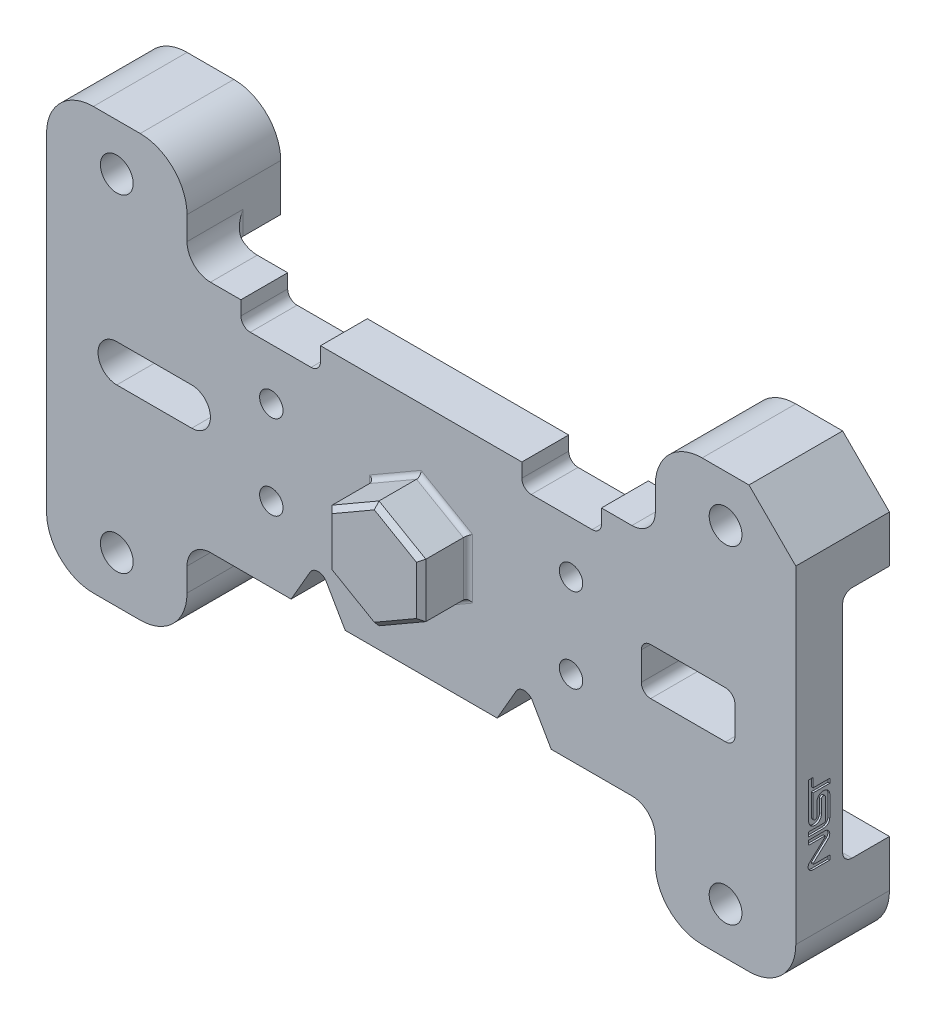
ISO-10303-21;
HEADER;
FILE_DESCRIPTION(('STEP AP214'),'2;1');
FILE_NAME('part.step','',(''),(''),'','','');
FILE_SCHEMA(('AUTOMOTIVE_DESIGN { 1 0 10303 214 1 1 1 1 }'));
ENDSEC;
DATA;
#1=APPLICATION_CONTEXT('core data for automotive mechanical design processes');
#2=APPLICATION_PROTOCOL_DEFINITION('international standard','automotive_design',2000,#1);
#3=PRODUCT_CONTEXT('',#1,'mechanical');
#4=PRODUCT('Part','Part','',(#3));
#5=PRODUCT_RELATED_PRODUCT_CATEGORY('part','',(#4));
#6=PRODUCT_DEFINITION_FORMATION('','',#4);
#7=PRODUCT_DEFINITION_CONTEXT('part definition',#1,'design');
#8=PRODUCT_DEFINITION('design','',#6,#7);
#9=PRODUCT_DEFINITION_SHAPE('','',#8);
#10=(LENGTH_UNIT() NAMED_UNIT(*) SI_UNIT(.MILLI.,.METRE.));
#11=(NAMED_UNIT(*) PLANE_ANGLE_UNIT() SI_UNIT($,.RADIAN.));
#12=(NAMED_UNIT(*) SI_UNIT($,.STERADIAN.) SOLID_ANGLE_UNIT());
#13=UNCERTAINTY_MEASURE_WITH_UNIT(LENGTH_MEASURE(1.E-05),#10,'distance_accuracy_value','');
#14=(GEOMETRIC_REPRESENTATION_CONTEXT(3) GLOBAL_UNCERTAINTY_ASSIGNED_CONTEXT((#13)) GLOBAL_UNIT_ASSIGNED_CONTEXT((#10,
#11,#12)) REPRESENTATION_CONTEXT('',''));
#15=CARTESIAN_POINT('',(0.,0.,0.));
#16=DIRECTION('',(0.,0.,1.));
#17=DIRECTION('',(1.,0.,0.));
#18=AXIS2_PLACEMENT_3D('',#15,#16,#17);
#19=CARTESIAN_POINT('',(-225.,-150.,-100.));
#20=DIRECTION('',(0.,0.,1.));
#21=DIRECTION('',(1.,0.,0.));
#22=AXIS2_PLACEMENT_3D('',#19,#20,#21);
#23=CYLINDRICAL_SURFACE('',#22,25.);
#24=DIRECTION('',(0.,0.,1.));
#25=VECTOR('',#24,1.);
#26=CARTESIAN_POINT('',(-250.,-150.,-100.));
#27=LINE('',#26,#25);
#28=CARTESIAN_POINT('',(-250.,-150.,-60.));
#29=VERTEX_POINT('',#28);
#30=CARTESIAN_POINT('',(-250.,-150.,0.));
#31=VERTEX_POINT('',#30);
#32=EDGE_CURVE('E1449',#29,#31,#27,.T.);
#33=ORIENTED_EDGE('',*,*,#32,.F.);
#34=CARTESIAN_POINT('',(-240.,-130.,-50.));
#35=CARTESIAN_POINT('',(-240.17098801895,-130.128236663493,-50.0000023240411));
#36=CARTESIAN_POINT('',(-240.340290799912,-130.258644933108,-50.0043853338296));
#37=CARTESIAN_POINT('',(-240.675208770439,-130.52351746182,-50.0214122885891));
#38=CARTESIAN_POINT('',(-240.84082481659,-130.657980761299,-50.034054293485));
#39=CARTESIAN_POINT('',(-241.331171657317,-131.066601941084,-50.0835596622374));
#40=CARTESIAN_POINT('',(-241.650045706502,-131.346474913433,-50.1320061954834));
#41=CARTESIAN_POINT('',(-242.267294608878,-131.916431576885,-50.2553842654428));
#42=CARTESIAN_POINT('',(-242.565835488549,-132.206392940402,-50.3300597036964));
#43=CARTESIAN_POINT('',(-243.144989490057,-132.79736469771,-50.5026118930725));
#44=CARTESIAN_POINT('',(-243.42559198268,-133.098381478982,-50.6005022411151));
#45=CARTESIAN_POINT('',(-244.083382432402,-133.839452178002,-50.8622194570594));
#46=CARTESIAN_POINT('',(-244.451052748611,-134.284322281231,-51.0364021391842));
#47=CARTESIAN_POINT('',(-245.148545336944,-135.189101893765,-51.4180081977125));
#48=CARTESIAN_POINT('',(-245.478358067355,-135.649015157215,-51.625439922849));
#49=CARTESIAN_POINT('',(-246.102473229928,-136.583477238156,-52.0685994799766));
#50=CARTESIAN_POINT('',(-246.396561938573,-137.058094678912,-52.3044822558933));
#51=CARTESIAN_POINT('',(-246.947939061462,-138.016933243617,-52.7983940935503));
#52=CARTESIAN_POINT('',(-247.205226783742,-138.50115454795,-53.0564235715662));
#53=CARTESIAN_POINT('',(-247.783384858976,-139.679687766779,-53.7010810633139));
#54=CARTESIAN_POINT('',(-248.086405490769,-140.377887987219,-54.0966810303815));
#55=CARTESIAN_POINT('',(-248.623917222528,-141.785471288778,-54.9140007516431));
#56=CARTESIAN_POINT('',(-248.85837457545,-142.494859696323,-55.3357332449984));
#57=CARTESIAN_POINT('',(-249.260623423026,-143.919779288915,-56.1965685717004));
#58=CARTESIAN_POINT('',(-249.428546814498,-144.635295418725,-56.63563512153));
#59=CARTESIAN_POINT('',(-249.700098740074,-146.070825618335,-57.5252793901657));
#60=CARTESIAN_POINT('',(-249.803761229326,-146.7908371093,-57.9758508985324));
#61=CARTESIAN_POINT('',(-249.916875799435,-147.921801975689,-58.6871144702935));
#62=CARTESIAN_POINT('',(-249.947679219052,-148.332007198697,-58.9458171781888));
#63=CARTESIAN_POINT('',(-249.989007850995,-149.152583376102,-59.4640542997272));
#64=CARTESIAN_POINT('',(-249.999547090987,-149.562954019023,-59.7235880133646));
#65=CARTESIAN_POINT('',(-249.999995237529,-149.982182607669,-59.9887312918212));
#66=CARTESIAN_POINT('',(-249.999999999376,-149.991091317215,-59.9943656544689));
#67=CARTESIAN_POINT('',(-250.,-150.,-60.));
#68=B_SPLINE_CURVE_WITH_KNOTS('',3,(#34,#35,#36,#37,#38,#39,#40,#41,#42,#43,#44,#45,#46,#47,#48,
#49,#50,#51,#52,#53,#54,#55,#56,#57,#58,#59,#60,#61,#62,#63,#64,#65,#66,#67),.UNSPECIFIED.,.F.,
.F.,(4,2,2,2,2,2,2,2,2,2,2,2,2,2,2,2,4),(0.,0.64105607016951,1.28196160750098,2.56136388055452,
3.8286062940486,5.09659276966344,6.90242325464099,8.70870789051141,10.5253159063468,
12.3419580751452,14.9115990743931,17.4825027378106,20.0482840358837,22.6127084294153,
24.0702047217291,25.5266917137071,25.5583144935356),.UNSPECIFIED.);
#69=CARTESIAN_POINT('',(-240.,-130.,-50.));
#70=VERTEX_POINT('',#69);
#71=EDGE_CURVE('E1586',#29,#70,#68,.F.);
#72=ORIENTED_EDGE('',*,*,#71,.T.);
#73=CARTESIAN_POINT('',(-225.,-150.,-50.));
#74=DIRECTION('',(0.,0.,-1.));
#75=DIRECTION('',(-1.,0.,0.));
#76=AXIS2_PLACEMENT_3D('',#73,#74,#75);
#77=CIRCLE('',#76,25.);
#78=CARTESIAN_POINT('',(-225.,-125.,-50.));
#79=VERTEX_POINT('',#78);
#80=EDGE_CURVE('E1126',#70,#79,#77,.T.);
#81=ORIENTED_EDGE('',*,*,#80,.T.);
#82=DIRECTION('',(0.,0.,1.));
#83=VECTOR('',#82,1.);
#84=CARTESIAN_POINT('',(-225.,-125.,-100.));
#85=LINE('',#84,#83);
#86=CARTESIAN_POINT('',(-225.,-125.,0.));
#87=VERTEX_POINT('',#86);
#88=EDGE_CURVE('E1318',#79,#87,#85,.T.);
#89=ORIENTED_EDGE('',*,*,#88,.T.);
#90=CARTESIAN_POINT('',(-225.,-150.,0.));
#91=DIRECTION('',(0.,0.,-1.));
#92=DIRECTION('',(-1.,0.,0.));
#93=AXIS2_PLACEMENT_3D('',#90,#91,#92);
#94=CIRCLE('',#93,25.);
#95=EDGE_CURVE('E1255',#31,#87,#94,.T.);
#96=ORIENTED_EDGE('',*,*,#95,.F.);
#97=EDGE_LOOP('',(#33,#72,#81,#89,#96));
#98=FACE_BOUND('',#97,.T.);
#99=ADVANCED_FACE('F32',(#98),#23,.F.);
#100=CARTESIAN_POINT('',(-225.,150.,-100.));
#101=DIRECTION('',(0.,0.,1.));
#102=DIRECTION('',(1.,0.,0.));
#103=AXIS2_PLACEMENT_3D('',#100,#101,#102);
#104=CYLINDRICAL_SURFACE('',#103,25.);
#105=DIRECTION('',(0.,0.,1.));
#106=VECTOR('',#105,1.);
#107=CARTESIAN_POINT('',(-225.,125.,-100.));
#108=LINE('',#107,#106);
#109=CARTESIAN_POINT('',(-225.,125.,-50.));
#110=VERTEX_POINT('',#109);
#111=CARTESIAN_POINT('',(-225.,125.,0.));
#112=VERTEX_POINT('',#111);
#113=EDGE_CURVE('E1470',#110,#112,#108,.T.);
#114=ORIENTED_EDGE('',*,*,#113,.F.);
#115=CARTESIAN_POINT('',(-225.,150.,-50.));
#116=DIRECTION('',(0.,0.,-1.));
#117=DIRECTION('',(-1.,0.,0.));
#118=AXIS2_PLACEMENT_3D('',#115,#116,#117);
#119=CIRCLE('',#118,25.);
#120=CARTESIAN_POINT('',(-240.,130.,-50.));
#121=VERTEX_POINT('',#120);
#122=EDGE_CURVE('E1172',#110,#121,#119,.T.);
#123=ORIENTED_EDGE('',*,*,#122,.T.);
#124=CARTESIAN_POINT('',(-240.,130.,-50.));
#125=CARTESIAN_POINT('',(-240.170988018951,130.128236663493,-50.0000023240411));
#126=CARTESIAN_POINT('',(-240.340290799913,130.258644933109,-50.0043853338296));
#127=CARTESIAN_POINT('',(-240.675208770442,130.523517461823,-50.0214122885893));
#128=CARTESIAN_POINT('',(-240.840824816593,130.657980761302,-50.0340542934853));
#129=CARTESIAN_POINT('',(-241.331171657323,131.066601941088,-50.0835596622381));
#130=CARTESIAN_POINT('',(-241.650045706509,131.346474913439,-50.1320061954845));
#131=CARTESIAN_POINT('',(-242.267294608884,131.916431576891,-50.2553842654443));
#132=CARTESIAN_POINT('',(-242.565835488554,132.206392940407,-50.3300597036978));
#133=CARTESIAN_POINT('',(-243.144989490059,132.797364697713,-50.5026118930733));
#134=CARTESIAN_POINT('',(-243.425591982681,133.098381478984,-50.6005022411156));
#135=CARTESIAN_POINT('',(-244.083382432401,133.839452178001,-50.8622194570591));
#136=CARTESIAN_POINT('',(-244.451052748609,134.284322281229,-51.0364021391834));
#137=CARTESIAN_POINT('',(-245.14854533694,135.189101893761,-51.4180081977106));
#138=CARTESIAN_POINT('',(-245.478358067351,135.64901515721,-51.6254399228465));
#139=CARTESIAN_POINT('',(-246.102473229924,136.58347723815,-52.0685994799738));
#140=CARTESIAN_POINT('',(-246.39656193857,137.058094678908,-52.3044822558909));
#141=CARTESIAN_POINT('',(-246.947939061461,138.016933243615,-52.798394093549));
#142=CARTESIAN_POINT('',(-247.205226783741,138.501154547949,-53.0564235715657));
#143=CARTESIAN_POINT('',(-247.783384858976,139.67968776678,-53.7010810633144));
#144=CARTESIAN_POINT('',(-248.08640549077,140.377887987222,-54.0966810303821));
#145=CARTESIAN_POINT('',(-248.62391722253,141.785471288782,-54.914000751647));
#146=CARTESIAN_POINT('',(-248.858374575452,142.494859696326,-55.3357332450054));
#147=CARTESIAN_POINT('',(-249.260623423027,143.919779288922,-56.1965685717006));
#148=CARTESIAN_POINT('',(-249.428546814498,144.635295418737,-56.6356351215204));
#149=CARTESIAN_POINT('',(-249.700098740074,146.070825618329,-57.5252793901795));
#150=CARTESIAN_POINT('',(-249.803761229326,146.790837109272,-57.9758508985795));
#151=CARTESIAN_POINT('',(-249.916875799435,147.921801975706,-58.6871144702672));
#152=CARTESIAN_POINT('',(-249.947679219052,148.332007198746,-58.9458171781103));
#153=CARTESIAN_POINT('',(-249.989007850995,149.152583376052,-59.4640542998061));
#154=CARTESIAN_POINT('',(-249.999547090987,149.56295401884,-59.723588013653));
#155=CARTESIAN_POINT('',(-249.999995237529,149.982182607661,-59.9887312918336));
#156=CARTESIAN_POINT('',(-249.999999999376,149.991091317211,-59.9943656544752));
#157=CARTESIAN_POINT('',(-250.,150.,-60.));
#158=B_SPLINE_CURVE_WITH_KNOTS('',3,(#124,#125,#126,#127,#128,#129,#130,#131,#132,#133,#134,
#135,#136,#137,#138,#139,#140,#141,#142,#143,#144,#145,#146,#147,#148,#149,#150,#151,#152,#153,
#154,#155,#156,#157),.UNSPECIFIED.,.F.,.F.,(4,2,2,2,2,2,2,2,2,2,2,2,2,2,2,2,4),(0.,
0.641056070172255,1.28196160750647,2.56136388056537,3.82860629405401,5.09659276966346,
6.9024232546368,8.70870789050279,10.5253159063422,12.3419580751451,14.9115990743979,
17.4825027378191,20.0482840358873,22.612708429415,24.0702047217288,25.5266917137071,
25.5583144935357),.UNSPECIFIED.);
#159=CARTESIAN_POINT('',(-250.,150.,-60.));
#160=VERTEX_POINT('',#159);
#161=EDGE_CURVE('E1898',#121,#160,#158,.T.);
#162=ORIENTED_EDGE('',*,*,#161,.T.);
#163=DIRECTION('',(0.,0.,1.));
#164=VECTOR('',#163,1.);
#165=CARTESIAN_POINT('',(-250.,150.,-100.));
#166=LINE('',#165,#164);
#167=CARTESIAN_POINT('',(-250.,150.,0.));
#168=VERTEX_POINT('',#167);
#169=EDGE_CURVE('E1468',#160,#168,#166,.T.);
#170=ORIENTED_EDGE('',*,*,#169,.T.);
#171=CARTESIAN_POINT('',(-225.,150.,0.));
#172=DIRECTION('',(0.,0.,-1.));
#173=DIRECTION('',(-1.,0.,0.));
#174=AXIS2_PLACEMENT_3D('',#171,#172,#173);
#175=CIRCLE('',#174,25.);
#176=EDGE_CURVE('E1420',#112,#168,#175,.T.);
#177=ORIENTED_EDGE('',*,*,#176,.F.);
#178=EDGE_LOOP('',(#114,#123,#162,#170,#177));
#179=FACE_BOUND('',#178,.T.);
#180=ADVANCED_FACE('F1643',(#179),#104,.F.);
#181=CARTESIAN_POINT('',(-225.,125.,-100.));
#182=DIRECTION('',(0.,1.,0.));
#183=DIRECTION('',(0.,0.,1.));
#184=AXIS2_PLACEMENT_3D('',#181,#182,#183);
#185=PLANE('',#184);
#186=DIRECTION('',(0.,0.,1.));
#187=VECTOR('',#186,1.);
#188=CARTESIAN_POINT('',(-192.5,125.,-100.));
#189=LINE('',#188,#187);
#190=CARTESIAN_POINT('',(-192.5,125.,-50.));
#191=VERTEX_POINT('',#190);
#192=CARTESIAN_POINT('',(-192.5,125.,0.));
#193=VERTEX_POINT('',#192);
#194=EDGE_CURVE('E1472',#191,#193,#189,.T.);
#195=ORIENTED_EDGE('',*,*,#194,.F.);
#196=DIRECTION('',(-1.,0.,0.));
#197=VECTOR('',#196,1.);
#198=CARTESIAN_POINT('',(-225.,125.,-50.));
#199=LINE('',#198,#197);
#200=EDGE_CURVE('E1169',#191,#110,#199,.T.);
#201=ORIENTED_EDGE('',*,*,#200,.T.);
#202=ORIENTED_EDGE('',*,*,#113,.T.);
#203=DIRECTION('',(-1.,0.,0.));
#204=VECTOR('',#203,1.);
#205=CARTESIAN_POINT('',(-225.,125.,0.));
#206=LINE('',#205,#204);
#207=EDGE_CURVE('E1417',#193,#112,#206,.T.);
#208=ORIENTED_EDGE('',*,*,#207,.F.);
#209=EDGE_LOOP('',(#195,#201,#202,#208));
#210=FACE_BOUND('',#209,.T.);
#211=ADVANCED_FACE('F1909',(#210),#185,.T.);
#212=CARTESIAN_POINT('',(-192.5,125.,-100.));
#213=DIRECTION('',(1.,0.,0.));
#214=DIRECTION('',(0.,0.,-1.));
#215=AXIS2_PLACEMENT_3D('',#212,#213,#214);
#216=PLANE('',#215);
#217=DIRECTION('',(0.,0.,1.));
#218=VECTOR('',#217,1.);
#219=CARTESIAN_POINT('',(-192.5,110.,-100.));
#220=LINE('',#219,#218);
#221=CARTESIAN_POINT('',(-192.5,110.,-50.));
#222=VERTEX_POINT('',#221);
#223=CARTESIAN_POINT('',(-192.5,110.,0.));
#224=VERTEX_POINT('',#223);
#225=EDGE_CURVE('E1474',#222,#224,#220,.T.);
#226=ORIENTED_EDGE('',*,*,#225,.F.);
#227=DIRECTION('',(0.,1.,0.));
#228=VECTOR('',#227,1.);
#229=CARTESIAN_POINT('',(-192.5,125.,-50.));
#230=LINE('',#229,#228);
#231=EDGE_CURVE('E1166',#222,#191,#230,.T.);
#232=ORIENTED_EDGE('',*,*,#231,.T.);
#233=ORIENTED_EDGE('',*,*,#194,.T.);
#234=DIRECTION('',(0.,1.,0.));
#235=VECTOR('',#234,1.);
#236=CARTESIAN_POINT('',(-192.5,125.,0.));
#237=LINE('',#236,#235);
#238=EDGE_CURVE('E1414',#224,#193,#237,.T.);
#239=ORIENTED_EDGE('',*,*,#238,.F.);
#240=EDGE_LOOP('',(#226,#232,#233,#239));
#241=FACE_BOUND('',#240,.T.);
#242=ADVANCED_FACE('F1915',(#241),#216,.T.);
#243=CARTESIAN_POINT('',(-182.5,110.,-100.));
#244=DIRECTION('',(0.,0.,1.));
#245=DIRECTION('',(1.,0.,0.));
#246=AXIS2_PLACEMENT_3D('',#243,#244,#245);
#247=CYLINDRICAL_SURFACE('',#246,10.);
#248=DIRECTION('',(0.,0.,1.));
#249=VECTOR('',#248,1.);
#250=CARTESIAN_POINT('',(-182.5,100.,-100.));
#251=LINE('',#250,#249);
#252=CARTESIAN_POINT('',(-182.5,100.,-50.));
#253=VERTEX_POINT('',#252);
#254=CARTESIAN_POINT('',(-182.5,100.,0.));
#255=VERTEX_POINT('',#254);
#256=EDGE_CURVE('E1476',#253,#255,#251,.T.);
#257=ORIENTED_EDGE('',*,*,#256,.F.);
#258=CARTESIAN_POINT('',(-182.5,110.,-50.));
#259=DIRECTION('',(0.,0.,-1.));
#260=DIRECTION('',(-1.,0.,0.));
#261=AXIS2_PLACEMENT_3D('',#258,#259,#260);
#262=CIRCLE('',#261,10.);
#263=EDGE_CURVE('E1163',#253,#222,#262,.T.);
#264=ORIENTED_EDGE('',*,*,#263,.T.);
#265=ORIENTED_EDGE('',*,*,#225,.T.);
#266=CARTESIAN_POINT('',(-182.5,110.,0.));
#267=DIRECTION('',(0.,0.,-1.));
#268=DIRECTION('',(-1.,0.,0.));
#269=AXIS2_PLACEMENT_3D('',#266,#267,#268);
#270=CIRCLE('',#269,10.);
#271=EDGE_CURVE('E1411',#255,#224,#270,.T.);
#272=ORIENTED_EDGE('',*,*,#271,.F.);
#273=EDGE_LOOP('',(#257,#264,#265,#272));
#274=FACE_BOUND('',#273,.T.);
#275=ADVANCED_FACE('F1919',(#274),#247,.F.);
#276=CARTESIAN_POINT('',(-182.5,100.,-100.));
#277=DIRECTION('',(0.,1.,0.));
#278=DIRECTION('',(0.,0.,1.));
#279=AXIS2_PLACEMENT_3D('',#276,#277,#278);
#280=PLANE('',#279);
#281=DIRECTION('',(0.,0.,1.));
#282=VECTOR('',#281,1.);
#283=CARTESIAN_POINT('',(-117.5,100.,-100.));
#284=LINE('',#283,#282);
#285=CARTESIAN_POINT('',(-117.5,100.,-50.));
#286=VERTEX_POINT('',#285);
#287=CARTESIAN_POINT('',(-117.5,100.,0.));
#288=VERTEX_POINT('',#287);
#289=EDGE_CURVE('E1478',#286,#288,#284,.T.);
#290=ORIENTED_EDGE('',*,*,#289,.F.);
#291=DIRECTION('',(-1.,0.,0.));
#292=VECTOR('',#291,1.);
#293=CARTESIAN_POINT('',(-182.5,100.,-50.));
#294=LINE('',#293,#292);
#295=EDGE_CURVE('E1160',#286,#253,#294,.T.);
#296=ORIENTED_EDGE('',*,*,#295,.T.);
#297=ORIENTED_EDGE('',*,*,#256,.T.);
#298=DIRECTION('',(-1.,0.,0.));
#299=VECTOR('',#298,1.);
#300=CARTESIAN_POINT('',(-182.5,100.,0.));
#301=LINE('',#300,#299);
#302=EDGE_CURVE('E1408',#288,#255,#301,.T.);
#303=ORIENTED_EDGE('',*,*,#302,.F.);
#304=EDGE_LOOP('',(#290,#296,#297,#303));
#305=FACE_BOUND('',#304,.T.);
#306=ADVANCED_FACE('F1923',(#305),#280,.T.);
#307=CARTESIAN_POINT('',(-117.5,110.,-100.));
#308=DIRECTION('',(0.,0.,1.));
#309=DIRECTION('',(1.,0.,0.));
#310=AXIS2_PLACEMENT_3D('',#307,#308,#309);
#311=CYLINDRICAL_SURFACE('',#310,9.99999999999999);
#312=DIRECTION('',(0.,0.,1.));
#313=VECTOR('',#312,1.);
#314=CARTESIAN_POINT('',(-107.5,110.,-100.));
#315=LINE('',#314,#313);
#316=CARTESIAN_POINT('',(-107.5,110.,-50.));
#317=VERTEX_POINT('',#316);
#318=CARTESIAN_POINT('',(-107.5,110.,0.));
#319=VERTEX_POINT('',#318);
#320=EDGE_CURVE('E1480',#317,#319,#315,.T.);
#321=ORIENTED_EDGE('',*,*,#320,.F.);
#322=CARTESIAN_POINT('',(-117.5,110.,-50.));
#323=DIRECTION('',(0.,0.,-1.));
#324=DIRECTION('',(-1.,0.,0.));
#325=AXIS2_PLACEMENT_3D('',#322,#323,#324);
#326=CIRCLE('',#325,9.99999999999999);
#327=EDGE_CURVE('E1157',#317,#286,#326,.T.);
#328=ORIENTED_EDGE('',*,*,#327,.T.);
#329=ORIENTED_EDGE('',*,*,#289,.T.);
#330=CARTESIAN_POINT('',(-117.5,110.,0.));
#331=DIRECTION('',(0.,0.,-1.));
#332=DIRECTION('',(-1.,0.,0.));
#333=AXIS2_PLACEMENT_3D('',#330,#331,#332);
#334=CIRCLE('',#333,9.99999999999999);
#335=EDGE_CURVE('E1405',#319,#288,#334,.T.);
#336=ORIENTED_EDGE('',*,*,#335,.F.);
#337=EDGE_LOOP('',(#321,#328,#329,#336));
#338=FACE_BOUND('',#337,.T.);
#339=ADVANCED_FACE('F1927',(#338),#311,.F.);
#340=CARTESIAN_POINT('',(-107.5,125.,-100.));
#341=DIRECTION('',(-1.,0.,0.));
#342=DIRECTION('',(0.,0.,1.));
#343=AXIS2_PLACEMENT_3D('',#340,#341,#342);
#344=PLANE('',#343);
#345=DIRECTION('',(0.,0.,1.));
#346=VECTOR('',#345,1.);
#347=CARTESIAN_POINT('',(-107.5,125.,-100.));
#348=LINE('',#347,#346);
#349=CARTESIAN_POINT('',(-107.5,125.,-50.));
#350=VERTEX_POINT('',#349);
#351=CARTESIAN_POINT('',(-107.5,125.,0.));
#352=VERTEX_POINT('',#351);
#353=EDGE_CURVE('E1482',#350,#352,#348,.T.);
#354=ORIENTED_EDGE('',*,*,#353,.F.);
#355=DIRECTION('',(0.,-1.,0.));
#356=VECTOR('',#355,1.);
#357=CARTESIAN_POINT('',(-107.5,125.,-50.));
#358=LINE('',#357,#356);
#359=EDGE_CURVE('E1154',#350,#317,#358,.T.);
#360=ORIENTED_EDGE('',*,*,#359,.T.);
#361=ORIENTED_EDGE('',*,*,#320,.T.);
#362=DIRECTION('',(0.,-1.,0.));
#363=VECTOR('',#362,1.);
#364=CARTESIAN_POINT('',(-107.5,125.,0.));
#365=LINE('',#364,#363);
#366=EDGE_CURVE('E1402',#352,#319,#365,.T.);
#367=ORIENTED_EDGE('',*,*,#366,.F.);
#368=EDGE_LOOP('',(#354,#360,#361,#367));
#369=FACE_BOUND('',#368,.T.);
#370=ADVANCED_FACE('F1931',(#369),#344,.T.);
#371=CARTESIAN_POINT('',(-107.5,125.,-100.));
#372=DIRECTION('',(0.,1.,0.));
#373=DIRECTION('',(0.,0.,1.));
#374=AXIS2_PLACEMENT_3D('',#371,#372,#373);
#375=PLANE('',#374);
#376=DIRECTION('',(0.,0.,1.));
#377=VECTOR('',#376,1.);
#378=CARTESIAN_POINT('',(107.5,125.,-100.));
#379=LINE('',#378,#377);
#380=CARTESIAN_POINT('',(107.5,125.,-50.));
#381=VERTEX_POINT('',#380);
#382=CARTESIAN_POINT('',(107.5,125.,0.));
#383=VERTEX_POINT('',#382);
#384=EDGE_CURVE('E1484',#381,#383,#379,.T.);
#385=ORIENTED_EDGE('',*,*,#384,.F.);
#386=DIRECTION('',(-1.,0.,0.));
#387=VECTOR('',#386,1.);
#388=CARTESIAN_POINT('',(-107.5,125.,-50.));
#389=LINE('',#388,#387);
#390=EDGE_CURVE('E1151',#381,#350,#389,.T.);
#391=ORIENTED_EDGE('',*,*,#390,.T.);
#392=ORIENTED_EDGE('',*,*,#353,.T.);
#393=DIRECTION('',(-1.,0.,0.));
#394=VECTOR('',#393,1.);
#395=CARTESIAN_POINT('',(-107.5,125.,0.));
#396=LINE('',#395,#394);
#397=EDGE_CURVE('E1399',#383,#352,#396,.T.);
#398=ORIENTED_EDGE('',*,*,#397,.F.);
#399=EDGE_LOOP('',(#385,#391,#392,#398));
#400=FACE_BOUND('',#399,.T.);
#401=ADVANCED_FACE('F1935',(#400),#375,.T.);
#402=CARTESIAN_POINT('',(107.5,125.,-100.));
#403=DIRECTION('',(1.,0.,0.));
#404=DIRECTION('',(0.,0.,-1.));
#405=AXIS2_PLACEMENT_3D('',#402,#403,#404);
#406=PLANE('',#405);
#407=DIRECTION('',(0.,0.,1.));
#408=VECTOR('',#407,1.);
#409=CARTESIAN_POINT('',(107.5,110.,-100.));
#410=LINE('',#409,#408);
#411=CARTESIAN_POINT('',(107.5,110.,-50.));
#412=VERTEX_POINT('',#411);
#413=CARTESIAN_POINT('',(107.5,110.,0.));
#414=VERTEX_POINT('',#413);
#415=EDGE_CURVE('E1486',#412,#414,#410,.T.);
#416=ORIENTED_EDGE('',*,*,#415,.F.);
#417=DIRECTION('',(0.,1.,0.));
#418=VECTOR('',#417,1.);
#419=CARTESIAN_POINT('',(107.5,125.,-50.));
#420=LINE('',#419,#418);
#421=EDGE_CURVE('E1148',#412,#381,#420,.T.);
#422=ORIENTED_EDGE('',*,*,#421,.T.);
#423=ORIENTED_EDGE('',*,*,#384,.T.);
#424=DIRECTION('',(0.,1.,0.));
#425=VECTOR('',#424,1.);
#426=CARTESIAN_POINT('',(107.5,125.,0.));
#427=LINE('',#426,#425);
#428=EDGE_CURVE('E1396',#414,#383,#427,.T.);
#429=ORIENTED_EDGE('',*,*,#428,.F.);
#430=EDGE_LOOP('',(#416,#422,#423,#429));
#431=FACE_BOUND('',#430,.T.);
#432=ADVANCED_FACE('F1939',(#431),#406,.T.);
#433=CARTESIAN_POINT('',(117.5,110.,-100.));
#434=DIRECTION('',(0.,0.,1.));
#435=DIRECTION('',(1.,0.,0.));
#436=AXIS2_PLACEMENT_3D('',#433,#434,#435);
#437=CYLINDRICAL_SURFACE('',#436,9.99999999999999);
#438=DIRECTION('',(0.,0.,1.));
#439=VECTOR('',#438,1.);
#440=CARTESIAN_POINT('',(117.5,100.,-100.));
#441=LINE('',#440,#439);
#442=CARTESIAN_POINT('',(117.5,100.,-50.));
#443=VERTEX_POINT('',#442);
#444=CARTESIAN_POINT('',(117.5,100.,0.));
#445=VERTEX_POINT('',#444);
#446=EDGE_CURVE('E1488',#443,#445,#441,.T.);
#447=ORIENTED_EDGE('',*,*,#446,.F.);
#448=CARTESIAN_POINT('',(117.5,110.,-50.));
#449=DIRECTION('',(0.,0.,-1.));
#450=DIRECTION('',(-1.,0.,0.));
#451=AXIS2_PLACEMENT_3D('',#448,#449,#450);
#452=CIRCLE('',#451,9.99999999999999);
#453=EDGE_CURVE('E1145',#443,#412,#452,.T.);
#454=ORIENTED_EDGE('',*,*,#453,.T.);
#455=ORIENTED_EDGE('',*,*,#415,.T.);
#456=CARTESIAN_POINT('',(117.5,110.,0.));
#457=DIRECTION('',(0.,0.,-1.));
#458=DIRECTION('',(-1.,0.,0.));
#459=AXIS2_PLACEMENT_3D('',#456,#457,#458);
#460=CIRCLE('',#459,9.99999999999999);
#461=EDGE_CURVE('E1393',#445,#414,#460,.T.);
#462=ORIENTED_EDGE('',*,*,#461,.F.);
#463=EDGE_LOOP('',(#447,#454,#455,#462));
#464=FACE_BOUND('',#463,.T.);
#465=ADVANCED_FACE('F1943',(#464),#437,.F.);
#466=CARTESIAN_POINT('',(117.5,100.,-100.));
#467=DIRECTION('',(0.,1.,0.));
#468=DIRECTION('',(0.,0.,1.));
#469=AXIS2_PLACEMENT_3D('',#466,#467,#468);
#470=PLANE('',#469);
#471=DIRECTION('',(0.,0.,1.));
#472=VECTOR('',#471,1.);
#473=CARTESIAN_POINT('',(182.5,100.,-100.));
#474=LINE('',#473,#472);
#475=CARTESIAN_POINT('',(182.5,100.,-50.));
#476=VERTEX_POINT('',#475);
#477=CARTESIAN_POINT('',(182.5,100.,0.));
#478=VERTEX_POINT('',#477);
#479=EDGE_CURVE('E1490',#476,#478,#474,.T.);
#480=ORIENTED_EDGE('',*,*,#479,.F.);
#481=DIRECTION('',(-1.,0.,0.));
#482=VECTOR('',#481,1.);
#483=CARTESIAN_POINT('',(117.5,100.,-50.));
#484=LINE('',#483,#482);
#485=EDGE_CURVE('E1142',#476,#443,#484,.T.);
#486=ORIENTED_EDGE('',*,*,#485,.T.);
#487=ORIENTED_EDGE('',*,*,#446,.T.);
#488=DIRECTION('',(-1.,0.,0.));
#489=VECTOR('',#488,1.);
#490=CARTESIAN_POINT('',(117.5,100.,0.));
#491=LINE('',#490,#489);
#492=EDGE_CURVE('E1390',#478,#445,#491,.T.);
#493=ORIENTED_EDGE('',*,*,#492,.F.);
#494=EDGE_LOOP('',(#480,#486,#487,#493));
#495=FACE_BOUND('',#494,.T.);
#496=ADVANCED_FACE('F1947',(#495),#470,.T.);
#497=CARTESIAN_POINT('',(182.5,110.,-100.));
#498=DIRECTION('',(0.,0.,1.));
#499=DIRECTION('',(1.,0.,0.));
#500=AXIS2_PLACEMENT_3D('',#497,#498,#499);
#501=CYLINDRICAL_SURFACE('',#500,9.99999999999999);
#502=DIRECTION('',(0.,0.,1.));
#503=VECTOR('',#502,1.);
#504=CARTESIAN_POINT('',(192.5,110.,-100.));
#505=LINE('',#504,#503);
#506=CARTESIAN_POINT('',(192.5,110.,-50.));
#507=VERTEX_POINT('',#506);
#508=CARTESIAN_POINT('',(192.5,110.,0.));
#509=VERTEX_POINT('',#508);
#510=EDGE_CURVE('E1492',#507,#509,#505,.T.);
#511=ORIENTED_EDGE('',*,*,#510,.F.);
#512=CARTESIAN_POINT('',(182.5,110.,-50.));
#513=DIRECTION('',(0.,0.,-1.));
#514=DIRECTION('',(-1.,0.,0.));
#515=AXIS2_PLACEMENT_3D('',#512,#513,#514);
#516=CIRCLE('',#515,9.99999999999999);
#517=EDGE_CURVE('E1139',#507,#476,#516,.T.);
#518=ORIENTED_EDGE('',*,*,#517,.T.);
#519=ORIENTED_EDGE('',*,*,#479,.T.);
#520=CARTESIAN_POINT('',(182.5,110.,0.));
#521=DIRECTION('',(0.,0.,-1.));
#522=DIRECTION('',(-1.,0.,0.));
#523=AXIS2_PLACEMENT_3D('',#520,#521,#522);
#524=CIRCLE('',#523,9.99999999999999);
#525=EDGE_CURVE('E1387',#509,#478,#524,.T.);
#526=ORIENTED_EDGE('',*,*,#525,.F.);
#527=EDGE_LOOP('',(#511,#518,#519,#526));
#528=FACE_BOUND('',#527,.T.);
#529=ADVANCED_FACE('F1951',(#528),#501,.F.);
#530=CARTESIAN_POINT('',(192.5,125.,-100.));
#531=DIRECTION('',(-1.,0.,0.));
#532=DIRECTION('',(0.,-1.,0.));
#533=AXIS2_PLACEMENT_3D('',#530,#531,#532);
#534=PLANE('',#533);
#535=DIRECTION('',(0.,0.,1.));
#536=VECTOR('',#535,1.);
#537=CARTESIAN_POINT('',(192.5,125.,-100.));
#538=LINE('',#537,#536);
#539=CARTESIAN_POINT('',(192.5,125.,-50.));
#540=VERTEX_POINT('',#539);
#541=CARTESIAN_POINT('',(192.5,125.,0.));
#542=VERTEX_POINT('',#541);
#543=EDGE_CURVE('E1494',#540,#542,#538,.T.);
#544=ORIENTED_EDGE('',*,*,#543,.F.);
#545=DIRECTION('',(0.,-1.,0.));
#546=VECTOR('',#545,1.);
#547=CARTESIAN_POINT('',(192.5,125.,-50.));
#548=LINE('',#547,#546);
#549=EDGE_CURVE('E1136',#540,#507,#548,.T.);
#550=ORIENTED_EDGE('',*,*,#549,.T.);
#551=ORIENTED_EDGE('',*,*,#510,.T.);
#552=DIRECTION('',(0.,-1.,0.));
#553=VECTOR('',#552,1.);
#554=CARTESIAN_POINT('',(192.5,125.,0.));
#555=LINE('',#554,#553);
#556=EDGE_CURVE('E1384',#542,#509,#555,.T.);
#557=ORIENTED_EDGE('',*,*,#556,.F.);
#558=EDGE_LOOP('',(#544,#550,#551,#557));
#559=FACE_BOUND('',#558,.T.);
#560=ADVANCED_FACE('F1955',(#559),#534,.T.);
#561=CARTESIAN_POINT('',(192.5,125.,-100.));
#562=DIRECTION('',(0.,1.,0.));
#563=DIRECTION('',(0.,0.,1.));
#564=AXIS2_PLACEMENT_3D('',#561,#562,#563);
#565=PLANE('',#564);
#566=DIRECTION('',(0.,0.,1.));
#567=VECTOR('',#566,1.);
#568=CARTESIAN_POINT('',(225.,125.,-100.));
#569=LINE('',#568,#567);
#570=CARTESIAN_POINT('',(225.,125.,-50.));
#571=VERTEX_POINT('',#570);
#572=CARTESIAN_POINT('',(225.,125.,0.));
#573=VERTEX_POINT('',#572);
#574=EDGE_CURVE('E1496',#571,#573,#569,.T.);
#575=ORIENTED_EDGE('',*,*,#574,.F.);
#576=DIRECTION('',(-1.,0.,0.));
#577=VECTOR('',#576,1.);
#578=CARTESIAN_POINT('',(192.5,125.,-50.));
#579=LINE('',#578,#577);
#580=EDGE_CURVE('E1133',#571,#540,#579,.T.);
#581=ORIENTED_EDGE('',*,*,#580,.T.);
#582=ORIENTED_EDGE('',*,*,#543,.T.);
#583=DIRECTION('',(-1.,0.,0.));
#584=VECTOR('',#583,1.);
#585=CARTESIAN_POINT('',(192.5,125.,0.));
#586=LINE('',#585,#584);
#587=EDGE_CURVE('E1381',#573,#542,#586,.T.);
#588=ORIENTED_EDGE('',*,*,#587,.F.);
#589=EDGE_LOOP('',(#575,#581,#582,#588));
#590=FACE_BOUND('',#589,.T.);
#591=ADVANCED_FACE('F1959',(#590),#565,.T.);
#592=CARTESIAN_POINT('',(225.,150.,-100.));
#593=DIRECTION('',(0.,0.,1.));
#594=DIRECTION('',(1.,0.,0.));
#595=AXIS2_PLACEMENT_3D('',#592,#593,#594);
#596=CYLINDRICAL_SURFACE('',#595,25.);
#597=DIRECTION('',(0.,0.,1.));
#598=VECTOR('',#597,1.);
#599=CARTESIAN_POINT('',(250.,150.,-100.));
#600=LINE('',#599,#598);
#601=CARTESIAN_POINT('',(250.,150.,-60.));
#602=VERTEX_POINT('',#601);
#603=CARTESIAN_POINT('',(250.,150.,0.));
#604=VERTEX_POINT('',#603);
#605=EDGE_CURVE('E1498',#602,#604,#600,.T.);
#606=ORIENTED_EDGE('',*,*,#605,.F.);
#607=CARTESIAN_POINT('',(240.,130.,-50.));
#608=CARTESIAN_POINT('',(240.170988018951,130.128236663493,-50.0000023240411));
#609=CARTESIAN_POINT('',(240.340290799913,130.258644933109,-50.0043853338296));
#610=CARTESIAN_POINT('',(240.675208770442,130.523517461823,-50.0214122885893));
#611=CARTESIAN_POINT('',(240.840824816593,130.657980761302,-50.0340542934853));
#612=CARTESIAN_POINT('',(241.331171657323,131.066601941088,-50.0835596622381));
#613=CARTESIAN_POINT('',(241.650045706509,131.346474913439,-50.1320061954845));
#614=CARTESIAN_POINT('',(242.267294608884,131.916431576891,-50.2553842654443));
#615=CARTESIAN_POINT('',(242.565835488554,132.206392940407,-50.3300597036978));
#616=CARTESIAN_POINT('',(243.144989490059,132.797364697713,-50.5026118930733));
#617=CARTESIAN_POINT('',(243.425591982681,133.098381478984,-50.6005022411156));
#618=CARTESIAN_POINT('',(244.083382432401,133.839452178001,-50.8622194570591));
#619=CARTESIAN_POINT('',(244.451052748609,134.284322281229,-51.0364021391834));
#620=CARTESIAN_POINT('',(245.14854533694,135.189101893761,-51.4180081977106));
#621=CARTESIAN_POINT('',(245.478358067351,135.64901515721,-51.6254399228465));
#622=CARTESIAN_POINT('',(246.102473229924,136.58347723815,-52.0685994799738));
#623=CARTESIAN_POINT('',(246.39656193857,137.058094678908,-52.3044822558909));
#624=CARTESIAN_POINT('',(246.947939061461,138.016933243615,-52.798394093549));
#625=CARTESIAN_POINT('',(247.205226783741,138.501154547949,-53.0564235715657));
#626=CARTESIAN_POINT('',(247.783384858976,139.67968776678,-53.7010810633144));
#627=CARTESIAN_POINT('',(248.08640549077,140.377887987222,-54.0966810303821));
#628=CARTESIAN_POINT('',(248.62391722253,141.785471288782,-54.914000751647));
#629=CARTESIAN_POINT('',(248.858374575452,142.494859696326,-55.3357332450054));
#630=CARTESIAN_POINT('',(249.260623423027,143.919779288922,-56.1965685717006));
#631=CARTESIAN_POINT('',(249.428546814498,144.635295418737,-56.6356351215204));
#632=CARTESIAN_POINT('',(249.700098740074,146.070825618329,-57.5252793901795));
#633=CARTESIAN_POINT('',(249.803761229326,146.790837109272,-57.9758508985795));
#634=CARTESIAN_POINT('',(249.916875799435,147.921801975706,-58.6871144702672));
#635=CARTESIAN_POINT('',(249.947679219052,148.332007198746,-58.9458171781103));
#636=CARTESIAN_POINT('',(249.989007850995,149.152583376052,-59.4640542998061));
#637=CARTESIAN_POINT('',(249.999547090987,149.56295401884,-59.723588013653));
#638=CARTESIAN_POINT('',(249.999995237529,149.982182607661,-59.9887312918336));
#639=CARTESIAN_POINT('',(249.999999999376,149.991091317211,-59.9943656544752));
#640=CARTESIAN_POINT('',(250.,150.,-60.));
#641=B_SPLINE_CURVE_WITH_KNOTS('',3,(#607,#608,#609,#610,#611,#612,#613,#614,#615,#616,#617,
#618,#619,#620,#621,#622,#623,#624,#625,#626,#627,#628,#629,#630,#631,#632,#633,#634,#635,#636,
#637,#638,#639,#640),.UNSPECIFIED.,.F.,.F.,(4,2,2,2,2,2,2,2,2,2,2,2,2,2,2,2,4),(0.,
0.641056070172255,1.28196160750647,2.56136388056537,3.82860629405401,5.09659276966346,
6.9024232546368,8.70870789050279,10.5253159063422,12.3419580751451,14.9115990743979,
17.4825027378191,20.0482840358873,22.612708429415,24.0702047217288,25.5266917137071,
25.5583144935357),.UNSPECIFIED.);
#642=CARTESIAN_POINT('',(240.,130.,-50.));
#643=VERTEX_POINT('',#642);
#644=EDGE_CURVE('E1680',#602,#643,#641,.F.);
#645=ORIENTED_EDGE('',*,*,#644,.T.);
#646=CARTESIAN_POINT('',(225.,150.,-50.));
#647=DIRECTION('',(0.,0.,-1.));
#648=DIRECTION('',(-1.,0.,0.));
#649=AXIS2_PLACEMENT_3D('',#646,#647,#648);
#650=CIRCLE('',#649,25.);
#651=EDGE_CURVE('E1131',#643,#571,#650,.T.);
#652=ORIENTED_EDGE('',*,*,#651,.T.);
#653=ORIENTED_EDGE('',*,*,#574,.T.);
#654=CARTESIAN_POINT('',(225.,150.,0.));
#655=DIRECTION('',(0.,0.,-1.));
#656=DIRECTION('',(-1.,0.,0.));
#657=AXIS2_PLACEMENT_3D('',#654,#655,#656);
#658=CIRCLE('',#657,25.);
#659=EDGE_CURVE('E1378',#604,#573,#658,.T.);
#660=ORIENTED_EDGE('',*,*,#659,.F.);
#661=EDGE_LOOP('',(#606,#645,#652,#653,#660));
#662=FACE_BOUND('',#661,.T.);
#663=ADVANCED_FACE('F1602',(#662),#596,.F.);
#664=CARTESIAN_POINT('',(225.,-150.,-100.));
#665=DIRECTION('',(0.,0.,1.));
#666=DIRECTION('',(1.,0.,0.));
#667=AXIS2_PLACEMENT_3D('',#664,#665,#666);
#668=CYLINDRICAL_SURFACE('',#667,25.);
#669=DIRECTION('',(0.,0.,1.));
#670=VECTOR('',#669,1.);
#671=CARTESIAN_POINT('',(225.,-125.,-100.));
#672=LINE('',#671,#670);
#673=CARTESIAN_POINT('',(225.,-125.,-50.));
#674=VERTEX_POINT('',#673);
#675=CARTESIAN_POINT('',(225.,-125.,0.));
#676=VERTEX_POINT('',#675);
#677=EDGE_CURVE('E1518',#674,#676,#672,.T.);
#678=ORIENTED_EDGE('',*,*,#677,.F.);
#679=CARTESIAN_POINT('',(225.,-150.,-50.));
#680=DIRECTION('',(0.,0.,-1.));
#681=DIRECTION('',(-1.,0.,0.));
#682=AXIS2_PLACEMENT_3D('',#679,#680,#681);
#683=CIRCLE('',#682,25.);
#684=CARTESIAN_POINT('',(240.,-130.,-50.));
#685=VERTEX_POINT('',#684);
#686=EDGE_CURVE('E1123',#674,#685,#683,.T.);
#687=ORIENTED_EDGE('',*,*,#686,.T.);
#688=CARTESIAN_POINT('',(240.,-130.,-50.));
#689=CARTESIAN_POINT('',(240.170988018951,-130.128236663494,-50.0000023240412));
#690=CARTESIAN_POINT('',(240.340290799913,-130.258644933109,-50.0043853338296));
#691=CARTESIAN_POINT('',(240.675208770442,-130.523517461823,-50.0214122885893));
#692=CARTESIAN_POINT('',(240.840824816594,-130.657980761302,-50.0340542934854));
#693=CARTESIAN_POINT('',(241.331171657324,-131.06660194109,-50.0835596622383));
#694=CARTESIAN_POINT('',(241.65004570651,-131.346474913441,-50.1320061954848));
#695=CARTESIAN_POINT('',(242.267294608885,-131.916431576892,-50.2553842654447));
#696=CARTESIAN_POINT('',(242.565835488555,-132.206392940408,-50.3300597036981));
#697=CARTESIAN_POINT('',(243.14498949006,-132.797364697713,-50.5026118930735));
#698=CARTESIAN_POINT('',(243.425591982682,-133.098381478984,-50.6005022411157));
#699=CARTESIAN_POINT('',(244.083382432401,-133.839452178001,-50.862219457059));
#700=CARTESIAN_POINT('',(244.451052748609,-134.284322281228,-51.0364021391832));
#701=CARTESIAN_POINT('',(245.14854533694,-135.18910189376,-51.4180081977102));
#702=CARTESIAN_POINT('',(245.47835806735,-135.649015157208,-51.6254399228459));
#703=CARTESIAN_POINT('',(246.102473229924,-136.583477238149,-52.0685994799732));
#704=CARTESIAN_POINT('',(246.39656193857,-137.058094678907,-52.3044822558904));
#705=CARTESIAN_POINT('',(246.947939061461,-138.016933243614,-52.7983940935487));
#706=CARTESIAN_POINT('',(247.205226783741,-138.501154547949,-53.0564235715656));
#707=CARTESIAN_POINT('',(247.783384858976,-139.67968776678,-53.7010810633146));
#708=CARTESIAN_POINT('',(248.08640549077,-140.377887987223,-54.0966810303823));
#709=CARTESIAN_POINT('',(248.623917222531,-141.785471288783,-54.9140007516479));
#710=CARTESIAN_POINT('',(248.858374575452,-142.494859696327,-55.3357332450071));
#711=CARTESIAN_POINT('',(249.260623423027,-143.919779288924,-56.1965685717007));
#712=CARTESIAN_POINT('',(249.428546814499,-144.63529541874,-56.6356351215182));
#713=CARTESIAN_POINT('',(249.700098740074,-146.070825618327,-57.5252793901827));
#714=CARTESIAN_POINT('',(249.803761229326,-146.790837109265,-57.9758508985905));
#715=CARTESIAN_POINT('',(249.916875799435,-147.921801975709,-58.6871144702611));
#716=CARTESIAN_POINT('',(249.947679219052,-148.332007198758,-58.945817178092));
#717=CARTESIAN_POINT('',(249.989007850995,-149.15258337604,-59.4640542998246));
#718=CARTESIAN_POINT('',(249.999547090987,-149.562954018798,-59.7235880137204));
#719=CARTESIAN_POINT('',(249.999995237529,-149.982182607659,-59.9887312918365));
#720=CARTESIAN_POINT('',(249.999999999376,-149.99109131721,-59.9943656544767));
#721=CARTESIAN_POINT('',(250.,-150.,-60.));
#722=B_SPLINE_CURVE_WITH_KNOTS('',3,(#688,#689,#690,#691,#692,#693,#694,#695,#696,#697,#698,
#699,#700,#701,#702,#703,#704,#705,#706,#707,#708,#709,#710,#711,#712,#713,#714,#715,#716,#717,
#718,#719,#720,#721),.UNSPECIFIED.,.F.,.F.,(4,2,2,2,2,2,2,2,2,2,2,2,2,2,2,2,4),(0.,
0.641056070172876,1.28196160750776,2.5613638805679,3.82860629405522,5.09659276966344,
6.9024232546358,8.70870789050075,10.5253159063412,12.3419580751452,14.9115990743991,
17.4825027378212,20.0482840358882,22.6127084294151,24.0702047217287,25.5266917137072,
25.5583144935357),.UNSPECIFIED.);
#723=CARTESIAN_POINT('',(250.,-150.,-60.));
#724=VERTEX_POINT('',#723);
#725=EDGE_CURVE('E1578',#685,#724,#722,.T.);
#726=ORIENTED_EDGE('',*,*,#725,.T.);
#727=DIRECTION('',(0.,0.,1.));
#728=VECTOR('',#727,1.);
#729=CARTESIAN_POINT('',(250.,-150.,-100.));
#730=LINE('',#729,#728);
#731=CARTESIAN_POINT('',(250.,-150.,0.));
#732=VERTEX_POINT('',#731);
#733=EDGE_CURVE('E1516',#724,#732,#730,.T.);
#734=ORIENTED_EDGE('',*,*,#733,.T.);
#735=CARTESIAN_POINT('',(225.,-150.,0.));
#736=DIRECTION('',(0.,0.,-1.));
#737=DIRECTION('',(-1.,0.,0.));
#738=AXIS2_PLACEMENT_3D('',#735,#736,#737);
#739=CIRCLE('',#738,25.);
#740=EDGE_CURVE('E1348',#676,#732,#739,.T.);
#741=ORIENTED_EDGE('',*,*,#740,.F.);
#742=EDGE_LOOP('',(#678,#687,#726,#734,#741));
#743=FACE_BOUND('',#742,.T.);
#744=ADVANCED_FACE('F1596',(#743),#668,.F.);
#745=CARTESIAN_POINT('',(138.867513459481,-125.,-100.));
#746=DIRECTION('',(0.,-1.,0.));
#747=DIRECTION('',(0.,0.,-1.));
#748=AXIS2_PLACEMENT_3D('',#745,#746,#747);
#749=PLANE('',#748);
#750=DIRECTION('',(0.,0.,1.));
#751=VECTOR('',#750,1.);
#752=CARTESIAN_POINT('',(138.867513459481,-125.,-100.));
#753=LINE('',#752,#751);
#754=CARTESIAN_POINT('',(138.867513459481,-125.,-50.));
#755=VERTEX_POINT('',#754);
#756=CARTESIAN_POINT('',(138.867513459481,-125.,0.));
#757=VERTEX_POINT('',#756);
#758=EDGE_CURVE('E1520',#755,#757,#753,.T.);
#759=ORIENTED_EDGE('',*,*,#758,.F.);
#760=DIRECTION('',(1.,0.,0.));
#761=VECTOR('',#760,1.);
#762=CARTESIAN_POINT('',(138.867513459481,-125.,-50.));
#763=LINE('',#762,#761);
#764=EDGE_CURVE('E1120',#755,#674,#763,.T.);
#765=ORIENTED_EDGE('',*,*,#764,.T.);
#766=ORIENTED_EDGE('',*,*,#677,.T.);
#767=DIRECTION('',(1.,0.,0.));
#768=VECTOR('',#767,1.);
#769=CARTESIAN_POINT('',(138.867513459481,-125.,0.));
#770=LINE('',#769,#768);
#771=EDGE_CURVE('E1345',#757,#676,#770,.T.);
#772=ORIENTED_EDGE('',*,*,#771,.F.);
#773=EDGE_LOOP('',(#759,#765,#766,#772));
#774=FACE_BOUND('',#773,.T.);
#775=ADVANCED_FACE('F1601',(#774),#749,.T.);
#776=CARTESIAN_POINT('',(118.660254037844,-90.,-100.));
#777=DIRECTION('',(-0.866025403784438,-0.500000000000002,0.));
#778=DIRECTION('',(0.500000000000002,-0.866025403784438,0.));
#779=AXIS2_PLACEMENT_3D('',#776,#777,#778);
#780=PLANE('',#779);
#781=DIRECTION('',(0.,0.,1.));
#782=VECTOR('',#781,1.);
#783=CARTESIAN_POINT('',(118.660254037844,-90.,-100.));
#784=LINE('',#783,#782);
#785=CARTESIAN_POINT('',(118.660254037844,-90.,-50.));
#786=VERTEX_POINT('',#785);
#787=CARTESIAN_POINT('',(118.660254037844,-90.,0.));
#788=VERTEX_POINT('',#787);
#789=EDGE_CURVE('E1522',#786,#788,#784,.T.);
#790=ORIENTED_EDGE('',*,*,#789,.F.);
#791=DIRECTION('',(0.500000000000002,-0.866025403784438,0.));
#792=VECTOR('',#791,1.);
#793=CARTESIAN_POINT('',(118.660254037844,-90.,-50.));
#794=LINE('',#793,#792);
#795=EDGE_CURVE('E1117',#786,#755,#794,.T.);
#796=ORIENTED_EDGE('',*,*,#795,.T.);
#797=ORIENTED_EDGE('',*,*,#758,.T.);
#798=DIRECTION('',(0.500000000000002,-0.866025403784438,0.));
#799=VECTOR('',#798,1.);
#800=CARTESIAN_POINT('',(118.660254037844,-90.,0.));
#801=LINE('',#800,#799);
#802=EDGE_CURVE('E1342',#788,#757,#801,.T.);
#803=ORIENTED_EDGE('',*,*,#802,.F.);
#804=EDGE_LOOP('',(#790,#796,#797,#803));
#805=FACE_BOUND('',#804,.T.);
#806=ADVANCED_FACE('F1608',(#805),#780,.T.);
#807=CARTESIAN_POINT('',(110.,-95.,-100.));
#808=DIRECTION('',(0.,0.,1.));
#809=DIRECTION('',(1.,0.,0.));
#810=AXIS2_PLACEMENT_3D('',#807,#808,#809);
#811=CYLINDRICAL_SURFACE('',#810,9.99999999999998);
#812=DIRECTION('',(0.,0.,1.));
#813=VECTOR('',#812,1.);
#814=CARTESIAN_POINT('',(101.339745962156,-90.0000000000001,-100.));
#815=LINE('',#814,#813);
#816=CARTESIAN_POINT('',(101.339745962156,-90.0000000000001,-50.));
#817=VERTEX_POINT('',#816);
#818=CARTESIAN_POINT('',(101.339745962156,-90.0000000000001,0.));
#819=VERTEX_POINT('',#818);
#820=EDGE_CURVE('E1524',#817,#819,#815,.T.);
#821=ORIENTED_EDGE('',*,*,#820,.F.);
#822=CARTESIAN_POINT('',(110.,-95.,-50.));
#823=DIRECTION('',(0.,0.,-1.));
#824=DIRECTION('',(-1.,0.,0.));
#825=AXIS2_PLACEMENT_3D('',#822,#823,#824);
#826=CIRCLE('',#825,9.99999999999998);
#827=EDGE_CURVE('E1114',#817,#786,#826,.T.);
#828=ORIENTED_EDGE('',*,*,#827,.T.);
#829=ORIENTED_EDGE('',*,*,#789,.T.);
#830=CARTESIAN_POINT('',(110.,-95.,0.));
#831=DIRECTION('',(0.,0.,-1.));
#832=DIRECTION('',(1.,0.,0.));
#833=AXIS2_PLACEMENT_3D('',#830,#831,#832);
#834=CIRCLE('',#833,9.99999999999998);
#835=EDGE_CURVE('E1339',#819,#788,#834,.T.);
#836=ORIENTED_EDGE('',*,*,#835,.F.);
#837=EDGE_LOOP('',(#821,#828,#829,#836));
#838=FACE_BOUND('',#837,.T.);
#839=ADVANCED_FACE('F1612',(#838),#811,.F.);
#840=CARTESIAN_POINT('',(81.132486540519,-125.,-100.));
#841=DIRECTION('',(0.866025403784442,-0.499999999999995,0.));
#842=DIRECTION('',(0.499999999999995,0.866025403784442,0.));
#843=AXIS2_PLACEMENT_3D('',#840,#841,#842);
#844=PLANE('',#843);
#845=DIRECTION('',(0.,0.,1.));
#846=VECTOR('',#845,1.);
#847=CARTESIAN_POINT('',(81.132486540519,-125.,-100.));
#848=LINE('',#847,#846);
#849=CARTESIAN_POINT('',(81.132486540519,-125.,-50.));
#850=VERTEX_POINT('',#849);
#851=CARTESIAN_POINT('',(81.132486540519,-125.,0.));
#852=VERTEX_POINT('',#851);
#853=EDGE_CURVE('E1526',#850,#852,#848,.T.);
#854=ORIENTED_EDGE('',*,*,#853,.F.);
#855=DIRECTION('',(0.499999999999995,0.866025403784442,0.));
#856=VECTOR('',#855,1.);
#857=CARTESIAN_POINT('',(81.132486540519,-125.,-50.));
#858=LINE('',#857,#856);
#859=EDGE_CURVE('E1111',#850,#817,#858,.T.);
#860=ORIENTED_EDGE('',*,*,#859,.T.);
#861=ORIENTED_EDGE('',*,*,#820,.T.);
#862=DIRECTION('',(0.499999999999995,0.866025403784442,0.));
#863=VECTOR('',#862,1.);
#864=CARTESIAN_POINT('',(81.132486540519,-125.,0.));
#865=LINE('',#864,#863);
#866=EDGE_CURVE('E1336',#852,#819,#865,.T.);
#867=ORIENTED_EDGE('',*,*,#866,.F.);
#868=EDGE_LOOP('',(#854,#860,#861,#867));
#869=FACE_BOUND('',#868,.T.);
#870=ADVANCED_FACE('F1616',(#869),#844,.T.);
#871=CARTESIAN_POINT('',(-81.1324865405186,-125.,-100.));
#872=DIRECTION('',(0.,-1.,0.));
#873=DIRECTION('',(1.,0.,0.));
#874=AXIS2_PLACEMENT_3D('',#871,#872,#873);
#875=PLANE('',#874);
#876=CARTESIAN_POINT('',(-30.,-125.,-25.));
#877=DIRECTION('',(0.,-1.,0.));
#878=DIRECTION('',(0.,0.,-1.));
#879=AXIS2_PLACEMENT_3D('',#876,#877,#878);
#880=CIRCLE('',#879,10.);
#881=CARTESIAN_POINT('',(-30.,-125.,-35.));
#882=VERTEX_POINT('',#881);
#883=EDGE_CURVE('E1042',#882,#882,#880,.T.);
#884=ORIENTED_EDGE('',*,*,#883,.F.);
#885=EDGE_LOOP('',(#884));
#886=FACE_BOUND('',#885,.T.);
#887=CARTESIAN_POINT('',(30.,-125.,-25.));
#888=DIRECTION('',(0.,-1.,0.));
#889=DIRECTION('',(0.,0.,-1.));
#890=AXIS2_PLACEMENT_3D('',#887,#888,#889);
#891=CIRCLE('',#890,10.);
#892=CARTESIAN_POINT('',(30.,-125.,-35.));
#893=VERTEX_POINT('',#892);
#894=EDGE_CURVE('E1048',#893,#893,#891,.T.);
#895=ORIENTED_EDGE('',*,*,#894,.F.);
#896=EDGE_LOOP('',(#895));
#897=FACE_BOUND('',#896,.T.);
#898=DIRECTION('',(0.,0.,1.));
#899=VECTOR('',#898,1.);
#900=CARTESIAN_POINT('',(-81.1324865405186,-125.,-100.));
#901=LINE('',#900,#899);
#902=CARTESIAN_POINT('',(-81.1324865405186,-125.,-50.));
#903=VERTEX_POINT('',#902);
#904=CARTESIAN_POINT('',(-81.1324865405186,-125.,0.));
#905=VERTEX_POINT('',#904);
#906=EDGE_CURVE('E1528',#903,#905,#901,.T.);
#907=ORIENTED_EDGE('',*,*,#906,.F.);
#908=DIRECTION('',(1.,0.,0.));
#909=VECTOR('',#908,1.);
#910=CARTESIAN_POINT('',(-81.1324865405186,-125.,-50.));
#911=LINE('',#910,#909);
#912=EDGE_CURVE('E1108',#903,#850,#911,.T.);
#913=ORIENTED_EDGE('',*,*,#912,.T.);
#914=ORIENTED_EDGE('',*,*,#853,.T.);
#915=DIRECTION('',(1.,0.,0.));
#916=VECTOR('',#915,1.);
#917=CARTESIAN_POINT('',(-81.1324865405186,-125.,0.));
#918=LINE('',#917,#916);
#919=EDGE_CURVE('E1333',#905,#852,#918,.T.);
#920=ORIENTED_EDGE('',*,*,#919,.F.);
#921=EDGE_LOOP('',(#907,#913,#914,#920));
#922=FACE_BOUND('',#921,.T.);
#923=ADVANCED_FACE('F1620',(#886,#897,#922),#875,.T.);
#924=CARTESIAN_POINT('',(-101.339745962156,-90.,-100.));
#925=DIRECTION('',(-0.866025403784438,-0.500000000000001,0.));
#926=DIRECTION('',(0.500000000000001,-0.866025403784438,0.));
#927=AXIS2_PLACEMENT_3D('',#924,#925,#926);
#928=PLANE('',#927);
#929=DIRECTION('',(0.,0.,1.));
#930=VECTOR('',#929,1.);
#931=CARTESIAN_POINT('',(-101.339745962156,-90.,-100.));
#932=LINE('',#931,#930);
#933=CARTESIAN_POINT('',(-101.339745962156,-90.,-50.));
#934=VERTEX_POINT('',#933);
#935=CARTESIAN_POINT('',(-101.339745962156,-90.,0.));
#936=VERTEX_POINT('',#935);
#937=EDGE_CURVE('E1530',#934,#936,#932,.T.);
#938=ORIENTED_EDGE('',*,*,#937,.F.);
#939=DIRECTION('',(0.500000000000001,-0.866025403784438,0.));
#940=VECTOR('',#939,1.);
#941=CARTESIAN_POINT('',(-101.339745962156,-90.,-50.));
#942=LINE('',#941,#940);
#943=EDGE_CURVE('E1105',#934,#903,#942,.T.);
#944=ORIENTED_EDGE('',*,*,#943,.T.);
#945=ORIENTED_EDGE('',*,*,#906,.T.);
#946=DIRECTION('',(0.500000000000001,-0.866025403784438,0.));
#947=VECTOR('',#946,1.);
#948=CARTESIAN_POINT('',(-101.339745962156,-90.,0.));
#949=LINE('',#948,#947);
#950=EDGE_CURVE('E1330',#936,#905,#949,.T.);
#951=ORIENTED_EDGE('',*,*,#950,.F.);
#952=EDGE_LOOP('',(#938,#944,#945,#951));
#953=FACE_BOUND('',#952,.T.);
#954=ADVANCED_FACE('F1624',(#953),#928,.T.);
#955=CARTESIAN_POINT('',(-110.,-95.,-100.));
#956=DIRECTION('',(0.,0.,1.));
#957=DIRECTION('',(1.,0.,0.));
#958=AXIS2_PLACEMENT_3D('',#955,#956,#957);
#959=CYLINDRICAL_SURFACE('',#958,10.);
#960=DIRECTION('',(0.,0.,1.));
#961=VECTOR('',#960,1.);
#962=CARTESIAN_POINT('',(-118.660254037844,-90.0000000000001,-100.));
#963=LINE('',#962,#961);
#964=CARTESIAN_POINT('',(-118.660254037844,-90.0000000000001,-50.));
#965=VERTEX_POINT('',#964);
#966=CARTESIAN_POINT('',(-118.660254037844,-90.0000000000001,0.));
#967=VERTEX_POINT('',#966);
#968=EDGE_CURVE('E1532',#965,#967,#963,.T.);
#969=ORIENTED_EDGE('',*,*,#968,.F.);
#970=CARTESIAN_POINT('',(-110.,-95.,-50.));
#971=DIRECTION('',(0.,0.,-1.));
#972=DIRECTION('',(-1.,0.,0.));
#973=AXIS2_PLACEMENT_3D('',#970,#971,#972);
#974=CIRCLE('',#973,10.);
#975=EDGE_CURVE('E1102',#965,#934,#974,.T.);
#976=ORIENTED_EDGE('',*,*,#975,.T.);
#977=ORIENTED_EDGE('',*,*,#937,.T.);
#978=CARTESIAN_POINT('',(-110.,-95.,0.));
#979=DIRECTION('',(0.,0.,-1.));
#980=DIRECTION('',(1.,0.,0.));
#981=AXIS2_PLACEMENT_3D('',#978,#979,#980);
#982=CIRCLE('',#981,10.);
#983=EDGE_CURVE('E1327',#967,#936,#982,.T.);
#984=ORIENTED_EDGE('',*,*,#983,.F.);
#985=EDGE_LOOP('',(#969,#976,#977,#984));
#986=FACE_BOUND('',#985,.T.);
#987=ADVANCED_FACE('F1628',(#986),#959,.F.);
#988=CARTESIAN_POINT('',(-138.867513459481,-125.,-100.));
#989=DIRECTION('',(0.866025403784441,-0.499999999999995,0.));
#990=DIRECTION('',(0.499999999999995,0.866025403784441,0.));
#991=AXIS2_PLACEMENT_3D('',#988,#989,#990);
#992=PLANE('',#991);
#993=DIRECTION('',(0.,0.,1.));
#994=VECTOR('',#993,1.);
#995=CARTESIAN_POINT('',(-138.867513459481,-125.,-100.));
#996=LINE('',#995,#994);
#997=CARTESIAN_POINT('',(-138.867513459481,-125.,-50.));
#998=VERTEX_POINT('',#997);
#999=CARTESIAN_POINT('',(-138.867513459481,-125.,0.));
#1000=VERTEX_POINT('',#999);
#1001=EDGE_CURVE('E1534',#998,#1000,#996,.T.);
#1002=ORIENTED_EDGE('',*,*,#1001,.F.);
#1003=DIRECTION('',(0.499999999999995,0.866025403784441,0.));
#1004=VECTOR('',#1003,1.);
#1005=CARTESIAN_POINT('',(-138.867513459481,-125.,-50.));
#1006=LINE('',#1005,#1004);
#1007=EDGE_CURVE('E1099',#998,#965,#1006,.T.);
#1008=ORIENTED_EDGE('',*,*,#1007,.T.);
#1009=ORIENTED_EDGE('',*,*,#968,.T.);
#1010=DIRECTION('',(0.499999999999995,0.866025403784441,0.));
#1011=VECTOR('',#1010,1.);
#1012=CARTESIAN_POINT('',(-138.867513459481,-125.,0.));
#1013=LINE('',#1012,#1011);
#1014=EDGE_CURVE('E1324',#1000,#967,#1013,.T.);
#1015=ORIENTED_EDGE('',*,*,#1014,.F.);
#1016=EDGE_LOOP('',(#1002,#1008,#1009,#1015));
#1017=FACE_BOUND('',#1016,.T.);
#1018=ADVANCED_FACE('F1632',(#1017),#992,.T.);
#1019=CARTESIAN_POINT('',(-225.,-125.,-100.));
#1020=DIRECTION('',(0.,-1.,0.));
#1021=DIRECTION('',(0.,0.,-1.));
#1022=AXIS2_PLACEMENT_3D('',#1019,#1020,#1021);
#1023=PLANE('',#1022);
#1024=ORIENTED_EDGE('',*,*,#88,.F.);
#1025=DIRECTION('',(1.,0.,0.));
#1026=VECTOR('',#1025,1.);
#1027=CARTESIAN_POINT('',(-225.,-125.,-50.));
#1028=LINE('',#1027,#1026);
#1029=EDGE_CURVE('E1096',#79,#998,#1028,.T.);
#1030=ORIENTED_EDGE('',*,*,#1029,.T.);
#1031=ORIENTED_EDGE('',*,*,#1001,.T.);
#1032=DIRECTION('',(1.,0.,0.));
#1033=VECTOR('',#1032,1.);
#1034=CARTESIAN_POINT('',(-225.,-125.,0.));
#1035=LINE('',#1034,#1033);
#1036=EDGE_CURVE('E1321',#87,#1000,#1035,.T.);
#1037=ORIENTED_EDGE('',*,*,#1036,.F.);
#1038=EDGE_LOOP('',(#1024,#1030,#1031,#1037));
#1039=FACE_BOUND('',#1038,.T.);
#1040=ADVANCED_FACE('F1636',(#1039),#1023,.T.);
#1041=CARTESIAN_POINT('',(-225.,-150.,-100.));
#1042=DIRECTION('',(0.,0.,-1.));
#1043=DIRECTION('',(-1.,0.,0.));
#1044=AXIS2_PLACEMENT_3D('',#1041,#1042,#1043);
#1045=PLANE('',#1044);
#1046=CARTESIAN_POINT('',(-325.,175.,-100.));
#1047=DIRECTION('',(0.,0.,1.));
#1048=DIRECTION('',(1.,0.,0.));
#1049=AXIS2_PLACEMENT_3D('',#1046,#1047,#1048);
#1050=CIRCLE('',#1049,17.5);
#1051=CARTESIAN_POINT('',(-307.5,175.,-100.));
#1052=VERTEX_POINT('',#1051);
#1053=EDGE_CURVE('E1027',#1052,#1052,#1050,.T.);
#1054=ORIENTED_EDGE('',*,*,#1053,.T.);
#1055=EDGE_LOOP('',(#1054));
#1056=FACE_BOUND('',#1055,.T.);
#1057=DIRECTION('',(0.,1.,0.));
#1058=VECTOR('',#1057,1.);
#1059=CARTESIAN_POINT('',(-250.,175.,-100.));
#1060=LINE('',#1059,#1058);
#1061=CARTESIAN_POINT('',(-250.,125.,-100.));
#1062=VERTEX_POINT('',#1061);
#1063=CARTESIAN_POINT('',(-250.,175.,-100.));
#1064=VERTEX_POINT('',#1063);
#1065=EDGE_CURVE('E1290',#1062,#1064,#1060,.T.);
#1066=ORIENTED_EDGE('',*,*,#1065,.F.);
#1067=DIRECTION('',(1.,0.,0.));
#1068=VECTOR('',#1067,1.);
#1069=CARTESIAN_POINT('',(-250.,125.,-100.));
#1070=LINE('',#1069,#1068);
#1071=CARTESIAN_POINT('',(-400.,125.,-100.));
#1072=VERTEX_POINT('',#1071);
#1073=EDGE_CURVE('E1063',#1072,#1062,#1070,.T.);
#1074=ORIENTED_EDGE('',*,*,#1073,.F.);
#1075=DIRECTION('',(0.,-1.,0.));
#1076=VECTOR('',#1075,1.);
#1077=CARTESIAN_POINT('',(-400.,175.,-100.));
#1078=LINE('',#1077,#1076);
#1079=CARTESIAN_POINT('',(-400.,175.,-100.));
#1080=VERTEX_POINT('',#1079);
#1081=EDGE_CURVE('E1303',#1080,#1072,#1078,.T.);
#1082=ORIENTED_EDGE('',*,*,#1081,.F.);
#1083=CARTESIAN_POINT('',(-350.,175.,-100.));
#1084=DIRECTION('',(0.,0.,1.));
#1085=DIRECTION('',(-1.,0.,0.));
#1086=AXIS2_PLACEMENT_3D('',#1083,#1084,#1085);
#1087=CIRCLE('',#1086,50.);
#1088=CARTESIAN_POINT('',(-350.,225.,-100.));
#1089=VERTEX_POINT('',#1088);
#1090=EDGE_CURVE('E1299',#1089,#1080,#1087,.T.);
#1091=ORIENTED_EDGE('',*,*,#1090,.F.);
#1092=DIRECTION('',(-1.,0.,0.));
#1093=VECTOR('',#1092,1.);
#1094=CARTESIAN_POINT('',(-350.,225.,-100.));
#1095=LINE('',#1094,#1093);
#1096=CARTESIAN_POINT('',(-300.,225.,-100.));
#1097=VERTEX_POINT('',#1096);
#1098=EDGE_CURVE('E1296',#1097,#1089,#1095,.T.);
#1099=ORIENTED_EDGE('',*,*,#1098,.F.);
#1100=CARTESIAN_POINT('',(-300.,175.,-100.));
#1101=DIRECTION('',(0.,0.,1.));
#1102=DIRECTION('',(1.,0.,0.));
#1103=AXIS2_PLACEMENT_3D('',#1100,#1101,#1102);
#1104=CIRCLE('',#1103,50.);
#1105=EDGE_CURVE('E1293',#1064,#1097,#1104,.T.);
#1106=ORIENTED_EDGE('',*,*,#1105,.F.);
#1107=EDGE_LOOP('',(#1066,#1074,#1082,#1091,#1099,#1106));
#1108=FACE_BOUND('',#1107,.T.);
#1109=ADVANCED_FACE('F1639',(#1056,#1108),#1045,.T.);
#1110=CARTESIAN_POINT('',(-325.,-175.,-100.));
#1111=DIRECTION('',(0.,0.,1.));
#1112=DIRECTION('',(1.,0.,0.));
#1113=AXIS2_PLACEMENT_3D('',#1110,#1111,#1112);
#1114=CIRCLE('',#1113,17.5);
#1115=CARTESIAN_POINT('',(-307.5,-175.,-100.));
#1116=VERTEX_POINT('',#1115);
#1117=EDGE_CURVE('E1021',#1116,#1116,#1114,.T.);
#1118=ORIENTED_EDGE('',*,*,#1117,.T.);
#1119=EDGE_LOOP('',(#1118));
#1120=FACE_BOUND('',#1119,.T.);
#1121=DIRECTION('',(-1.,0.,0.));
#1122=VECTOR('',#1121,1.);
#1123=CARTESIAN_POINT('',(-250.,-125.,-100.));
#1124=LINE('',#1123,#1122);
#1125=CARTESIAN_POINT('',(-250.,-125.,-100.));
#1126=VERTEX_POINT('',#1125);
#1127=CARTESIAN_POINT('',(-400.,-125.,-100.));
#1128=VERTEX_POINT('',#1127);
#1129=EDGE_CURVE('E1061',#1126,#1128,#1124,.T.);
#1130=ORIENTED_EDGE('',*,*,#1129,.F.);
#1131=DIRECTION('',(0.,1.,0.));
#1132=VECTOR('',#1131,1.);
#1133=CARTESIAN_POINT('',(-250.,-150.,-100.));
#1134=LINE('',#1133,#1132);
#1135=CARTESIAN_POINT('',(-250.,-175.,-100.));
#1136=VERTEX_POINT('',#1135);
#1137=EDGE_CURVE('E1315',#1136,#1126,#1134,.T.);
#1138=ORIENTED_EDGE('',*,*,#1137,.F.);
#1139=CARTESIAN_POINT('',(-300.,-175.,-100.));
#1140=DIRECTION('',(0.,0.,1.));
#1141=DIRECTION('',(-1.,0.,0.));
#1142=AXIS2_PLACEMENT_3D('',#1139,#1140,#1141);
#1143=CIRCLE('',#1142,50.);
#1144=CARTESIAN_POINT('',(-300.,-225.,-100.));
#1145=VERTEX_POINT('',#1144);
#1146=EDGE_CURVE('E1312',#1145,#1136,#1143,.T.);
#1147=ORIENTED_EDGE('',*,*,#1146,.F.);
#1148=DIRECTION('',(1.,0.,0.));
#1149=VECTOR('',#1148,1.);
#1150=CARTESIAN_POINT('',(-350.,-225.,-100.));
#1151=LINE('',#1150,#1149);
#1152=CARTESIAN_POINT('',(-350.,-225.,-100.));
#1153=VERTEX_POINT('',#1152);
#1154=EDGE_CURVE('E1309',#1153,#1145,#1151,.T.);
#1155=ORIENTED_EDGE('',*,*,#1154,.F.);
#1156=CARTESIAN_POINT('',(-350.,-175.,-100.));
#1157=DIRECTION('',(0.,0.,1.));
#1158=DIRECTION('',(-1.,0.,0.));
#1159=AXIS2_PLACEMENT_3D('',#1156,#1157,#1158);
#1160=CIRCLE('',#1159,50.);
#1161=CARTESIAN_POINT('',(-400.,-175.,-100.));
#1162=VERTEX_POINT('',#1161);
#1163=EDGE_CURVE('E1306',#1162,#1153,#1160,.T.);
#1164=ORIENTED_EDGE('',*,*,#1163,.F.);
#1165=EDGE_CURVE('E1302',#1128,#1162,#1078,.T.);
#1166=ORIENTED_EDGE('',*,*,#1165,.F.);
#1167=EDGE_LOOP('',(#1130,#1138,#1147,#1155,#1164,#1166));
#1168=FACE_BOUND('',#1167,.T.);
#1169=ADVANCED_FACE('F2176',(#1120,#1168),#1045,.T.);
#1170=CARTESIAN_POINT('',(325.,-175.,-100.));
#1171=DIRECTION('',(0.,0.,1.));
#1172=DIRECTION('',(1.,0.,0.));
#1173=AXIS2_PLACEMENT_3D('',#1170,#1171,#1172);
#1174=CIRCLE('',#1173,17.5);
#1175=CARTESIAN_POINT('',(342.5,-175.,-100.));
#1176=VERTEX_POINT('',#1175);
#1177=EDGE_CURVE('E1039',#1176,#1176,#1174,.T.);
#1178=ORIENTED_EDGE('',*,*,#1177,.T.);
#1179=EDGE_LOOP('',(#1178));
#1180=FACE_BOUND('',#1179,.T.);
#1181=DIRECTION('',(0.,-1.,0.));
#1182=VECTOR('',#1181,1.);
#1183=CARTESIAN_POINT('',(250.,-150.,-100.));
#1184=LINE('',#1183,#1182);
#1185=CARTESIAN_POINT('',(250.,-125.,-100.));
#1186=VERTEX_POINT('',#1185);
#1187=CARTESIAN_POINT('',(250.,-175.,-100.));
#1188=VERTEX_POINT('',#1187);
#1189=EDGE_CURVE('E1261',#1186,#1188,#1184,.T.);
#1190=ORIENTED_EDGE('',*,*,#1189,.F.);
#1191=DIRECTION('',(-1.,0.,0.));
#1192=VECTOR('',#1191,1.);
#1193=CARTESIAN_POINT('',(508.638554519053,-125.,-100.));
#1194=LINE('',#1193,#1192);
#1195=CARTESIAN_POINT('',(400.,-125.,-100.));
#1196=VERTEX_POINT('',#1195);
#1197=EDGE_CURVE('E1057',#1196,#1186,#1194,.T.);
#1198=ORIENTED_EDGE('',*,*,#1197,.F.);
#1199=DIRECTION('',(0.,1.,0.));
#1200=VECTOR('',#1199,1.);
#1201=CARTESIAN_POINT('',(400.,175.,-100.));
#1202=LINE('',#1201,#1200);
#1203=CARTESIAN_POINT('',(400.,-175.,-100.));
#1204=VERTEX_POINT('',#1203);
#1205=EDGE_CURVE('E1275',#1204,#1196,#1202,.T.);
#1206=ORIENTED_EDGE('',*,*,#1205,.F.);
#1207=CARTESIAN_POINT('',(350.,-175.,-100.));
#1208=DIRECTION('',(0.,0.,1.));
#1209=DIRECTION('',(-1.,0.,0.));
#1210=AXIS2_PLACEMENT_3D('',#1207,#1208,#1209);
#1211=CIRCLE('',#1210,50.);
#1212=CARTESIAN_POINT('',(350.,-225.,-100.));
#1213=VERTEX_POINT('',#1212);
#1214=EDGE_CURVE('E1271',#1213,#1204,#1211,.T.);
#1215=ORIENTED_EDGE('',*,*,#1214,.F.);
#1216=DIRECTION('',(1.,0.,0.));
#1217=VECTOR('',#1216,1.);
#1218=CARTESIAN_POINT('',(300.,-225.,-100.));
#1219=LINE('',#1218,#1217);
#1220=CARTESIAN_POINT('',(300.,-225.,-100.));
#1221=VERTEX_POINT('',#1220);
#1222=EDGE_CURVE('E1268',#1221,#1213,#1219,.T.);
#1223=ORIENTED_EDGE('',*,*,#1222,.F.);
#1224=CARTESIAN_POINT('',(300.,-175.,-100.));
#1225=DIRECTION('',(0.,0.,1.));
#1226=DIRECTION('',(-1.,0.,0.));
#1227=AXIS2_PLACEMENT_3D('',#1224,#1225,#1226);
#1228=CIRCLE('',#1227,50.);
#1229=EDGE_CURVE('E1264',#1188,#1221,#1228,.T.);
#1230=ORIENTED_EDGE('',*,*,#1229,.F.);
#1231=EDGE_LOOP('',(#1190,#1198,#1206,#1215,#1223,#1230));
#1232=FACE_BOUND('',#1231,.T.);
#1233=ADVANCED_FACE('F2013',(#1180,#1232),#1045,.T.);
#1234=CARTESIAN_POINT('',(-325.,0.,-100.));
#1235=DIRECTION('',(0.,0.,1.));
#1236=DIRECTION('',(1.,0.,0.));
#1237=AXIS2_PLACEMENT_3D('',#1234,#1235,#1236);
#1238=CYLINDRICAL_SURFACE('',#1237,20.);
#1239=CARTESIAN_POINT('',(-325.,0.,-50.));
#1240=DIRECTION('',(0.,0.,-1.));
#1241=DIRECTION('',(-1.,0.,0.));
#1242=AXIS2_PLACEMENT_3D('',#1239,#1240,#1241);
#1243=CIRCLE('',#1242,20.);
#1244=CARTESIAN_POINT('',(-325.,20.,-50.));
#1245=VERTEX_POINT('',#1244);
#1246=CARTESIAN_POINT('',(-325.,-20.,-50.));
#1247=VERTEX_POINT('',#1246);
#1248=EDGE_CURVE('E1094',#1245,#1247,#1243,.F.);
#1249=ORIENTED_EDGE('',*,*,#1248,.F.);
#1250=DIRECTION('',(0.,0.,1.));
#1251=VECTOR('',#1250,1.);
#1252=CARTESIAN_POINT('',(-325.,20.,-100.));
#1253=LINE('',#1252,#1251);
#1254=CARTESIAN_POINT('',(-325.,20.,0.));
#1255=VERTEX_POINT('',#1254);
#1256=EDGE_CURVE('E1253',#1245,#1255,#1253,.T.);
#1257=ORIENTED_EDGE('',*,*,#1256,.T.);
#1258=CARTESIAN_POINT('',(-325.,0.,0.));
#1259=DIRECTION('',(0.,0.,1.));
#1260=DIRECTION('',(-1.,0.,0.));
#1261=AXIS2_PLACEMENT_3D('',#1258,#1259,#1260);
#1262=CIRCLE('',#1261,20.);
#1263=CARTESIAN_POINT('',(-325.,-20.,0.));
#1264=VERTEX_POINT('',#1263);
#1265=EDGE_CURVE('E1227',#1255,#1264,#1262,.T.);
#1266=ORIENTED_EDGE('',*,*,#1265,.T.);
#1267=DIRECTION('',(0.,0.,1.));
#1268=VECTOR('',#1267,1.);
#1269=CARTESIAN_POINT('',(-325.,-20.,-100.));
#1270=LINE('',#1269,#1268);
#1271=EDGE_CURVE('E1252',#1247,#1264,#1270,.T.);
#1272=ORIENTED_EDGE('',*,*,#1271,.F.);
#1273=EDGE_LOOP('',(#1249,#1257,#1266,#1272));
#1274=FACE_BOUND('',#1273,.T.);
#1275=ADVANCED_FACE('F2085',(#1274),#1238,.F.);
#1276=CARTESIAN_POINT('',(-325.,20.,-100.));
#1277=DIRECTION('',(0.,1.,0.));
#1278=DIRECTION('',(-1.,0.,0.));
#1279=AXIS2_PLACEMENT_3D('',#1276,#1277,#1278);
#1280=PLANE('',#1279);
#1281=DIRECTION('',(-1.,0.,0.));
#1282=VECTOR('',#1281,1.);
#1283=CARTESIAN_POINT('',(-325.,20.,-50.));
#1284=LINE('',#1283,#1282);
#1285=CARTESIAN_POINT('',(-245.,20.,-50.));
#1286=VERTEX_POINT('',#1285);
#1287=EDGE_CURVE('E1092',#1286,#1245,#1284,.T.);
#1288=ORIENTED_EDGE('',*,*,#1287,.F.);
#1289=DIRECTION('',(0.,0.,1.));
#1290=VECTOR('',#1289,1.);
#1291=CARTESIAN_POINT('',(-245.,20.,-100.));
#1292=LINE('',#1291,#1290);
#1293=CARTESIAN_POINT('',(-245.,20.,0.));
#1294=VERTEX_POINT('',#1293);
#1295=EDGE_CURVE('E1256',#1286,#1294,#1292,.T.);
#1296=ORIENTED_EDGE('',*,*,#1295,.T.);
#1297=DIRECTION('',(-1.,0.,0.));
#1298=VECTOR('',#1297,1.);
#1299=CARTESIAN_POINT('',(-325.,20.,0.));
#1300=LINE('',#1299,#1298);
#1301=EDGE_CURVE('E1249',#1294,#1255,#1300,.T.);
#1302=ORIENTED_EDGE('',*,*,#1301,.T.);
#1303=ORIENTED_EDGE('',*,*,#1256,.F.);
#1304=EDGE_LOOP('',(#1288,#1296,#1302,#1303));
#1305=FACE_BOUND('',#1304,.T.);
#1306=ADVANCED_FACE('F2081',(#1305),#1280,.F.);
#1307=CARTESIAN_POINT('',(-245.,0.,-100.));
#1308=DIRECTION('',(0.,0.,1.));
#1309=DIRECTION('',(1.,0.,0.));
#1310=AXIS2_PLACEMENT_3D('',#1307,#1308,#1309);
#1311=CYLINDRICAL_SURFACE('',#1310,20.);
#1312=CARTESIAN_POINT('',(-245.,0.,-50.));
#1313=DIRECTION('',(0.,0.,-1.));
#1314=DIRECTION('',(-1.,0.,0.));
#1315=AXIS2_PLACEMENT_3D('',#1312,#1313,#1314);
#1316=CIRCLE('',#1315,20.);
#1317=CARTESIAN_POINT('',(-245.,-20.,-50.));
#1318=VERTEX_POINT('',#1317);
#1319=EDGE_CURVE('E1090',#1318,#1286,#1316,.F.);
#1320=ORIENTED_EDGE('',*,*,#1319,.F.);
#1321=DIRECTION('',(0.,0.,1.));
#1322=VECTOR('',#1321,1.);
#1323=CARTESIAN_POINT('',(-245.,-20.,-100.));
#1324=LINE('',#1323,#1322);
#1325=CARTESIAN_POINT('',(-245.,-20.,0.));
#1326=VERTEX_POINT('',#1325);
#1327=EDGE_CURVE('E1258',#1318,#1326,#1324,.T.);
#1328=ORIENTED_EDGE('',*,*,#1327,.T.);
#1329=CARTESIAN_POINT('',(-245.,0.,0.));
#1330=DIRECTION('',(0.,0.,1.));
#1331=DIRECTION('',(1.,0.,0.));
#1332=AXIS2_PLACEMENT_3D('',#1329,#1330,#1331);
#1333=CIRCLE('',#1332,20.);
#1334=EDGE_CURVE('E1246',#1326,#1294,#1333,.T.);
#1335=ORIENTED_EDGE('',*,*,#1334,.T.);
#1336=ORIENTED_EDGE('',*,*,#1295,.F.);
#1337=EDGE_LOOP('',(#1320,#1328,#1335,#1336));
#1338=FACE_BOUND('',#1337,.T.);
#1339=ADVANCED_FACE('F2084',(#1338),#1311,.F.);
#1340=CARTESIAN_POINT('',(-325.,-20.,-100.));
#1341=DIRECTION('',(0.,-1.,0.));
#1342=DIRECTION('',(1.,0.,0.));
#1343=AXIS2_PLACEMENT_3D('',#1340,#1341,#1342);
#1344=PLANE('',#1343);
#1345=DIRECTION('',(1.,0.,0.));
#1346=VECTOR('',#1345,1.);
#1347=CARTESIAN_POINT('',(-325.,-20.,-50.));
#1348=LINE('',#1347,#1346);
#1349=EDGE_CURVE('E1088',#1247,#1318,#1348,.T.);
#1350=ORIENTED_EDGE('',*,*,#1349,.F.);
#1351=ORIENTED_EDGE('',*,*,#1271,.T.);
#1352=DIRECTION('',(1.,0.,0.));
#1353=VECTOR('',#1352,1.);
#1354=CARTESIAN_POINT('',(-325.,-20.,0.));
#1355=LINE('',#1354,#1353);
#1356=EDGE_CURVE('E1243',#1264,#1326,#1355,.T.);
#1357=ORIENTED_EDGE('',*,*,#1356,.T.);
#1358=ORIENTED_EDGE('',*,*,#1327,.F.);
#1359=EDGE_LOOP('',(#1350,#1351,#1357,#1358));
#1360=FACE_BOUND('',#1359,.T.);
#1361=ADVANCED_FACE('F2079',(#1360),#1344,.F.);
#1362=CARTESIAN_POINT('',(325.,15.,-100.));
#1363=DIRECTION('',(0.,0.,1.));
#1364=DIRECTION('',(1.,0.,0.));
#1365=AXIS2_PLACEMENT_3D('',#1362,#1363,#1364);
#1366=CYLINDRICAL_SURFACE('',#1365,10.);
#1367=CARTESIAN_POINT('',(325.,15.,-50.));
#1368=DIRECTION('',(0.,0.,-1.));
#1369=DIRECTION('',(-1.,0.,0.));
#1370=AXIS2_PLACEMENT_3D('',#1367,#1368,#1369);
#1371=CIRCLE('',#1370,10.);
#1372=CARTESIAN_POINT('',(335.,15.,-50.));
#1373=VERTEX_POINT('',#1372);
#1374=CARTESIAN_POINT('',(325.,25.,-50.));
#1375=VERTEX_POINT('',#1374);
#1376=EDGE_CURVE('E1086',#1373,#1375,#1371,.F.);
#1377=ORIENTED_EDGE('',*,*,#1376,.F.);
#1378=DIRECTION('',(0.,0.,1.));
#1379=VECTOR('',#1378,1.);
#1380=CARTESIAN_POINT('',(335.,15.,-100.));
#1381=LINE('',#1380,#1379);
#1382=CARTESIAN_POINT('',(335.,15.,0.));
#1383=VERTEX_POINT('',#1382);
#1384=EDGE_CURVE('E1225',#1373,#1383,#1381,.T.);
#1385=ORIENTED_EDGE('',*,*,#1384,.T.);
#1386=CARTESIAN_POINT('',(325.,15.,0.));
#1387=DIRECTION('',(0.,0.,1.));
#1388=DIRECTION('',(-1.,0.,0.));
#1389=AXIS2_PLACEMENT_3D('',#1386,#1387,#1388);
#1390=CIRCLE('',#1389,10.);
#1391=CARTESIAN_POINT('',(325.,25.,0.));
#1392=VERTEX_POINT('',#1391);
#1393=EDGE_CURVE('E1200',#1383,#1392,#1390,.T.);
#1394=ORIENTED_EDGE('',*,*,#1393,.T.);
#1395=DIRECTION('',(0.,0.,1.));
#1396=VECTOR('',#1395,1.);
#1397=CARTESIAN_POINT('',(325.,25.,-100.));
#1398=LINE('',#1397,#1396);
#1399=EDGE_CURVE('E1224',#1375,#1392,#1398,.T.);
#1400=ORIENTED_EDGE('',*,*,#1399,.F.);
#1401=EDGE_LOOP('',(#1377,#1385,#1394,#1400));
#1402=FACE_BOUND('',#1401,.T.);
#1403=ADVANCED_FACE('F2052',(#1402),#1366,.F.);
#1404=CARTESIAN_POINT('',(335.,15.,-100.));
#1405=DIRECTION('',(1.,0.,0.));
#1406=DIRECTION('',(0.,0.,-1.));
#1407=AXIS2_PLACEMENT_3D('',#1404,#1405,#1406);
#1408=PLANE('',#1407);
#1409=DIRECTION('',(0.,1.,0.));
#1410=VECTOR('',#1409,1.);
#1411=CARTESIAN_POINT('',(335.,15.,-50.));
#1412=LINE('',#1411,#1410);
#1413=CARTESIAN_POINT('',(335.,-15.,-50.));
#1414=VERTEX_POINT('',#1413);
#1415=EDGE_CURVE('E1084',#1414,#1373,#1412,.T.);
#1416=ORIENTED_EDGE('',*,*,#1415,.F.);
#1417=DIRECTION('',(0.,0.,1.));
#1418=VECTOR('',#1417,1.);
#1419=CARTESIAN_POINT('',(335.,-15.,-100.));
#1420=LINE('',#1419,#1418);
#1421=CARTESIAN_POINT('',(335.,-15.,0.));
#1422=VERTEX_POINT('',#1421);
#1423=EDGE_CURVE('E1228',#1414,#1422,#1420,.T.);
#1424=ORIENTED_EDGE('',*,*,#1423,.T.);
#1425=DIRECTION('',(0.,1.,0.));
#1426=VECTOR('',#1425,1.);
#1427=CARTESIAN_POINT('',(335.,15.,0.));
#1428=LINE('',#1427,#1426);
#1429=EDGE_CURVE('E1221',#1422,#1383,#1428,.T.);
#1430=ORIENTED_EDGE('',*,*,#1429,.T.);
#1431=ORIENTED_EDGE('',*,*,#1384,.F.);
#1432=EDGE_LOOP('',(#1416,#1424,#1430,#1431));
#1433=FACE_BOUND('',#1432,.T.);
#1434=ADVANCED_FACE('F2048',(#1433),#1408,.F.);
#1435=CARTESIAN_POINT('',(325.,-15.,-100.));
#1436=DIRECTION('',(0.,0.,1.));
#1437=DIRECTION('',(1.,0.,0.));
#1438=AXIS2_PLACEMENT_3D('',#1435,#1436,#1437);
#1439=CYLINDRICAL_SURFACE('',#1438,10.);
#1440=CARTESIAN_POINT('',(325.,-15.,-50.));
#1441=DIRECTION('',(0.,0.,-1.));
#1442=DIRECTION('',(-1.,0.,0.));
#1443=AXIS2_PLACEMENT_3D('',#1440,#1441,#1442);
#1444=CIRCLE('',#1443,10.);
#1445=CARTESIAN_POINT('',(325.,-25.,-50.));
#1446=VERTEX_POINT('',#1445);
#1447=EDGE_CURVE('E1082',#1446,#1414,#1444,.F.);
#1448=ORIENTED_EDGE('',*,*,#1447,.F.);
#1449=DIRECTION('',(0.,0.,1.));
#1450=VECTOR('',#1449,1.);
#1451=CARTESIAN_POINT('',(325.,-25.,-100.));
#1452=LINE('',#1451,#1450);
#1453=CARTESIAN_POINT('',(325.,-25.,0.));
#1454=VERTEX_POINT('',#1453);
#1455=EDGE_CURVE('E1230',#1446,#1454,#1452,.T.);
#1456=ORIENTED_EDGE('',*,*,#1455,.T.);
#1457=CARTESIAN_POINT('',(325.,-15.,0.));
#1458=DIRECTION('',(0.,0.,1.));
#1459=DIRECTION('',(-1.,0.,0.));
#1460=AXIS2_PLACEMENT_3D('',#1457,#1458,#1459);
#1461=CIRCLE('',#1460,10.);
#1462=EDGE_CURVE('E1218',#1454,#1422,#1461,.T.);
#1463=ORIENTED_EDGE('',*,*,#1462,.T.);
#1464=ORIENTED_EDGE('',*,*,#1423,.F.);
#1465=EDGE_LOOP('',(#1448,#1456,#1463,#1464));
#1466=FACE_BOUND('',#1465,.T.);
#1467=ADVANCED_FACE('F2051',(#1466),#1439,.F.);
#1468=CARTESIAN_POINT('',(245.,-25.,-100.));
#1469=DIRECTION('',(0.,-1.,0.));
#1470=DIRECTION('',(1.,0.,0.));
#1471=AXIS2_PLACEMENT_3D('',#1468,#1469,#1470);
#1472=PLANE('',#1471);
#1473=DIRECTION('',(1.,0.,0.));
#1474=VECTOR('',#1473,1.);
#1475=CARTESIAN_POINT('',(245.,-25.,-50.));
#1476=LINE('',#1475,#1474);
#1477=CARTESIAN_POINT('',(245.,-25.,-50.));
#1478=VERTEX_POINT('',#1477);
#1479=EDGE_CURVE('E1080',#1478,#1446,#1476,.T.);
#1480=ORIENTED_EDGE('',*,*,#1479,.F.);
#1481=DIRECTION('',(0.,0.,1.));
#1482=VECTOR('',#1481,1.);
#1483=CARTESIAN_POINT('',(245.,-25.,-100.));
#1484=LINE('',#1483,#1482);
#1485=CARTESIAN_POINT('',(245.,-25.,0.));
#1486=VERTEX_POINT('',#1485);
#1487=EDGE_CURVE('E1232',#1478,#1486,#1484,.T.);
#1488=ORIENTED_EDGE('',*,*,#1487,.T.);
#1489=DIRECTION('',(1.,0.,0.));
#1490=VECTOR('',#1489,1.);
#1491=CARTESIAN_POINT('',(245.,-25.,0.));
#1492=LINE('',#1491,#1490);
#1493=EDGE_CURVE('E1215',#1486,#1454,#1492,.T.);
#1494=ORIENTED_EDGE('',*,*,#1493,.T.);
#1495=ORIENTED_EDGE('',*,*,#1455,.F.);
#1496=EDGE_LOOP('',(#1480,#1488,#1494,#1495));
#1497=FACE_BOUND('',#1496,.T.);
#1498=ADVANCED_FACE('F2056',(#1497),#1472,.F.);
#1499=CARTESIAN_POINT('',(245.,-15.,-100.));
#1500=DIRECTION('',(0.,0.,1.));
#1501=DIRECTION('',(1.,0.,0.));
#1502=AXIS2_PLACEMENT_3D('',#1499,#1500,#1501);
#1503=CYLINDRICAL_SURFACE('',#1502,10.);
#1504=CARTESIAN_POINT('',(245.,-15.,-50.));
#1505=DIRECTION('',(0.,0.,-1.));
#1506=DIRECTION('',(-1.,0.,0.));
#1507=AXIS2_PLACEMENT_3D('',#1504,#1505,#1506);
#1508=CIRCLE('',#1507,10.);
#1509=CARTESIAN_POINT('',(235.,-15.,-50.));
#1510=VERTEX_POINT('',#1509);
#1511=EDGE_CURVE('E1078',#1510,#1478,#1508,.F.);
#1512=ORIENTED_EDGE('',*,*,#1511,.F.);
#1513=DIRECTION('',(0.,0.,1.));
#1514=VECTOR('',#1513,1.);
#1515=CARTESIAN_POINT('',(235.,-15.,-100.));
#1516=LINE('',#1515,#1514);
#1517=CARTESIAN_POINT('',(235.,-15.,0.));
#1518=VERTEX_POINT('',#1517);
#1519=EDGE_CURVE('E1234',#1510,#1518,#1516,.T.);
#1520=ORIENTED_EDGE('',*,*,#1519,.T.);
#1521=CARTESIAN_POINT('',(245.,-15.,0.));
#1522=DIRECTION('',(0.,0.,1.));
#1523=DIRECTION('',(-1.,0.,0.));
#1524=AXIS2_PLACEMENT_3D('',#1521,#1522,#1523);
#1525=CIRCLE('',#1524,10.);
#1526=EDGE_CURVE('E1212',#1518,#1486,#1525,.T.);
#1527=ORIENTED_EDGE('',*,*,#1526,.T.);
#1528=ORIENTED_EDGE('',*,*,#1487,.F.);
#1529=EDGE_LOOP('',(#1512,#1520,#1527,#1528));
#1530=FACE_BOUND('',#1529,.T.);
#1531=ADVANCED_FACE('F2060',(#1530),#1503,.F.);
#1532=CARTESIAN_POINT('',(235.,15.,-100.));
#1533=DIRECTION('',(-1.,0.,0.));
#1534=DIRECTION('',(0.,0.,1.));
#1535=AXIS2_PLACEMENT_3D('',#1532,#1533,#1534);
#1536=PLANE('',#1535);
#1537=DIRECTION('',(0.,-1.,0.));
#1538=VECTOR('',#1537,1.);
#1539=CARTESIAN_POINT('',(235.,15.,-50.));
#1540=LINE('',#1539,#1538);
#1541=CARTESIAN_POINT('',(235.,15.,-50.));
#1542=VERTEX_POINT('',#1541);
#1543=EDGE_CURVE('E1076',#1542,#1510,#1540,.T.);
#1544=ORIENTED_EDGE('',*,*,#1543,.F.);
#1545=DIRECTION('',(0.,0.,1.));
#1546=VECTOR('',#1545,1.);
#1547=CARTESIAN_POINT('',(235.,15.,-100.));
#1548=LINE('',#1547,#1546);
#1549=CARTESIAN_POINT('',(235.,15.,0.));
#1550=VERTEX_POINT('',#1549);
#1551=EDGE_CURVE('E1236',#1542,#1550,#1548,.T.);
#1552=ORIENTED_EDGE('',*,*,#1551,.T.);
#1553=DIRECTION('',(0.,-1.,0.));
#1554=VECTOR('',#1553,1.);
#1555=CARTESIAN_POINT('',(235.,15.,0.));
#1556=LINE('',#1555,#1554);
#1557=EDGE_CURVE('E1209',#1550,#1518,#1556,.T.);
#1558=ORIENTED_EDGE('',*,*,#1557,.T.);
#1559=ORIENTED_EDGE('',*,*,#1519,.F.);
#1560=EDGE_LOOP('',(#1544,#1552,#1558,#1559));
#1561=FACE_BOUND('',#1560,.T.);
#1562=ADVANCED_FACE('F2064',(#1561),#1536,.F.);
#1563=CARTESIAN_POINT('',(245.,15.,-100.));
#1564=DIRECTION('',(0.,0.,1.));
#1565=DIRECTION('',(1.,0.,0.));
#1566=AXIS2_PLACEMENT_3D('',#1563,#1564,#1565);
#1567=CYLINDRICAL_SURFACE('',#1566,10.);
#1568=CARTESIAN_POINT('',(245.,15.,-50.));
#1569=DIRECTION('',(0.,0.,-1.));
#1570=DIRECTION('',(-1.,0.,0.));
#1571=AXIS2_PLACEMENT_3D('',#1568,#1569,#1570);
#1572=CIRCLE('',#1571,10.);
#1573=CARTESIAN_POINT('',(245.,25.,-50.));
#1574=VERTEX_POINT('',#1573);
#1575=EDGE_CURVE('E1069',#1574,#1542,#1572,.F.);
#1576=ORIENTED_EDGE('',*,*,#1575,.F.);
#1577=DIRECTION('',(0.,0.,1.));
#1578=VECTOR('',#1577,1.);
#1579=CARTESIAN_POINT('',(245.,25.,-100.));
#1580=LINE('',#1579,#1578);
#1581=CARTESIAN_POINT('',(245.,25.,0.));
#1582=VERTEX_POINT('',#1581);
#1583=EDGE_CURVE('E1238',#1574,#1582,#1580,.T.);
#1584=ORIENTED_EDGE('',*,*,#1583,.T.);
#1585=CARTESIAN_POINT('',(245.,15.,0.));
#1586=DIRECTION('',(0.,0.,1.));
#1587=DIRECTION('',(-1.,0.,0.));
#1588=AXIS2_PLACEMENT_3D('',#1585,#1586,#1587);
#1589=CIRCLE('',#1588,10.);
#1590=EDGE_CURVE('E1206',#1582,#1550,#1589,.T.);
#1591=ORIENTED_EDGE('',*,*,#1590,.T.);
#1592=ORIENTED_EDGE('',*,*,#1551,.F.);
#1593=EDGE_LOOP('',(#1576,#1584,#1591,#1592));
#1594=FACE_BOUND('',#1593,.T.);
#1595=ADVANCED_FACE('F2068',(#1594),#1567,.F.);
#1596=CARTESIAN_POINT('',(245.,25.,-100.));
#1597=DIRECTION('',(0.,1.,0.));
#1598=DIRECTION('',(-1.,0.,0.));
#1599=AXIS2_PLACEMENT_3D('',#1596,#1597,#1598);
#1600=PLANE('',#1599);
#1601=DIRECTION('',(-1.,0.,0.));
#1602=VECTOR('',#1601,1.);
#1603=CARTESIAN_POINT('',(245.,25.,-50.));
#1604=LINE('',#1603,#1602);
#1605=EDGE_CURVE('E1451',#1375,#1574,#1604,.T.);
#1606=ORIENTED_EDGE('',*,*,#1605,.F.);
#1607=ORIENTED_EDGE('',*,*,#1399,.T.);
#1608=DIRECTION('',(-1.,0.,0.));
#1609=VECTOR('',#1608,1.);
#1610=CARTESIAN_POINT('',(245.,25.,0.));
#1611=LINE('',#1610,#1609);
#1612=EDGE_CURVE('E1203',#1392,#1582,#1611,.T.);
#1613=ORIENTED_EDGE('',*,*,#1612,.T.);
#1614=ORIENTED_EDGE('',*,*,#1583,.F.);
#1615=EDGE_LOOP('',(#1606,#1607,#1613,#1614));
#1616=FACE_BOUND('',#1615,.T.);
#1617=ADVANCED_FACE('F2072',(#1616),#1600,.F.);
#1618=CARTESIAN_POINT('',(-225.,-150.,0.));
#1619=DIRECTION('',(0.,0.,-1.));
#1620=DIRECTION('',(-1.,0.,0.));
#1621=AXIS2_PLACEMENT_3D('',#1618,#1619,#1620);
#1622=PLANE('',#1621);
#1623=DIRECTION('',(0.866025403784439,0.5,0.));
#1624=VECTOR('',#1623,1.);
#1625=CARTESIAN_POINT('',(2.5,-62.0651539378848,0.));
#1626=LINE('',#1625,#1624);
#1627=CARTESIAN_POINT('',(55.,-31.7542648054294,0.));
#1628=VERTEX_POINT('',#1627);
#1629=CARTESIAN_POINT('',(0.,-63.5085296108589,0.));
#1630=VERTEX_POINT('',#1629);
#1631=EDGE_CURVE('E1683',#1628,#1630,#1626,.F.);
#1632=ORIENTED_EDGE('',*,*,#1631,.T.);
#1633=DIRECTION('',(0.866025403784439,-0.5,0.));
#1634=VECTOR('',#1633,1.);
#1635=CARTESIAN_POINT('',(-52.5,-33.1976404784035,0.));
#1636=LINE('',#1635,#1634);
#1637=CARTESIAN_POINT('',(-55.,-31.7542648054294,0.));
#1638=VERTEX_POINT('',#1637);
#1639=EDGE_CURVE('E1718',#1630,#1638,#1636,.F.);
#1640=ORIENTED_EDGE('',*,*,#1639,.T.);
#1641=DIRECTION('',(0.,-1.,0.));
#1642=VECTOR('',#1641,1.);
#1643=CARTESIAN_POINT('',(-55.,28.8675134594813,0.));
#1644=LINE('',#1643,#1642);
#1645=CARTESIAN_POINT('',(-55.,31.7542648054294,0.));
#1646=VERTEX_POINT('',#1645);
#1647=EDGE_CURVE('E1716',#1638,#1646,#1644,.F.);
#1648=ORIENTED_EDGE('',*,*,#1647,.T.);
#1649=DIRECTION('',(-0.866025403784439,-0.5,0.));
#1650=VECTOR('',#1649,1.);
#1651=CARTESIAN_POINT('',(-2.49999999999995,62.0651539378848,0.));
#1652=LINE('',#1651,#1650);
#1653=CARTESIAN_POINT('',(0.,63.5085296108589,0.));
#1654=VERTEX_POINT('',#1653);
#1655=EDGE_CURVE('E1714',#1646,#1654,#1652,.F.);
#1656=ORIENTED_EDGE('',*,*,#1655,.T.);
#1657=DIRECTION('',(-0.866025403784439,0.5,0.));
#1658=VECTOR('',#1657,1.);
#1659=CARTESIAN_POINT('',(52.5,33.1976404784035,0.));
#1660=LINE('',#1659,#1658);
#1661=CARTESIAN_POINT('',(55.,31.7542648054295,0.));
#1662=VERTEX_POINT('',#1661);
#1663=EDGE_CURVE('E1712',#1654,#1662,#1660,.F.);
#1664=ORIENTED_EDGE('',*,*,#1663,.T.);
#1665=DIRECTION('',(0.,1.,0.));
#1666=VECTOR('',#1665,1.);
#1667=CARTESIAN_POINT('',(55.,-28.8675134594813,0.));
#1668=LINE('',#1667,#1666);
#1669=EDGE_CURVE('E1710',#1662,#1628,#1668,.F.);
#1670=ORIENTED_EDGE('',*,*,#1669,.T.);
#1671=EDGE_LOOP('',(#1632,#1640,#1648,#1656,#1664,#1670));
#1672=FACE_BOUND('',#1671,.T.);
#1673=CARTESIAN_POINT('',(-160.,45.,0.));
#1674=DIRECTION('',(0.,0.,1.));
#1675=DIRECTION('',(1.,0.,0.));
#1676=AXIS2_PLACEMENT_3D('',#1673,#1674,#1675);
#1677=CIRCLE('',#1676,12.5);
#1678=CARTESIAN_POINT('',(-147.5,45.,0.));
#1679=VERTEX_POINT('',#1678);
#1680=EDGE_CURVE('E1001',#1679,#1679,#1677,.T.);
#1681=ORIENTED_EDGE('',*,*,#1680,.F.);
#1682=EDGE_LOOP('',(#1681));
#1683=FACE_BOUND('',#1682,.T.);
#1684=CARTESIAN_POINT('',(-160.,-45.,0.));
#1685=DIRECTION('',(0.,0.,1.));
#1686=DIRECTION('',(1.,0.,0.));
#1687=AXIS2_PLACEMENT_3D('',#1684,#1685,#1686);
#1688=CIRCLE('',#1687,12.5);
#1689=CARTESIAN_POINT('',(-147.5,-45.,0.));
#1690=VERTEX_POINT('',#1689);
#1691=EDGE_CURVE('E1006',#1690,#1690,#1688,.T.);
#1692=ORIENTED_EDGE('',*,*,#1691,.F.);
#1693=EDGE_LOOP('',(#1692));
#1694=FACE_BOUND('',#1693,.T.);
#1695=CARTESIAN_POINT('',(160.,-45.,0.));
#1696=DIRECTION('',(0.,0.,1.));
#1697=DIRECTION('',(1.,0.,0.));
#1698=AXIS2_PLACEMENT_3D('',#1695,#1696,#1697);
#1699=CIRCLE('',#1698,12.5);
#1700=CARTESIAN_POINT('',(172.5,-45.,0.));
#1701=VERTEX_POINT('',#1700);
#1702=EDGE_CURVE('E1010',#1701,#1701,#1699,.T.);
#1703=ORIENTED_EDGE('',*,*,#1702,.F.);
#1704=EDGE_LOOP('',(#1703));
#1705=FACE_BOUND('',#1704,.T.);
#1706=CARTESIAN_POINT('',(160.,45.,0.));
#1707=DIRECTION('',(0.,0.,1.));
#1708=DIRECTION('',(1.,0.,0.));
#1709=AXIS2_PLACEMENT_3D('',#1706,#1707,#1708);
#1710=CIRCLE('',#1709,12.5);
#1711=CARTESIAN_POINT('',(172.5,45.,0.));
#1712=VERTEX_POINT('',#1711);
#1713=EDGE_CURVE('E1014',#1712,#1712,#1710,.T.);
#1714=ORIENTED_EDGE('',*,*,#1713,.F.);
#1715=EDGE_LOOP('',(#1714));
#1716=FACE_BOUND('',#1715,.T.);
#1717=CARTESIAN_POINT('',(-325.,-175.,0.));
#1718=DIRECTION('',(0.,0.,1.));
#1719=DIRECTION('',(1.,0.,0.));
#1720=AXIS2_PLACEMENT_3D('',#1717,#1718,#1719);
#1721=CIRCLE('',#1720,17.5);
#1722=CARTESIAN_POINT('',(-307.5,-175.,0.));
#1723=VERTEX_POINT('',#1722);
#1724=EDGE_CURVE('E1018',#1723,#1723,#1721,.T.);
#1725=ORIENTED_EDGE('',*,*,#1724,.F.);
#1726=EDGE_LOOP('',(#1725));
#1727=FACE_BOUND('',#1726,.T.);
#1728=CARTESIAN_POINT('',(-325.,175.,0.));
#1729=DIRECTION('',(0.,0.,1.));
#1730=DIRECTION('',(1.,0.,0.));
#1731=AXIS2_PLACEMENT_3D('',#1728,#1729,#1730);
#1732=CIRCLE('',#1731,17.5);
#1733=CARTESIAN_POINT('',(-307.5,175.,0.));
#1734=VERTEX_POINT('',#1733);
#1735=EDGE_CURVE('E1024',#1734,#1734,#1732,.T.);
#1736=ORIENTED_EDGE('',*,*,#1735,.F.);
#1737=EDGE_LOOP('',(#1736));
#1738=FACE_BOUND('',#1737,.T.);
#1739=CARTESIAN_POINT('',(325.,175.,0.));
#1740=DIRECTION('',(0.,0.,1.));
#1741=DIRECTION('',(1.,0.,0.));
#1742=AXIS2_PLACEMENT_3D('',#1739,#1740,#1741);
#1743=CIRCLE('',#1742,17.5);
#1744=CARTESIAN_POINT('',(342.5,175.,0.));
#1745=VERTEX_POINT('',#1744);
#1746=EDGE_CURVE('E1030',#1745,#1745,#1743,.T.);
#1747=ORIENTED_EDGE('',*,*,#1746,.F.);
#1748=EDGE_LOOP('',(#1747));
#1749=FACE_BOUND('',#1748,.T.);
#1750=CARTESIAN_POINT('',(325.,-175.,0.));
#1751=DIRECTION('',(0.,0.,1.));
#1752=DIRECTION('',(1.,0.,0.));
#1753=AXIS2_PLACEMENT_3D('',#1750,#1751,#1752);
#1754=CIRCLE('',#1753,17.5);
#1755=CARTESIAN_POINT('',(342.5,-175.,0.));
#1756=VERTEX_POINT('',#1755);
#1757=EDGE_CURVE('E1036',#1756,#1756,#1754,.T.);
#1758=ORIENTED_EDGE('',*,*,#1757,.F.);
#1759=EDGE_LOOP('',(#1758));
#1760=FACE_BOUND('',#1759,.T.);
#1761=ORIENTED_EDGE('',*,*,#95,.T.);
#1762=ORIENTED_EDGE('',*,*,#1036,.T.);
#1763=ORIENTED_EDGE('',*,*,#1014,.T.);
#1764=ORIENTED_EDGE('',*,*,#983,.T.);
#1765=ORIENTED_EDGE('',*,*,#950,.T.);
#1766=ORIENTED_EDGE('',*,*,#919,.T.);
#1767=ORIENTED_EDGE('',*,*,#866,.T.);
#1768=ORIENTED_EDGE('',*,*,#835,.T.);
#1769=ORIENTED_EDGE('',*,*,#802,.T.);
#1770=ORIENTED_EDGE('',*,*,#771,.T.);
#1771=ORIENTED_EDGE('',*,*,#740,.T.);
#1772=DIRECTION('',(0.,-1.,0.));
#1773=VECTOR('',#1772,1.);
#1774=CARTESIAN_POINT('',(250.,-150.,0.));
#1775=LINE('',#1774,#1773);
#1776=CARTESIAN_POINT('',(250.,-175.,0.));
#1777=VERTEX_POINT('',#1776);
#1778=EDGE_CURVE('E1351',#732,#1777,#1775,.T.);
#1779=ORIENTED_EDGE('',*,*,#1778,.T.);
#1780=CARTESIAN_POINT('',(300.,-175.,0.));
#1781=DIRECTION('',(0.,0.,1.));
#1782=DIRECTION('',(-1.,0.,0.));
#1783=AXIS2_PLACEMENT_3D('',#1780,#1781,#1782);
#1784=CIRCLE('',#1783,50.);
#1785=CARTESIAN_POINT('',(300.,-225.,0.));
#1786=VERTEX_POINT('',#1785);
#1787=EDGE_CURVE('E1354',#1777,#1786,#1784,.T.);
#1788=ORIENTED_EDGE('',*,*,#1787,.T.);
#1789=DIRECTION('',(1.,0.,0.));
#1790=VECTOR('',#1789,1.);
#1791=CARTESIAN_POINT('',(300.,-225.,0.));
#1792=LINE('',#1791,#1790);
#1793=CARTESIAN_POINT('',(350.,-225.,0.));
#1794=VERTEX_POINT('',#1793);
#1795=EDGE_CURVE('E1357',#1786,#1794,#1792,.T.);
#1796=ORIENTED_EDGE('',*,*,#1795,.T.);
#1797=CARTESIAN_POINT('',(350.,-175.,0.));
#1798=DIRECTION('',(0.,0.,1.));
#1799=DIRECTION('',(-1.,0.,0.));
#1800=AXIS2_PLACEMENT_3D('',#1797,#1798,#1799);
#1801=CIRCLE('',#1800,50.);
#1802=CARTESIAN_POINT('',(400.,-175.,0.));
#1803=VERTEX_POINT('',#1802);
#1804=EDGE_CURVE('E1360',#1794,#1803,#1801,.T.);
#1805=ORIENTED_EDGE('',*,*,#1804,.T.);
#1806=DIRECTION('',(0.,1.,0.));
#1807=VECTOR('',#1806,1.);
#1808=CARTESIAN_POINT('',(400.,175.,0.));
#1809=LINE('',#1808,#1807);
#1810=CARTESIAN_POINT('',(400.,175.,0.));
#1811=VERTEX_POINT('',#1810);
#1812=EDGE_CURVE('E1363',#1803,#1811,#1809,.T.);
#1813=ORIENTED_EDGE('',*,*,#1812,.T.);
#1814=DIRECTION('',(-0.707106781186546,0.707106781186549,0.));
#1815=VECTOR('',#1814,1.);
#1816=CARTESIAN_POINT('',(350.,225.,0.));
#1817=LINE('',#1816,#1815);
#1818=CARTESIAN_POINT('',(350.,225.,0.));
#1819=VERTEX_POINT('',#1818);
#1820=EDGE_CURVE('E1366',#1811,#1819,#1817,.T.);
#1821=ORIENTED_EDGE('',*,*,#1820,.T.);
#1822=DIRECTION('',(-1.,0.,0.));
#1823=VECTOR('',#1822,1.);
#1824=CARTESIAN_POINT('',(300.,225.,0.));
#1825=LINE('',#1824,#1823);
#1826=CARTESIAN_POINT('',(300.,225.,0.));
#1827=VERTEX_POINT('',#1826);
#1828=EDGE_CURVE('E1369',#1819,#1827,#1825,.T.);
#1829=ORIENTED_EDGE('',*,*,#1828,.T.);
#1830=CARTESIAN_POINT('',(300.,175.,0.));
#1831=DIRECTION('',(0.,0.,1.));
#1832=DIRECTION('',(-1.,0.,0.));
#1833=AXIS2_PLACEMENT_3D('',#1830,#1831,#1832);
#1834=CIRCLE('',#1833,50.);
#1835=CARTESIAN_POINT('',(250.,175.,0.));
#1836=VERTEX_POINT('',#1835);
#1837=EDGE_CURVE('E1372',#1827,#1836,#1834,.T.);
#1838=ORIENTED_EDGE('',*,*,#1837,.T.);
#1839=DIRECTION('',(0.,-1.,0.));
#1840=VECTOR('',#1839,1.);
#1841=CARTESIAN_POINT('',(250.,175.,0.));
#1842=LINE('',#1841,#1840);
#1843=EDGE_CURVE('E1375',#1836,#604,#1842,.T.);
#1844=ORIENTED_EDGE('',*,*,#1843,.T.);
#1845=ORIENTED_EDGE('',*,*,#659,.T.);
#1846=ORIENTED_EDGE('',*,*,#587,.T.);
#1847=ORIENTED_EDGE('',*,*,#556,.T.);
#1848=ORIENTED_EDGE('',*,*,#525,.T.);
#1849=ORIENTED_EDGE('',*,*,#492,.T.);
#1850=ORIENTED_EDGE('',*,*,#461,.T.);
#1851=ORIENTED_EDGE('',*,*,#428,.T.);
#1852=ORIENTED_EDGE('',*,*,#397,.T.);
#1853=ORIENTED_EDGE('',*,*,#366,.T.);
#1854=ORIENTED_EDGE('',*,*,#335,.T.);
#1855=ORIENTED_EDGE('',*,*,#302,.T.);
#1856=ORIENTED_EDGE('',*,*,#271,.T.);
#1857=ORIENTED_EDGE('',*,*,#238,.T.);
#1858=ORIENTED_EDGE('',*,*,#207,.T.);
#1859=ORIENTED_EDGE('',*,*,#176,.T.);
#1860=DIRECTION('',(0.,1.,0.));
#1861=VECTOR('',#1860,1.);
#1862=CARTESIAN_POINT('',(-250.,175.,0.));
#1863=LINE('',#1862,#1861);
#1864=CARTESIAN_POINT('',(-250.,175.,0.));
#1865=VERTEX_POINT('',#1864);
#1866=EDGE_CURVE('E1423',#168,#1865,#1863,.T.);
#1867=ORIENTED_EDGE('',*,*,#1866,.T.);
#1868=CARTESIAN_POINT('',(-300.,175.,0.));
#1869=DIRECTION('',(0.,0.,1.));
#1870=DIRECTION('',(1.,0.,0.));
#1871=AXIS2_PLACEMENT_3D('',#1868,#1869,#1870);
#1872=CIRCLE('',#1871,50.);
#1873=CARTESIAN_POINT('',(-300.,225.,0.));
#1874=VERTEX_POINT('',#1873);
#1875=EDGE_CURVE('E1426',#1865,#1874,#1872,.T.);
#1876=ORIENTED_EDGE('',*,*,#1875,.T.);
#1877=DIRECTION('',(-1.,0.,0.));
#1878=VECTOR('',#1877,1.);
#1879=CARTESIAN_POINT('',(-350.,225.,0.));
#1880=LINE('',#1879,#1878);
#1881=CARTESIAN_POINT('',(-350.,225.,0.));
#1882=VERTEX_POINT('',#1881);
#1883=EDGE_CURVE('E1429',#1874,#1882,#1880,.T.);
#1884=ORIENTED_EDGE('',*,*,#1883,.T.);
#1885=CARTESIAN_POINT('',(-350.,175.,0.));
#1886=DIRECTION('',(0.,0.,1.));
#1887=DIRECTION('',(-1.,0.,0.));
#1888=AXIS2_PLACEMENT_3D('',#1885,#1886,#1887);
#1889=CIRCLE('',#1888,50.);
#1890=CARTESIAN_POINT('',(-400.,175.,0.));
#1891=VERTEX_POINT('',#1890);
#1892=EDGE_CURVE('E1432',#1882,#1891,#1889,.T.);
#1893=ORIENTED_EDGE('',*,*,#1892,.T.);
#1894=DIRECTION('',(0.,-1.,0.));
#1895=VECTOR('',#1894,1.);
#1896=CARTESIAN_POINT('',(-400.,175.,0.));
#1897=LINE('',#1896,#1895);
#1898=CARTESIAN_POINT('',(-400.,-175.,0.));
#1899=VERTEX_POINT('',#1898);
#1900=EDGE_CURVE('E1435',#1891,#1899,#1897,.T.);
#1901=ORIENTED_EDGE('',*,*,#1900,.T.);
#1902=CARTESIAN_POINT('',(-350.,-175.,0.));
#1903=DIRECTION('',(0.,0.,1.));
#1904=DIRECTION('',(-1.,0.,0.));
#1905=AXIS2_PLACEMENT_3D('',#1902,#1903,#1904);
#1906=CIRCLE('',#1905,50.);
#1907=CARTESIAN_POINT('',(-350.,-225.,0.));
#1908=VERTEX_POINT('',#1907);
#1909=EDGE_CURVE('E1438',#1899,#1908,#1906,.T.);
#1910=ORIENTED_EDGE('',*,*,#1909,.T.);
#1911=DIRECTION('',(1.,0.,0.));
#1912=VECTOR('',#1911,1.);
#1913=CARTESIAN_POINT('',(-350.,-225.,0.));
#1914=LINE('',#1913,#1912);
#1915=CARTESIAN_POINT('',(-300.,-225.,0.));
#1916=VERTEX_POINT('',#1915);
#1917=EDGE_CURVE('E1441',#1908,#1916,#1914,.T.);
#1918=ORIENTED_EDGE('',*,*,#1917,.T.);
#1919=CARTESIAN_POINT('',(-300.,-175.,0.));
#1920=DIRECTION('',(0.,0.,1.));
#1921=DIRECTION('',(-1.,0.,0.));
#1922=AXIS2_PLACEMENT_3D('',#1919,#1920,#1921);
#1923=CIRCLE('',#1922,50.);
#1924=CARTESIAN_POINT('',(-250.,-175.,0.));
#1925=VERTEX_POINT('',#1924);
#1926=EDGE_CURVE('E1444',#1916,#1925,#1923,.T.);
#1927=ORIENTED_EDGE('',*,*,#1926,.T.);
#1928=DIRECTION('',(0.,1.,0.));
#1929=VECTOR('',#1928,1.);
#1930=CARTESIAN_POINT('',(-250.,-150.,0.));
#1931=LINE('',#1930,#1929);
#1932=EDGE_CURVE('E1265',#1925,#31,#1931,.T.);
#1933=ORIENTED_EDGE('',*,*,#1932,.T.);
#1934=EDGE_LOOP('',(#1761,#1762,#1763,#1764,#1765,#1766,#1767,#1768,#1769,#1770,#1771,#1779,
#1788,#1796,#1805,#1813,#1821,#1829,#1838,#1844,#1845,#1846,#1847,#1848,#1849,#1850,#1851,#1852,
#1853,#1854,#1855,#1856,#1857,#1858,#1859,#1867,#1876,#1884,#1893,#1901,#1910,#1918,#1927,#1933));
#1935=FACE_BOUND('',#1934,.T.);
#1936=ORIENTED_EDGE('',*,*,#1356,.F.);
#1937=ORIENTED_EDGE('',*,*,#1265,.F.);
#1938=ORIENTED_EDGE('',*,*,#1301,.F.);
#1939=ORIENTED_EDGE('',*,*,#1334,.F.);
#1940=EDGE_LOOP('',(#1936,#1937,#1938,#1939));
#1941=FACE_BOUND('',#1940,.T.);
#1942=ORIENTED_EDGE('',*,*,#1612,.F.);
#1943=ORIENTED_EDGE('',*,*,#1393,.F.);
#1944=ORIENTED_EDGE('',*,*,#1429,.F.);
#1945=ORIENTED_EDGE('',*,*,#1462,.F.);
#1946=ORIENTED_EDGE('',*,*,#1493,.F.);
#1947=ORIENTED_EDGE('',*,*,#1526,.F.);
#1948=ORIENTED_EDGE('',*,*,#1557,.F.);
#1949=ORIENTED_EDGE('',*,*,#1590,.F.);
#1950=EDGE_LOOP('',(#1942,#1943,#1944,#1945,#1946,#1947,#1948,#1949));
#1951=FACE_BOUND('',#1950,.T.);
#1952=ADVANCED_FACE('F2006',(#1672,#1683,#1694,#1705,#1716,#1727,#1738,#1749,#1760,#1935,#1941,
#1951),#1622,.F.);
#1953=CARTESIAN_POINT('',(-250.,-150.,-100.));
#1954=DIRECTION('',(1.,0.,0.));
#1955=DIRECTION('',(0.,0.,-1.));
#1956=AXIS2_PLACEMENT_3D('',#1953,#1954,#1955);
#1957=PLANE('',#1956);
#1958=DIRECTION('',(0.,0.,-1.));
#1959=VECTOR('',#1958,1.);
#1960=CARTESIAN_POINT('',(-250.,-125.,-50.));
#1961=LINE('',#1960,#1959);
#1962=CARTESIAN_POINT('',(-250.,-125.,-60.));
#1963=VERTEX_POINT('',#1962);
#1964=EDGE_CURVE('E1070',#1963,#1126,#1961,.T.);
#1965=ORIENTED_EDGE('',*,*,#1964,.F.);
#1966=DIRECTION('',(0.,1.,0.));
#1967=VECTOR('',#1966,1.);
#1968=CARTESIAN_POINT('',(-250.,-150.,-60.));
#1969=LINE('',#1968,#1967);
#1970=EDGE_CURVE('E1562',#1963,#29,#1969,.F.);
#1971=ORIENTED_EDGE('',*,*,#1970,.T.);
#1972=ORIENTED_EDGE('',*,*,#32,.T.);
#1973=ORIENTED_EDGE('',*,*,#1932,.F.);
#1974=DIRECTION('',(0.,0.,1.));
#1975=VECTOR('',#1974,1.);
#1976=CARTESIAN_POINT('',(-250.,-175.,-100.));
#1977=LINE('',#1976,#1975);
#1978=EDGE_CURVE('E1452',#1136,#1925,#1977,.T.);
#1979=ORIENTED_EDGE('',*,*,#1978,.F.);
#1980=ORIENTED_EDGE('',*,*,#1137,.T.);
#1981=EDGE_LOOP('',(#1965,#1971,#1972,#1973,#1979,#1980));
#1982=FACE_BOUND('',#1981,.T.);
#1983=ADVANCED_FACE('F2101',(#1982),#1957,.T.);
#1984=CARTESIAN_POINT('',(-300.,-175.,-100.));
#1985=DIRECTION('',(0.,0.,1.));
#1986=DIRECTION('',(1.,0.,0.));
#1987=AXIS2_PLACEMENT_3D('',#1984,#1985,#1986);
#1988=CYLINDRICAL_SURFACE('',#1987,50.);
#1989=ORIENTED_EDGE('',*,*,#1926,.F.);
#1990=DIRECTION('',(0.,0.,1.));
#1991=VECTOR('',#1990,1.);
#1992=CARTESIAN_POINT('',(-300.,-225.,-100.));
#1993=LINE('',#1992,#1991);
#1994=EDGE_CURVE('E1454',#1145,#1916,#1993,.T.);
#1995=ORIENTED_EDGE('',*,*,#1994,.F.);
#1996=ORIENTED_EDGE('',*,*,#1146,.T.);
#1997=ORIENTED_EDGE('',*,*,#1978,.T.);
#1998=EDGE_LOOP('',(#1989,#1995,#1996,#1997));
#1999=FACE_BOUND('',#1998,.T.);
#2000=ADVANCED_FACE('F2105',(#1999),#1988,.T.);
#2001=CARTESIAN_POINT('',(-350.,-225.,-100.));
#2002=DIRECTION('',(0.,-1.,0.));
#2003=DIRECTION('',(1.,0.,0.));
#2004=AXIS2_PLACEMENT_3D('',#2001,#2002,#2003);
#2005=PLANE('',#2004);
#2006=ORIENTED_EDGE('',*,*,#1917,.F.);
#2007=DIRECTION('',(0.,0.,1.));
#2008=VECTOR('',#2007,1.);
#2009=CARTESIAN_POINT('',(-350.,-225.,-100.));
#2010=LINE('',#2009,#2008);
#2011=EDGE_CURVE('E1456',#1153,#1908,#2010,.T.);
#2012=ORIENTED_EDGE('',*,*,#2011,.F.);
#2013=ORIENTED_EDGE('',*,*,#1154,.T.);
#2014=ORIENTED_EDGE('',*,*,#1994,.T.);
#2015=EDGE_LOOP('',(#2006,#2012,#2013,#2014));
#2016=FACE_BOUND('',#2015,.T.);
#2017=ADVANCED_FACE('F2109',(#2016),#2005,.T.);
#2018=CARTESIAN_POINT('',(-350.,-175.,-100.));
#2019=DIRECTION('',(0.,0.,1.));
#2020=DIRECTION('',(1.,0.,0.));
#2021=AXIS2_PLACEMENT_3D('',#2018,#2019,#2020);
#2022=CYLINDRICAL_SURFACE('',#2021,50.);
#2023=ORIENTED_EDGE('',*,*,#1909,.F.);
#2024=DIRECTION('',(0.,0.,1.));
#2025=VECTOR('',#2024,1.);
#2026=CARTESIAN_POINT('',(-400.,-175.,-100.));
#2027=LINE('',#2026,#2025);
#2028=EDGE_CURVE('E1458',#1162,#1899,#2027,.T.);
#2029=ORIENTED_EDGE('',*,*,#2028,.F.);
#2030=ORIENTED_EDGE('',*,*,#1163,.T.);
#2031=ORIENTED_EDGE('',*,*,#2011,.T.);
#2032=EDGE_LOOP('',(#2023,#2029,#2030,#2031));
#2033=FACE_BOUND('',#2032,.T.);
#2034=ADVANCED_FACE('F2113',(#2033),#2022,.T.);
#2035=CARTESIAN_POINT('',(-400.,175.,-100.));
#2036=DIRECTION('',(-1.,0.,0.));
#2037=DIRECTION('',(0.,-1.,0.));
#2038=AXIS2_PLACEMENT_3D('',#2035,#2036,#2037);
#2039=PLANE('',#2038);
#2040=DIRECTION('',(0.,0.,-1.));
#2041=VECTOR('',#2040,1.);
#2042=CARTESIAN_POINT('',(-400.,125.,-100.));
#2043=LINE('',#2042,#2041);
#2044=CARTESIAN_POINT('',(-400.,125.,-60.));
#2045=VERTEX_POINT('',#2044);
#2046=EDGE_CURVE('E1186',#2045,#1072,#2043,.T.);
#2047=ORIENTED_EDGE('',*,*,#2046,.F.);
#2048=CARTESIAN_POINT('',(-400.,115.,-60.));
#2049=DIRECTION('',(-1.,0.,0.));
#2050=DIRECTION('',(0.,-1.,0.));
#2051=AXIS2_PLACEMENT_3D('',#2048,#2049,#2050);
#2052=CIRCLE('',#2051,10.);
#2053=CARTESIAN_POINT('',(-400.,115.,-50.));
#2054=VERTEX_POINT('',#2053);
#2055=EDGE_CURVE('E1685',#2045,#2054,#2052,.F.);
#2056=ORIENTED_EDGE('',*,*,#2055,.T.);
#2057=DIRECTION('',(0.,-1.,0.));
#2058=VECTOR('',#2057,1.);
#2059=CARTESIAN_POINT('',(-400.,175.,-50.));
#2060=LINE('',#2059,#2058);
#2061=CARTESIAN_POINT('',(-400.,-115.,-50.));
#2062=VERTEX_POINT('',#2061);
#2063=EDGE_CURVE('E1175',#2054,#2062,#2060,.T.);
#2064=ORIENTED_EDGE('',*,*,#2063,.T.);
#2065=CARTESIAN_POINT('',(-400.,-115.,-60.));
#2066=DIRECTION('',(-1.,0.,0.));
#2067=DIRECTION('',(0.,-1.,0.));
#2068=AXIS2_PLACEMENT_3D('',#2065,#2066,#2067);
#2069=CIRCLE('',#2068,10.);
#2070=CARTESIAN_POINT('',(-400.,-125.,-60.));
#2071=VERTEX_POINT('',#2070);
#2072=EDGE_CURVE('E1904',#2062,#2071,#2069,.F.);
#2073=ORIENTED_EDGE('',*,*,#2072,.T.);
#2074=DIRECTION('',(0.,0.,1.));
#2075=VECTOR('',#2074,1.);
#2076=CARTESIAN_POINT('',(-400.,-125.,-100.));
#2077=LINE('',#2076,#2075);
#2078=EDGE_CURVE('E1183',#1128,#2071,#2077,.T.);
#2079=ORIENTED_EDGE('',*,*,#2078,.F.);
#2080=ORIENTED_EDGE('',*,*,#1165,.T.);
#2081=ORIENTED_EDGE('',*,*,#2028,.T.);
#2082=ORIENTED_EDGE('',*,*,#1900,.F.);
#2083=DIRECTION('',(0.,0.,1.));
#2084=VECTOR('',#2083,1.);
#2085=CARTESIAN_POINT('',(-400.,175.,-100.));
#2086=LINE('',#2085,#2084);
#2087=EDGE_CURVE('E1460',#1080,#1891,#2086,.T.);
#2088=ORIENTED_EDGE('',*,*,#2087,.F.);
#2089=ORIENTED_EDGE('',*,*,#1081,.T.);
#2090=EDGE_LOOP('',(#2047,#2056,#2064,#2073,#2079,#2080,#2081,#2082,#2088,#2089));
#2091=FACE_BOUND('',#2090,.T.);
#2092=ADVANCED_FACE('F2117',(#2091),#2039,.T.);
#2093=CARTESIAN_POINT('',(-350.,175.,-100.));
#2094=DIRECTION('',(0.,0.,1.));
#2095=DIRECTION('',(1.,0.,0.));
#2096=AXIS2_PLACEMENT_3D('',#2093,#2094,#2095);
#2097=CYLINDRICAL_SURFACE('',#2096,50.);
#2098=ORIENTED_EDGE('',*,*,#1892,.F.);
#2099=DIRECTION('',(0.,0.,1.));
#2100=VECTOR('',#2099,1.);
#2101=CARTESIAN_POINT('',(-350.,225.,-100.));
#2102=LINE('',#2101,#2100);
#2103=EDGE_CURVE('E1462',#1089,#1882,#2102,.T.);
#2104=ORIENTED_EDGE('',*,*,#2103,.F.);
#2105=ORIENTED_EDGE('',*,*,#1090,.T.);
#2106=ORIENTED_EDGE('',*,*,#2087,.T.);
#2107=EDGE_LOOP('',(#2098,#2104,#2105,#2106));
#2108=FACE_BOUND('',#2107,.T.);
#2109=ADVANCED_FACE('F2121',(#2108),#2097,.T.);
#2110=CARTESIAN_POINT('',(-350.,225.,-100.));
#2111=DIRECTION('',(0.,1.,0.));
#2112=DIRECTION('',(-1.,0.,0.));
#2113=AXIS2_PLACEMENT_3D('',#2110,#2111,#2112);
#2114=PLANE('',#2113);
#2115=ORIENTED_EDGE('',*,*,#1883,.F.);
#2116=DIRECTION('',(0.,0.,1.));
#2117=VECTOR('',#2116,1.);
#2118=CARTESIAN_POINT('',(-300.,225.,-100.));
#2119=LINE('',#2118,#2117);
#2120=EDGE_CURVE('E1464',#1097,#1874,#2119,.T.);
#2121=ORIENTED_EDGE('',*,*,#2120,.F.);
#2122=ORIENTED_EDGE('',*,*,#1098,.T.);
#2123=ORIENTED_EDGE('',*,*,#2103,.T.);
#2124=EDGE_LOOP('',(#2115,#2121,#2122,#2123));
#2125=FACE_BOUND('',#2124,.T.);
#2126=ADVANCED_FACE('F2125',(#2125),#2114,.T.);
#2127=CARTESIAN_POINT('',(-300.,175.,-100.));
#2128=DIRECTION('',(0.,0.,1.));
#2129=DIRECTION('',(1.,0.,0.));
#2130=AXIS2_PLACEMENT_3D('',#2127,#2128,#2129);
#2131=CYLINDRICAL_SURFACE('',#2130,50.);
#2132=ORIENTED_EDGE('',*,*,#1875,.F.);
#2133=DIRECTION('',(0.,0.,1.));
#2134=VECTOR('',#2133,1.);
#2135=CARTESIAN_POINT('',(-250.,175.,-100.));
#2136=LINE('',#2135,#2134);
#2137=EDGE_CURVE('E1466',#1064,#1865,#2136,.T.);
#2138=ORIENTED_EDGE('',*,*,#2137,.F.);
#2139=ORIENTED_EDGE('',*,*,#1105,.T.);
#2140=ORIENTED_EDGE('',*,*,#2120,.T.);
#2141=EDGE_LOOP('',(#2132,#2138,#2139,#2140));
#2142=FACE_BOUND('',#2141,.T.);
#2143=ADVANCED_FACE('F2128',(#2142),#2131,.T.);
#2144=CARTESIAN_POINT('',(-250.,175.,-100.));
#2145=DIRECTION('',(1.,0.,0.));
#2146=DIRECTION('',(0.,1.,0.));
#2147=AXIS2_PLACEMENT_3D('',#2144,#2145,#2146);
#2148=PLANE('',#2147);
#2149=ORIENTED_EDGE('',*,*,#169,.F.);
#2150=DIRECTION('',(0.,1.,0.));
#2151=VECTOR('',#2150,1.);
#2152=CARTESIAN_POINT('',(-250.,125.,-60.));
#2153=LINE('',#2152,#2151);
#2154=CARTESIAN_POINT('',(-250.,125.,-60.));
#2155=VERTEX_POINT('',#2154);
#2156=EDGE_CURVE('E1567',#160,#2155,#2153,.F.);
#2157=ORIENTED_EDGE('',*,*,#2156,.T.);
#2158=DIRECTION('',(0.,0.,-1.));
#2159=VECTOR('',#2158,1.);
#2160=CARTESIAN_POINT('',(-250.,125.,-50.));
#2161=LINE('',#2160,#2159);
#2162=EDGE_CURVE('E1067',#2155,#1062,#2161,.T.);
#2163=ORIENTED_EDGE('',*,*,#2162,.T.);
#2164=ORIENTED_EDGE('',*,*,#1065,.T.);
#2165=ORIENTED_EDGE('',*,*,#2137,.T.);
#2166=ORIENTED_EDGE('',*,*,#1866,.F.);
#2167=EDGE_LOOP('',(#2149,#2157,#2163,#2164,#2165,#2166));
#2168=FACE_BOUND('',#2167,.T.);
#2169=ADVANCED_FACE('F1911',(#2168),#2148,.T.);
#2170=CARTESIAN_POINT('',(250.,175.,-100.));
#2171=DIRECTION('',(-1.,0.,0.));
#2172=DIRECTION('',(0.,-1.,0.));
#2173=AXIS2_PLACEMENT_3D('',#2170,#2171,#2172);
#2174=PLANE('',#2173);
#2175=DIRECTION('',(0.,0.,-1.));
#2176=VECTOR('',#2175,1.);
#2177=CARTESIAN_POINT('',(250.,125.,-50.));
#2178=LINE('',#2177,#2176);
#2179=CARTESIAN_POINT('',(250.,125.,-60.));
#2180=VERTEX_POINT('',#2179);
#2181=CARTESIAN_POINT('',(250.,125.,-100.));
#2182=VERTEX_POINT('',#2181);
#2183=EDGE_CURVE('E1066',#2180,#2182,#2178,.T.);
#2184=ORIENTED_EDGE('',*,*,#2183,.F.);
#2185=DIRECTION('',(0.,-1.,0.));
#2186=VECTOR('',#2185,1.);
#2187=CARTESIAN_POINT('',(250.,150.,-60.));
#2188=LINE('',#2187,#2186);
#2189=EDGE_CURVE('E1571',#2180,#602,#2188,.F.);
#2190=ORIENTED_EDGE('',*,*,#2189,.T.);
#2191=ORIENTED_EDGE('',*,*,#605,.T.);
#2192=ORIENTED_EDGE('',*,*,#1843,.F.);
#2193=DIRECTION('',(0.,0.,1.));
#2194=VECTOR('',#2193,1.);
#2195=CARTESIAN_POINT('',(250.,175.,-100.));
#2196=LINE('',#2195,#2194);
#2197=CARTESIAN_POINT('',(250.,175.,-100.));
#2198=VERTEX_POINT('',#2197);
#2199=EDGE_CURVE('E1500',#2198,#1836,#2196,.T.);
#2200=ORIENTED_EDGE('',*,*,#2199,.F.);
#2201=DIRECTION('',(0.,-1.,0.));
#2202=VECTOR('',#2201,1.);
#2203=CARTESIAN_POINT('',(250.,175.,-100.));
#2204=LINE('',#2203,#2202);
#2205=EDGE_CURVE('E1287',#2198,#2182,#2204,.T.);
#2206=ORIENTED_EDGE('',*,*,#2205,.T.);
#2207=EDGE_LOOP('',(#2184,#2190,#2191,#2192,#2200,#2206));
#2208=FACE_BOUND('',#2207,.T.);
#2209=ADVANCED_FACE('F1967',(#2208),#2174,.T.);
#2210=CARTESIAN_POINT('',(300.,175.,-100.));
#2211=DIRECTION('',(0.,0.,1.));
#2212=DIRECTION('',(1.,0.,0.));
#2213=AXIS2_PLACEMENT_3D('',#2210,#2211,#2212);
#2214=CYLINDRICAL_SURFACE('',#2213,50.);
#2215=ORIENTED_EDGE('',*,*,#1837,.F.);
#2216=DIRECTION('',(0.,0.,1.));
#2217=VECTOR('',#2216,1.);
#2218=CARTESIAN_POINT('',(300.,225.,-100.));
#2219=LINE('',#2218,#2217);
#2220=CARTESIAN_POINT('',(300.,225.,-100.));
#2221=VERTEX_POINT('',#2220);
#2222=EDGE_CURVE('E1502',#2221,#1827,#2219,.T.);
#2223=ORIENTED_EDGE('',*,*,#2222,.F.);
#2224=CARTESIAN_POINT('',(300.,175.,-100.));
#2225=DIRECTION('',(0.,0.,1.));
#2226=DIRECTION('',(-1.,0.,0.));
#2227=AXIS2_PLACEMENT_3D('',#2224,#2225,#2226);
#2228=CIRCLE('',#2227,50.);
#2229=EDGE_CURVE('E1284',#2221,#2198,#2228,.T.);
#2230=ORIENTED_EDGE('',*,*,#2229,.T.);
#2231=ORIENTED_EDGE('',*,*,#2199,.T.);
#2232=EDGE_LOOP('',(#2215,#2223,#2230,#2231));
#2233=FACE_BOUND('',#2232,.T.);
#2234=ADVANCED_FACE('F1970',(#2233),#2214,.T.);
#2235=CARTESIAN_POINT('',(300.,225.,-100.));
#2236=DIRECTION('',(0.,1.,0.));
#2237=DIRECTION('',(0.,0.,1.));
#2238=AXIS2_PLACEMENT_3D('',#2235,#2236,#2237);
#2239=PLANE('',#2238);
#2240=ORIENTED_EDGE('',*,*,#1828,.F.);
#2241=DIRECTION('',(0.,0.,1.));
#2242=VECTOR('',#2241,1.);
#2243=CARTESIAN_POINT('',(350.,225.,-100.));
#2244=LINE('',#2243,#2242);
#2245=CARTESIAN_POINT('',(350.,225.,-100.));
#2246=VERTEX_POINT('',#2245);
#2247=EDGE_CURVE('E1504',#2246,#1819,#2244,.T.);
#2248=ORIENTED_EDGE('',*,*,#2247,.F.);
#2249=DIRECTION('',(-1.,0.,0.));
#2250=VECTOR('',#2249,1.);
#2251=CARTESIAN_POINT('',(300.,225.,-100.));
#2252=LINE('',#2251,#2250);
#2253=EDGE_CURVE('E1281',#2246,#2221,#2252,.T.);
#2254=ORIENTED_EDGE('',*,*,#2253,.T.);
#2255=ORIENTED_EDGE('',*,*,#2222,.T.);
#2256=EDGE_LOOP('',(#2240,#2248,#2254,#2255));
#2257=FACE_BOUND('',#2256,.T.);
#2258=ADVANCED_FACE('F1974',(#2257),#2239,.T.);
#2259=CARTESIAN_POINT('',(350.,225.,-100.));
#2260=DIRECTION('',(0.707106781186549,0.707106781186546,0.));
#2261=DIRECTION('',(-0.707106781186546,0.707106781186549,0.));
#2262=AXIS2_PLACEMENT_3D('',#2259,#2260,#2261);
#2263=PLANE('',#2262);
#2264=ORIENTED_EDGE('',*,*,#1820,.F.);
#2265=DIRECTION('',(0.,0.,1.));
#2266=VECTOR('',#2265,1.);
#2267=CARTESIAN_POINT('',(400.,175.,-100.));
#2268=LINE('',#2267,#2266);
#2269=CARTESIAN_POINT('',(400.,175.,-100.));
#2270=VERTEX_POINT('',#2269);
#2271=EDGE_CURVE('E1506',#2270,#1811,#2268,.T.);
#2272=ORIENTED_EDGE('',*,*,#2271,.F.);
#2273=DIRECTION('',(-0.707106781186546,0.707106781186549,0.));
#2274=VECTOR('',#2273,1.);
#2275=CARTESIAN_POINT('',(350.,225.,-100.));
#2276=LINE('',#2275,#2274);
#2277=EDGE_CURVE('E1278',#2270,#2246,#2276,.T.);
#2278=ORIENTED_EDGE('',*,*,#2277,.T.);
#2279=ORIENTED_EDGE('',*,*,#2247,.T.);
#2280=EDGE_LOOP('',(#2264,#2272,#2278,#2279));
#2281=FACE_BOUND('',#2280,.T.);
#2282=ADVANCED_FACE('F1978',(#2281),#2263,.T.);
#2283=CARTESIAN_POINT('',(400.,175.,-100.));
#2284=DIRECTION('',(1.,0.,0.));
#2285=DIRECTION('',(0.,1.,0.));
#2286=AXIS2_PLACEMENT_3D('',#2283,#2284,#2285);
#2287=PLANE('',#2286);
#2288=DIRECTION('',(0.,1.,0.));
#2289=VECTOR('',#2288,1.);
#2290=CARTESIAN_POINT('',(400.,-110.346261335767,-36.25));
#2291=LINE('',#2290,#2289);
#2292=CARTESIAN_POINT('',(400.,-115.,-36.25));
#2293=VERTEX_POINT('',#2292);
#2294=CARTESIAN_POINT('',(400.,-110.346261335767,-36.25));
#2295=VERTEX_POINT('',#2294);
#2296=EDGE_CURVE('E49',#2293,#2295,#2291,.T.);
#2297=ORIENTED_EDGE('',*,*,#2296,.F.);
#2298=DIRECTION('',(0.,0.,-1.));
#2299=VECTOR('',#2298,1.);
#2300=CARTESIAN_POINT('',(400.,-115.,-36.25));
#2301=LINE('',#2300,#2299);
#2302=CARTESIAN_POINT('',(400.,-115.,-18.0068625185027));
#2303=VERTEX_POINT('',#2302);
#2304=EDGE_CURVE('E761',#2303,#2293,#2301,.T.);
#2305=ORIENTED_EDGE('',*,*,#2304,.F.);
#2306=CARTESIAN_POINT('',(400.,-110.108534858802,-18.0068625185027));
#2307=DIRECTION('',(1.,0.,0.));
#2308=DIRECTION('',(0.,1.,0.));
#2309=AXIS2_PLACEMENT_3D('',#2306,#2307,#2308);
#2310=CIRCLE('',#2309,4.89146514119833);
#2311=CARTESIAN_POINT('',(400.,-106.517222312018,-14.685882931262));
#2312=VERTEX_POINT('',#2311);
#2313=EDGE_CURVE('E764',#2312,#2303,#2310,.T.);
#2314=ORIENTED_EDGE('',*,*,#2313,.F.);
#2315=DIRECTION('',(0.,-0.678933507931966,0.734199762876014));
#2316=VECTOR('',#2315,1.);
#2317=CARTESIAN_POINT('',(400.,-106.517222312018,-14.685882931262));
#2318=LINE('',#2317,#2316);
#2319=CARTESIAN_POINT('',(400.,-91.1199452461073,-31.336522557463));
#2320=VERTEX_POINT('',#2319);
#2321=EDGE_CURVE('E816',#2320,#2312,#2318,.T.);
#2322=ORIENTED_EDGE('',*,*,#2321,.F.);
#2323=CARTESIAN_POINT('',(400.,-90.6633002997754,-30.9142511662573));
#2324=DIRECTION('',(-1.,0.,0.));
#2325=DIRECTION('',(0.,1.,0.));
#2326=AXIS2_PLACEMENT_3D('',#2323,#2324,#2325);
#2327=CIRCLE('',#2326,0.621962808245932);
#2328=CARTESIAN_POINT('',(400.,-90.0435179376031,-30.8622169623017));
#2329=VERTEX_POINT('',#2328);
#2330=EDGE_CURVE('E813',#2329,#2320,#2327,.T.);
#2331=ORIENTED_EDGE('',*,*,#2330,.F.);
#2332=DIRECTION('',(0.,0.,-1.));
#2333=VECTOR('',#2332,1.);
#2334=CARTESIAN_POINT('',(400.,-90.0435179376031,-30.8622169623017));
#2335=LINE('',#2334,#2333);
#2336=CARTESIAN_POINT('',(400.,-90.0435179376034,-13.7499999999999));
#2337=VERTEX_POINT('',#2336);
#2338=EDGE_CURVE('E810',#2337,#2329,#2335,.T.);
#2339=ORIENTED_EDGE('',*,*,#2338,.F.);
#2340=DIRECTION('',(0.,-1.,0.));
#2341=VECTOR('',#2340,1.);
#2342=CARTESIAN_POINT('',(400.,-90.0435179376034,-13.7499999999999));
#2343=LINE('',#2342,#2341);
#2344=CARTESIAN_POINT('',(400.,-85.3451206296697,-13.7499999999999));
#2345=VERTEX_POINT('',#2344);
#2346=EDGE_CURVE('E807',#2345,#2337,#2343,.T.);
#2347=ORIENTED_EDGE('',*,*,#2346,.F.);
#2348=DIRECTION('',(0.,0.,1.));
#2349=VECTOR('',#2348,1.);
#2350=CARTESIAN_POINT('',(400.,-85.3451206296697,-13.7499999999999));
#2351=LINE('',#2350,#2349);
#2352=CARTESIAN_POINT('',(400.,-85.3451206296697,-30.974287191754));
#2353=VERTEX_POINT('',#2352);
#2354=EDGE_CURVE('E804',#2353,#2345,#2351,.T.);
#2355=ORIENTED_EDGE('',*,*,#2354,.F.);
#2356=CARTESIAN_POINT('',(400.,-90.6208334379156,-30.974287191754));
#2357=DIRECTION('',(1.,0.,0.));
#2358=DIRECTION('',(0.,1.,0.));
#2359=AXIS2_PLACEMENT_3D('',#2356,#2357,#2358);
#2360=CIRCLE('',#2359,5.27571280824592);
#2361=CARTESIAN_POINT('',(400.,-94.7397813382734,-34.2708632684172));
#2362=VERTEX_POINT('',#2361);
#2363=EDGE_CURVE('E801',#2362,#2353,#2360,.T.);
#2364=ORIENTED_EDGE('',*,*,#2363,.F.);
#2365=DIRECTION('',(0.,0.677084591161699,-0.735905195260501));
#2366=VECTOR('',#2365,1.);
#2367=CARTESIAN_POINT('',(400.,-94.7397813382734,-34.2708632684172));
#2368=LINE('',#2367,#2366);
#2369=CARTESIAN_POINT('',(400.,-108.940513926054,-18.8364655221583));
#2370=VERTEX_POINT('',#2369);
#2371=EDGE_CURVE('E798',#2370,#2362,#2368,.T.);
#2372=ORIENTED_EDGE('',*,*,#2371,.F.);
#2373=CARTESIAN_POINT('',(400.,-109.536454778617,-19.3847730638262));
#2374=DIRECTION('',(-1.,0.,0.));
#2375=DIRECTION('',(0.,1.,0.));
#2376=AXIS2_PLACEMENT_3D('',#2373,#2374,#2375);
#2377=CIRCLE('',#2376,0.809806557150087);
#2378=CARTESIAN_POINT('',(400.,-110.346261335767,-19.3847730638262));
#2379=VERTEX_POINT('',#2378);
#2380=EDGE_CURVE('E795',#2379,#2370,#2377,.T.);
#2381=ORIENTED_EDGE('',*,*,#2380,.F.);
#2382=DIRECTION('',(0.,0.,1.));
#2383=VECTOR('',#2382,1.);
#2384=CARTESIAN_POINT('',(400.,-110.346261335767,-19.3847730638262));
#2385=LINE('',#2384,#2383);
#2386=EDGE_CURVE('E793',#2295,#2379,#2385,.T.);
#2387=ORIENTED_EDGE('',*,*,#2386,.F.);
#2388=EDGE_LOOP('',(#2297,#2305,#2314,#2322,#2331,#2339,#2347,#2355,#2364,#2372,#2381,#2387));
#2389=FACE_BOUND('',#2388,.T.);
#2390=DIRECTION('',(0.,-1.,0.));
#2391=VECTOR('',#2390,1.);
#2392=CARTESIAN_POINT('',(400.,-77.6299549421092,-13.7499999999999));
#2393=LINE('',#2392,#2391);
#2394=CARTESIAN_POINT('',(400.,-77.6299549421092,-13.7499999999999));
#2395=VERTEX_POINT('',#2394);
#2396=CARTESIAN_POINT('',(400.,-82.3283522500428,-13.7499999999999));
#2397=VERTEX_POINT('',#2396);
#2398=EDGE_CURVE('E57',#2395,#2397,#2393,.T.);
#2399=ORIENTED_EDGE('',*,*,#2398,.F.);
#2400=DIRECTION('',(0.,0.,1.));
#2401=VECTOR('',#2400,1.);
#2402=CARTESIAN_POINT('',(400.,-77.6299549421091,-29.956393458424));
#2403=LINE('',#2402,#2401);
#2404=CARTESIAN_POINT('',(400.,-77.6299549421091,-29.956393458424));
#2405=VERTEX_POINT('',#2404);
#2406=EDGE_CURVE('E846',#2405,#2395,#2403,.T.);
#2407=ORIENTED_EDGE('',*,*,#2406,.F.);
#2408=CARTESIAN_POINT('',(400.,-75.9911137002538,-29.956393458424));
#2409=DIRECTION('',(-1.,0.,0.));
#2410=DIRECTION('',(0.,1.,0.));
#2411=AXIS2_PLACEMENT_3D('',#2408,#2409,#2410);
#2412=CIRCLE('',#2411,1.63884124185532);
#2413=CARTESIAN_POINT('',(400.,-75.9911137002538,-31.5952347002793));
#2414=VERTEX_POINT('',#2413);
#2415=EDGE_CURVE('E956',#2414,#2405,#2412,.T.);
#2416=ORIENTED_EDGE('',*,*,#2415,.F.);
#2417=DIRECTION('',(0.,-1.,0.));
#2418=VECTOR('',#2417,1.);
#2419=CARTESIAN_POINT('',(400.,-53.9239149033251,-31.5952347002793));
#2420=LINE('',#2419,#2418);
#2421=CARTESIAN_POINT('',(400.,-53.9239149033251,-31.5952347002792));
#2422=VERTEX_POINT('',#2421);
#2423=EDGE_CURVE('E953',#2422,#2414,#2420,.T.);
#2424=ORIENTED_EDGE('',*,*,#2423,.F.);
#2425=CARTESIAN_POINT('',(400.,-54.1942214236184,-29.4875697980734));
#2426=DIRECTION('',(-1.,0.,0.));
#2427=DIRECTION('',(0.,1.,0.));
#2428=AXIS2_PLACEMENT_3D('',#2425,#2426,#2427);
#2429=CIRCLE('',#2428,2.12492751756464);
#2430=CARTESIAN_POINT('',(400.,-54.0101522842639,-27.3706296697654));
#2431=VERTEX_POINT('',#2430);
#2432=EDGE_CURVE('E950',#2431,#2422,#2429,.T.);
#2433=ORIENTED_EDGE('',*,*,#2432,.F.);
#2434=DIRECTION('',(0.,1.,0.));
#2435=VECTOR('',#2434,1.);
#2436=CARTESIAN_POINT('',(400.,-67.5879199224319,-27.3706296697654));
#2437=LINE('',#2436,#2435);
#2438=CARTESIAN_POINT('',(400.,-67.5879199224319,-27.3706296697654));
#2439=VERTEX_POINT('',#2438);
#2440=EDGE_CURVE('E947',#2439,#2431,#2437,.T.);
#2441=ORIENTED_EDGE('',*,*,#2440,.F.);
#2442=CARTESIAN_POINT('',(400.,-68.1038042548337,-20.5700844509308));
#2443=DIRECTION('',(1.,0.,0.));
#2444=DIRECTION('',(0.,1.,0.));
#2445=AXIS2_PLACEMENT_3D('',#2442,#2443,#2444);
#2446=CIRCLE('',#2445,6.82008445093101);
#2447=CARTESIAN_POINT('',(400.,-68.1038042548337,-13.7499999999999));
#2448=VERTEX_POINT('',#2447);
#2449=EDGE_CURVE('E944',#2448,#2439,#2446,.T.);
#2450=ORIENTED_EDGE('',*,*,#2449,.F.);
#2451=DIRECTION('',(0.,-1.,0.));
#2452=VECTOR('',#2451,1.);
#2453=CARTESIAN_POINT('',(400.,-29.6989106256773,-13.7499999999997));
#2454=LINE('',#2453,#2452);
#2455=CARTESIAN_POINT('',(400.,-29.6989106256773,-13.7499999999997));
#2456=VERTEX_POINT('',#2455);
#2457=EDGE_CURVE('E941',#2456,#2448,#2454,.T.);
#2458=ORIENTED_EDGE('',*,*,#2457,.F.);
#2459=DIRECTION('',(0.,0.,1.));
#2460=VECTOR('',#2459,1.);
#2461=CARTESIAN_POINT('',(400.,-29.6989106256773,-18.4915159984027));
#2462=LINE('',#2461,#2460);
#2463=CARTESIAN_POINT('',(400.,-29.6989106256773,-18.4915159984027));
#2464=VERTEX_POINT('',#2463);
#2465=EDGE_CURVE('E938',#2464,#2456,#2462,.T.);
#2466=ORIENTED_EDGE('',*,*,#2465,.F.);
#2467=DIRECTION('',(0.,1.,0.));
#2468=VECTOR('',#2467,1.);
#2469=CARTESIAN_POINT('',(400.,-39.3128386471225,-18.4915159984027));
#2470=LINE('',#2469,#2468);
#2471=CARTESIAN_POINT('',(400.,-39.3128386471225,-18.4915159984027));
#2472=VERTEX_POINT('',#2471);
#2473=EDGE_CURVE('E935',#2472,#2464,#2470,.T.);
#2474=ORIENTED_EDGE('',*,*,#2473,.F.);
#2475=DIRECTION('',(0.,0.,1.));
#2476=VECTOR('',#2475,1.);
#2477=CARTESIAN_POINT('',(400.,-39.3128386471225,-36.2499999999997));
#2478=LINE('',#2477,#2476);
#2479=CARTESIAN_POINT('',(400.,-39.3128386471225,-36.2499999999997));
#2480=VERTEX_POINT('',#2479);
#2481=EDGE_CURVE('E932',#2480,#2472,#2478,.T.);
#2482=ORIENTED_EDGE('',*,*,#2481,.F.);
#2483=DIRECTION('',(0.,1.,0.));
#2484=VECTOR('',#2483,1.);
#2485=CARTESIAN_POINT('',(400.,-43.9665773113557,-36.2499999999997));
#2486=LINE('',#2485,#2484);
#2487=CARTESIAN_POINT('',(400.,-43.9665773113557,-36.2499999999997));
#2488=VERTEX_POINT('',#2487);
#2489=EDGE_CURVE('E929',#2488,#2480,#2486,.T.);
#2490=ORIENTED_EDGE('',*,*,#2489,.F.);
#2491=DIRECTION('',(0.,0.,-1.));
#2492=VECTOR('',#2491,1.);
#2493=CARTESIAN_POINT('',(400.,-43.9665773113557,-18.4915159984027));
#2494=LINE('',#2493,#2492);
#2495=CARTESIAN_POINT('',(400.,-43.9665773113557,-18.4915159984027));
#2496=VERTEX_POINT('',#2495);
#2497=EDGE_CURVE('E926',#2496,#2488,#2494,.T.);
#2498=ORIENTED_EDGE('',*,*,#2497,.F.);
#2499=DIRECTION('',(0.,1.,0.));
#2500=VECTOR('',#2499,1.);
#2501=CARTESIAN_POINT('',(400.,-67.5016825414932,-18.4915159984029));
#2502=LINE('',#2501,#2500);
#2503=CARTESIAN_POINT('',(400.,-67.5016825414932,-18.4915159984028));
#2504=VERTEX_POINT('',#2503);
#2505=EDGE_CURVE('E923',#2504,#2496,#2502,.T.);
#2506=ORIENTED_EDGE('',*,*,#2505,.F.);
#2507=CARTESIAN_POINT('',(400.,-67.6741573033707,-20.6000406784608));
#2508=DIRECTION('',(-1.,0.,0.));
#2509=DIRECTION('',(0.,1.,0.));
#2510=AXIS2_PLACEMENT_3D('',#2507,#2508,#2509);
#2511=CIRCLE('',#2510,2.11556703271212);
#2512=CARTESIAN_POINT('',(400.,-67.6741573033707,-22.715607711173));
#2513=VERTEX_POINT('',#2512);
#2514=EDGE_CURVE('E920',#2513,#2504,#2511,.T.);
#2515=ORIENTED_EDGE('',*,*,#2514,.F.);
#2516=DIRECTION('',(0.,-1.,0.));
#2517=VECTOR('',#2516,1.);
#2518=CARTESIAN_POINT('',(400.,-53.2340158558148,-22.715607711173));
#2519=LINE('',#2518,#2517);
#2520=CARTESIAN_POINT('',(400.,-53.2340158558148,-22.7156077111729));
#2521=VERTEX_POINT('',#2520);
#2522=EDGE_CURVE('E917',#2521,#2513,#2519,.T.);
#2523=ORIENTED_EDGE('',*,*,#2522,.F.);
#2524=CARTESIAN_POINT('',(400.,-54.3116541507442,-29.4828038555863));
#2525=DIRECTION('',(1.,0.,0.));
#2526=DIRECTION('',(0.,1.,0.));
#2527=AXIS2_PLACEMENT_3D('',#2524,#2525,#2526);
#2528=CIRCLE('',#2527,6.85246291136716);
#2529=CARTESIAN_POINT('',(400.,-53.2340158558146,-36.2499999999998));
#2530=VERTEX_POINT('',#2529);
#2531=EDGE_CURVE('E914',#2530,#2521,#2528,.T.);
#2532=ORIENTED_EDGE('',*,*,#2531,.F.);
#2533=DIRECTION('',(0.,1.,0.));
#2534=VECTOR('',#2533,1.);
#2535=CARTESIAN_POINT('',(400.,-76.0347457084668,-36.2499999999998));
#2536=LINE('',#2535,#2534);
#2537=CARTESIAN_POINT('',(400.,-76.0347457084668,-36.2499999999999));
#2538=VERTEX_POINT('',#2537);
#2539=EDGE_CURVE('E911',#2538,#2530,#2536,.T.);
#2540=ORIENTED_EDGE('',*,*,#2539,.F.);
#2541=CARTESIAN_POINT('',(400.,-76.0347457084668,-29.956393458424));
#2542=DIRECTION('',(1.,0.,0.));
#2543=DIRECTION('',(0.,1.,0.));
#2544=AXIS2_PLACEMENT_3D('',#2541,#2542,#2543);
#2545=CIRCLE('',#2544,6.29360654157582);
#2546=CARTESIAN_POINT('',(400.,-82.3283522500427,-29.956393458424));
#2547=VERTEX_POINT('',#2546);
#2548=EDGE_CURVE('E908',#2547,#2538,#2545,.T.);
#2549=ORIENTED_EDGE('',*,*,#2548,.F.);
#2550=DIRECTION('',(0.,0.,-1.));
#2551=VECTOR('',#2550,1.);
#2552=CARTESIAN_POINT('',(400.,-82.3283522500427,-13.7499999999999));
#2553=LINE('',#2552,#2551);
#2554=EDGE_CURVE('E905',#2397,#2547,#2553,.T.);
#2555=ORIENTED_EDGE('',*,*,#2554,.F.);
#2556=EDGE_LOOP('',(#2399,#2407,#2416,#2424,#2433,#2441,#2450,#2458,#2466,#2474,#2482,#2490,
#2498,#2506,#2515,#2523,#2532,#2540,#2549,#2555));
#2557=FACE_BOUND('',#2556,.T.);
#2558=DIRECTION('',(0.,0.,-1.));
#2559=VECTOR('',#2558,1.);
#2560=CARTESIAN_POINT('',(400.,-125.,-100.));
#2561=LINE('',#2560,#2559);
#2562=CARTESIAN_POINT('',(400.,-125.,-60.));
#2563=VERTEX_POINT('',#2562);
#2564=EDGE_CURVE('E1181',#2563,#1196,#2561,.T.);
#2565=ORIENTED_EDGE('',*,*,#2564,.F.);
#2566=CARTESIAN_POINT('',(400.,-115.,-60.));
#2567=DIRECTION('',(1.,0.,0.));
#2568=DIRECTION('',(0.,1.,0.));
#2569=AXIS2_PLACEMENT_3D('',#2566,#2567,#2568);
#2570=CIRCLE('',#2569,10.);
#2571=CARTESIAN_POINT('',(400.,-115.,-50.));
#2572=VERTEX_POINT('',#2571);
#2573=EDGE_CURVE('E1576',#2563,#2572,#2570,.F.);
#2574=ORIENTED_EDGE('',*,*,#2573,.T.);
#2575=DIRECTION('',(0.,1.,0.));
#2576=VECTOR('',#2575,1.);
#2577=CARTESIAN_POINT('',(400.,175.,-50.));
#2578=LINE('',#2577,#2576);
#2579=CARTESIAN_POINT('',(400.,115.,-50.));
#2580=VERTEX_POINT('',#2579);
#2581=EDGE_CURVE('E1128',#2572,#2580,#2578,.T.);
#2582=ORIENTED_EDGE('',*,*,#2581,.T.);
#2583=CARTESIAN_POINT('',(400.,115.,-60.));
#2584=DIRECTION('',(1.,0.,0.));
#2585=DIRECTION('',(0.,1.,0.));
#2586=AXIS2_PLACEMENT_3D('',#2583,#2584,#2585);
#2587=CIRCLE('',#2586,10.);
#2588=CARTESIAN_POINT('',(400.,125.,-60.));
#2589=VERTEX_POINT('',#2588);
#2590=EDGE_CURVE('E1677',#2580,#2589,#2587,.F.);
#2591=ORIENTED_EDGE('',*,*,#2590,.T.);
#2592=DIRECTION('',(0.,0.,1.));
#2593=VECTOR('',#2592,1.);
#2594=CARTESIAN_POINT('',(400.,125.,-100.));
#2595=LINE('',#2594,#2593);
#2596=CARTESIAN_POINT('',(400.,125.,-100.));
#2597=VERTEX_POINT('',#2596);
#2598=EDGE_CURVE('E1178',#2597,#2589,#2595,.T.);
#2599=ORIENTED_EDGE('',*,*,#2598,.F.);
#2600=EDGE_CURVE('E1274',#2597,#2270,#1202,.T.);
#2601=ORIENTED_EDGE('',*,*,#2600,.T.);
#2602=ORIENTED_EDGE('',*,*,#2271,.T.);
#2603=ORIENTED_EDGE('',*,*,#1812,.F.);
#2604=DIRECTION('',(0.,0.,1.));
#2605=VECTOR('',#2604,1.);
#2606=CARTESIAN_POINT('',(400.,-175.,-100.));
#2607=LINE('',#2606,#2605);
#2608=EDGE_CURVE('E1508',#1204,#1803,#2607,.T.);
#2609=ORIENTED_EDGE('',*,*,#2608,.F.);
#2610=ORIENTED_EDGE('',*,*,#1205,.T.);
#2611=EDGE_LOOP('',(#2565,#2574,#2582,#2591,#2599,#2601,#2602,#2603,#2609,#2610));
#2612=FACE_BOUND('',#2611,.T.);
#2613=ADVANCED_FACE('F1665',(#2389,#2557,#2612),#2287,.T.);
#2614=CARTESIAN_POINT('',(350.,-175.,-100.));
#2615=DIRECTION('',(0.,0.,1.));
#2616=DIRECTION('',(1.,0.,0.));
#2617=AXIS2_PLACEMENT_3D('',#2614,#2615,#2616);
#2618=CYLINDRICAL_SURFACE('',#2617,50.);
#2619=ORIENTED_EDGE('',*,*,#1804,.F.);
#2620=DIRECTION('',(0.,0.,1.));
#2621=VECTOR('',#2620,1.);
#2622=CARTESIAN_POINT('',(350.,-225.,-100.));
#2623=LINE('',#2622,#2621);
#2624=EDGE_CURVE('E1510',#1213,#1794,#2623,.T.);
#2625=ORIENTED_EDGE('',*,*,#2624,.F.);
#2626=ORIENTED_EDGE('',*,*,#1214,.T.);
#2627=ORIENTED_EDGE('',*,*,#2608,.T.);
#2628=EDGE_LOOP('',(#2619,#2625,#2626,#2627));
#2629=FACE_BOUND('',#2628,.T.);
#2630=ADVANCED_FACE('F1985',(#2629),#2618,.T.);
#2631=CARTESIAN_POINT('',(300.,-225.,-100.));
#2632=DIRECTION('',(0.,-1.,0.));
#2633=DIRECTION('',(1.,0.,0.));
#2634=AXIS2_PLACEMENT_3D('',#2631,#2632,#2633);
#2635=PLANE('',#2634);
#2636=ORIENTED_EDGE('',*,*,#1795,.F.);
#2637=DIRECTION('',(0.,0.,1.));
#2638=VECTOR('',#2637,1.);
#2639=CARTESIAN_POINT('',(300.,-225.,-100.));
#2640=LINE('',#2639,#2638);
#2641=EDGE_CURVE('E1512',#1221,#1786,#2640,.T.);
#2642=ORIENTED_EDGE('',*,*,#2641,.F.);
#2643=ORIENTED_EDGE('',*,*,#1222,.T.);
#2644=ORIENTED_EDGE('',*,*,#2624,.T.);
#2645=EDGE_LOOP('',(#2636,#2642,#2643,#2644));
#2646=FACE_BOUND('',#2645,.T.);
#2647=ADVANCED_FACE('F1989',(#2646),#2635,.T.);
#2648=CARTESIAN_POINT('',(300.,-175.,-100.));
#2649=DIRECTION('',(0.,0.,1.));
#2650=DIRECTION('',(1.,0.,0.));
#2651=AXIS2_PLACEMENT_3D('',#2648,#2649,#2650);
#2652=CYLINDRICAL_SURFACE('',#2651,50.);
#2653=ORIENTED_EDGE('',*,*,#1787,.F.);
#2654=DIRECTION('',(0.,0.,1.));
#2655=VECTOR('',#2654,1.);
#2656=CARTESIAN_POINT('',(250.,-175.,-100.));
#2657=LINE('',#2656,#2655);
#2658=EDGE_CURVE('E1514',#1188,#1777,#2657,.T.);
#2659=ORIENTED_EDGE('',*,*,#2658,.F.);
#2660=ORIENTED_EDGE('',*,*,#1229,.T.);
#2661=ORIENTED_EDGE('',*,*,#2641,.T.);
#2662=EDGE_LOOP('',(#2653,#2659,#2660,#2661));
#2663=FACE_BOUND('',#2662,.T.);
#2664=ADVANCED_FACE('F1992',(#2663),#2652,.T.);
#2665=CARTESIAN_POINT('',(250.,-150.,-100.));
#2666=DIRECTION('',(-1.,0.,0.));
#2667=DIRECTION('',(0.,-1.,0.));
#2668=AXIS2_PLACEMENT_3D('',#2665,#2666,#2667);
#2669=PLANE('',#2668);
#2670=ORIENTED_EDGE('',*,*,#733,.F.);
#2671=DIRECTION('',(0.,-1.,0.));
#2672=VECTOR('',#2671,1.);
#2673=CARTESIAN_POINT('',(250.,-125.,-60.));
#2674=LINE('',#2673,#2672);
#2675=CARTESIAN_POINT('',(250.,-125.,-60.));
#2676=VERTEX_POINT('',#2675);
#2677=EDGE_CURVE('E1560',#724,#2676,#2674,.F.);
#2678=ORIENTED_EDGE('',*,*,#2677,.T.);
#2679=DIRECTION('',(0.,0.,-1.));
#2680=VECTOR('',#2679,1.);
#2681=CARTESIAN_POINT('',(250.,-125.,-50.));
#2682=LINE('',#2681,#2680);
#2683=EDGE_CURVE('E1072',#2676,#1186,#2682,.T.);
#2684=ORIENTED_EDGE('',*,*,#2683,.T.);
#2685=ORIENTED_EDGE('',*,*,#1189,.T.);
#2686=ORIENTED_EDGE('',*,*,#2658,.T.);
#2687=ORIENTED_EDGE('',*,*,#1778,.F.);
#2688=EDGE_LOOP('',(#2670,#2678,#2684,#2685,#2686,#2687));
#2689=FACE_BOUND('',#2688,.T.);
#2690=ADVANCED_FACE('F1604',(#2689),#2669,.T.);
#2691=CARTESIAN_POINT('',(325.,175.,-100.));
#2692=DIRECTION('',(0.,0.,1.));
#2693=DIRECTION('',(1.,0.,0.));
#2694=AXIS2_PLACEMENT_3D('',#2691,#2692,#2693);
#2695=CIRCLE('',#2694,17.5);
#2696=CARTESIAN_POINT('',(342.5,175.,-100.));
#2697=VERTEX_POINT('',#2696);
#2698=EDGE_CURVE('E1033',#2697,#2697,#2695,.T.);
#2699=ORIENTED_EDGE('',*,*,#2698,.T.);
#2700=EDGE_LOOP('',(#2699));
#2701=FACE_BOUND('',#2700,.T.);
#2702=DIRECTION('',(1.,0.,0.));
#2703=VECTOR('',#2702,1.);
#2704=CARTESIAN_POINT('',(508.638554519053,125.,-100.));
#2705=LINE('',#2704,#2703);
#2706=EDGE_CURVE('E1055',#2182,#2597,#2705,.T.);
#2707=ORIENTED_EDGE('',*,*,#2706,.F.);
#2708=ORIENTED_EDGE('',*,*,#2205,.F.);
#2709=ORIENTED_EDGE('',*,*,#2229,.F.);
#2710=ORIENTED_EDGE('',*,*,#2253,.F.);
#2711=ORIENTED_EDGE('',*,*,#2277,.F.);
#2712=ORIENTED_EDGE('',*,*,#2600,.F.);
#2713=EDGE_LOOP('',(#2707,#2708,#2709,#2710,#2711,#2712));
#2714=FACE_BOUND('',#2713,.T.);
#2715=ADVANCED_FACE('F1999',(#2701,#2714),#1045,.T.);
#2716=CARTESIAN_POINT('',(50.,28.8675134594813,50.));
#2717=DIRECTION('',(-0.5,-0.866025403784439,0.));
#2718=DIRECTION('',(0.866025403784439,-0.5,0.));
#2719=AXIS2_PLACEMENT_3D('',#2716,#2717,#2718);
#2720=PLANE('',#2719);
#2721=DIRECTION('',(0.,0.,-1.));
#2722=VECTOR('',#2721,1.);
#2723=CARTESIAN_POINT('',(0.,57.7350269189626,50.));
#2724=LINE('',#2723,#2722);
#2725=CARTESIAN_POINT('',(0.,57.7350269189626,44.9999999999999));
#2726=VERTEX_POINT('',#2725);
#2727=CARTESIAN_POINT('',(0.,57.7350269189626,5.));
#2728=VERTEX_POINT('',#2727);
#2729=EDGE_CURVE('E1198',#2726,#2728,#2724,.T.);
#2730=ORIENTED_EDGE('',*,*,#2729,.F.);
#2731=DIRECTION('',(0.866025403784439,-0.5,0.));
#2732=VECTOR('',#2731,1.);
#2733=CARTESIAN_POINT('',(50.,28.8675134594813,44.9999999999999));
#2734=LINE('',#2733,#2732);
#2735=CARTESIAN_POINT('',(50.,28.8675134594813,44.9999999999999));
#2736=VERTEX_POINT('',#2735);
#2737=EDGE_CURVE('E11',#2726,#2736,#2734,.T.);
#2738=ORIENTED_EDGE('',*,*,#2737,.T.);
#2739=DIRECTION('',(0.,0.,-1.));
#2740=VECTOR('',#2739,1.);
#2741=CARTESIAN_POINT('',(50.,28.8675134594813,50.));
#2742=LINE('',#2741,#2740);
#2743=CARTESIAN_POINT('',(50.,28.8675134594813,5.));
#2744=VERTEX_POINT('',#2743);
#2745=EDGE_CURVE('E1188',#2736,#2744,#2742,.T.);
#2746=ORIENTED_EDGE('',*,*,#2745,.T.);
#2747=DIRECTION('',(-0.866025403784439,0.5,0.));
#2748=VECTOR('',#2747,1.);
#2749=CARTESIAN_POINT('',(0.,57.7350269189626,5.));
#2750=LINE('',#2749,#2748);
#2751=EDGE_CURVE('E1727',#2744,#2728,#2750,.T.);
#2752=ORIENTED_EDGE('',*,*,#2751,.T.);
#2753=EDGE_LOOP('',(#2730,#2738,#2746,#2752));
#2754=FACE_BOUND('',#2753,.T.);
#2755=ADVANCED_FACE('F2044',(#2754),#2720,.F.);
#2756=CARTESIAN_POINT('',(0.,57.7350269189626,50.));
#2757=DIRECTION('',(0.5,-0.866025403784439,0.));
#2758=DIRECTION('',(0.866025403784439,0.5,0.));
#2759=AXIS2_PLACEMENT_3D('',#2756,#2757,#2758);
#2760=PLANE('',#2759);
#2761=DIRECTION('',(0.,0.,-1.));
#2762=VECTOR('',#2761,1.);
#2763=CARTESIAN_POINT('',(-50.,28.8675134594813,50.));
#2764=LINE('',#2763,#2762);
#2765=CARTESIAN_POINT('',(-50.,28.8675134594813,44.9999999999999));
#2766=VERTEX_POINT('',#2765);
#2767=CARTESIAN_POINT('',(-50.,28.8675134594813,5.));
#2768=VERTEX_POINT('',#2767);
#2769=EDGE_CURVE('E1196',#2766,#2768,#2764,.T.);
#2770=ORIENTED_EDGE('',*,*,#2769,.F.);
#2771=DIRECTION('',(0.866025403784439,0.5,0.));
#2772=VECTOR('',#2771,1.);
#2773=CARTESIAN_POINT('',(0.,57.7350269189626,44.9999999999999));
#2774=LINE('',#2773,#2772);
#2775=EDGE_CURVE('E41',#2766,#2726,#2774,.T.);
#2776=ORIENTED_EDGE('',*,*,#2775,.T.);
#2777=ORIENTED_EDGE('',*,*,#2729,.T.);
#2778=DIRECTION('',(-0.866025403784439,-0.5,0.));
#2779=VECTOR('',#2778,1.);
#2780=CARTESIAN_POINT('',(-50.,28.8675134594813,5.));
#2781=LINE('',#2780,#2779);
#2782=EDGE_CURVE('E1724',#2728,#2768,#2781,.T.);
#2783=ORIENTED_EDGE('',*,*,#2782,.T.);
#2784=EDGE_LOOP('',(#2770,#2776,#2777,#2783));
#2785=FACE_BOUND('',#2784,.T.);
#2786=ADVANCED_FACE('F1804',(#2785),#2760,.F.);
#2787=CARTESIAN_POINT('',(-50.,28.8675134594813,50.));
#2788=DIRECTION('',(1.,0.,0.));
#2789=DIRECTION('',(0.,0.,-1.));
#2790=AXIS2_PLACEMENT_3D('',#2787,#2788,#2789);
#2791=PLANE('',#2790);
#2792=DIRECTION('',(0.,0.,-1.));
#2793=VECTOR('',#2792,1.);
#2794=CARTESIAN_POINT('',(-50.,-28.8675134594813,50.));
#2795=LINE('',#2794,#2793);
#2796=CARTESIAN_POINT('',(-50.,-28.8675134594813,44.9999999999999));
#2797=VERTEX_POINT('',#2796);
#2798=CARTESIAN_POINT('',(-50.,-28.8675134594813,5.));
#2799=VERTEX_POINT('',#2798);
#2800=EDGE_CURVE('E1194',#2797,#2799,#2795,.T.);
#2801=ORIENTED_EDGE('',*,*,#2800,.F.);
#2802=DIRECTION('',(0.,1.,0.));
#2803=VECTOR('',#2802,1.);
#2804=CARTESIAN_POINT('',(-50.,28.8675134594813,44.9999999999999));
#2805=LINE('',#2804,#2803);
#2806=EDGE_CURVE('E1772',#2797,#2766,#2805,.T.);
#2807=ORIENTED_EDGE('',*,*,#2806,.T.);
#2808=ORIENTED_EDGE('',*,*,#2769,.T.);
#2809=DIRECTION('',(0.,-1.,0.));
#2810=VECTOR('',#2809,1.);
#2811=CARTESIAN_POINT('',(-50.,-28.8675134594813,5.));
#2812=LINE('',#2811,#2810);
#2813=EDGE_CURVE('E1721',#2768,#2799,#2812,.T.);
#2814=ORIENTED_EDGE('',*,*,#2813,.T.);
#2815=EDGE_LOOP('',(#2801,#2807,#2808,#2814));
#2816=FACE_BOUND('',#2815,.T.);
#2817=ADVANCED_FACE('F1802',(#2816),#2791,.F.);
#2818=CARTESIAN_POINT('',(-50.,-28.8675134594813,50.));
#2819=DIRECTION('',(0.5,0.866025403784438,0.));
#2820=DIRECTION('',(-0.866025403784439,0.5,0.));
#2821=AXIS2_PLACEMENT_3D('',#2818,#2819,#2820);
#2822=PLANE('',#2821);
#2823=DIRECTION('',(0.,0.,-1.));
#2824=VECTOR('',#2823,1.);
#2825=CARTESIAN_POINT('',(0.,-57.7350269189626,50.));
#2826=LINE('',#2825,#2824);
#2827=CARTESIAN_POINT('',(0.,-57.7350269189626,44.9999999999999));
#2828=VERTEX_POINT('',#2827);
#2829=CARTESIAN_POINT('',(0.,-57.7350269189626,5.));
#2830=VERTEX_POINT('',#2829);
#2831=EDGE_CURVE('E1192',#2828,#2830,#2826,.T.);
#2832=ORIENTED_EDGE('',*,*,#2831,.F.);
#2833=DIRECTION('',(-0.866025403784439,0.5,0.));
#2834=VECTOR('',#2833,1.);
#2835=CARTESIAN_POINT('',(-50.,-28.8675134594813,44.9999999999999));
#2836=LINE('',#2835,#2834);
#2837=EDGE_CURVE('E1770',#2828,#2797,#2836,.T.);
#2838=ORIENTED_EDGE('',*,*,#2837,.T.);
#2839=ORIENTED_EDGE('',*,*,#2800,.T.);
#2840=DIRECTION('',(0.866025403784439,-0.5,0.));
#2841=VECTOR('',#2840,1.);
#2842=CARTESIAN_POINT('',(0.,-57.7350269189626,5.));
#2843=LINE('',#2842,#2841);
#2844=EDGE_CURVE('E1679',#2799,#2830,#2843,.T.);
#2845=ORIENTED_EDGE('',*,*,#2844,.T.);
#2846=EDGE_LOOP('',(#2832,#2838,#2839,#2845));
#2847=FACE_BOUND('',#2846,.T.);
#2848=ADVANCED_FACE('F1824',(#2847),#2822,.F.);
#2849=CARTESIAN_POINT('',(0.,-57.7350269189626,50.));
#2850=DIRECTION('',(-0.5,0.866025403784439,0.));
#2851=DIRECTION('',(-0.866025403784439,-0.5,0.));
#2852=AXIS2_PLACEMENT_3D('',#2849,#2850,#2851);
#2853=PLANE('',#2852);
#2854=DIRECTION('',(0.,0.,-1.));
#2855=VECTOR('',#2854,1.);
#2856=CARTESIAN_POINT('',(50.,-28.8675134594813,50.));
#2857=LINE('',#2856,#2855);
#2858=CARTESIAN_POINT('',(50.,-28.8675134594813,44.9999999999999));
#2859=VERTEX_POINT('',#2858);
#2860=CARTESIAN_POINT('',(50.,-28.8675134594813,5.));
#2861=VERTEX_POINT('',#2860);
#2862=EDGE_CURVE('E1190',#2859,#2861,#2857,.T.);
#2863=ORIENTED_EDGE('',*,*,#2862,.F.);
#2864=DIRECTION('',(-0.866025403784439,-0.5,0.));
#2865=VECTOR('',#2864,1.);
#2866=CARTESIAN_POINT('',(0.,-57.7350269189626,44.9999999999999));
#2867=LINE('',#2866,#2865);
#2868=EDGE_CURVE('E1768',#2859,#2828,#2867,.T.);
#2869=ORIENTED_EDGE('',*,*,#2868,.T.);
#2870=ORIENTED_EDGE('',*,*,#2831,.T.);
#2871=DIRECTION('',(0.866025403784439,0.5,0.));
#2872=VECTOR('',#2871,1.);
#2873=CARTESIAN_POINT('',(50.,-28.8675134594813,5.));
#2874=LINE('',#2873,#2872);
#2875=EDGE_CURVE('E1733',#2830,#2861,#2874,.T.);
#2876=ORIENTED_EDGE('',*,*,#2875,.T.);
#2877=EDGE_LOOP('',(#2863,#2869,#2870,#2876));
#2878=FACE_BOUND('',#2877,.T.);
#2879=ADVANCED_FACE('F1827',(#2878),#2853,.F.);
#2880=CARTESIAN_POINT('',(50.,-28.8675134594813,50.));
#2881=DIRECTION('',(-1.,0.,0.));
#2882=DIRECTION('',(0.,0.,1.));
#2883=AXIS2_PLACEMENT_3D('',#2880,#2881,#2882);
#2884=PLANE('',#2883);
#2885=ORIENTED_EDGE('',*,*,#2745,.F.);
#2886=DIRECTION('',(0.,-1.,0.));
#2887=VECTOR('',#2886,1.);
#2888=CARTESIAN_POINT('',(50.,-28.8675134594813,44.9999999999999));
#2889=LINE('',#2888,#2887);
#2890=EDGE_CURVE('E1765',#2736,#2859,#2889,.T.);
#2891=ORIENTED_EDGE('',*,*,#2890,.T.);
#2892=ORIENTED_EDGE('',*,*,#2862,.T.);
#2893=DIRECTION('',(0.,1.,0.));
#2894=VECTOR('',#2893,1.);
#2895=CARTESIAN_POINT('',(50.,28.8675134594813,5.));
#2896=LINE('',#2895,#2894);
#2897=EDGE_CURVE('E1730',#2861,#2744,#2896,.T.);
#2898=ORIENTED_EDGE('',*,*,#2897,.T.);
#2899=EDGE_LOOP('',(#2885,#2891,#2892,#2898));
#2900=FACE_BOUND('',#2899,.T.);
#2901=ADVANCED_FACE('F1838',(#2900),#2884,.F.);
#2902=CARTESIAN_POINT('',(0.,0.,50.));
#2903=DIRECTION('',(0.,0.,1.));
#2904=DIRECTION('',(1.,0.,0.));
#2905=AXIS2_PLACEMENT_3D('',#2902,#2903,#2904);
#2906=PLANE('',#2905);
#2907=DIRECTION('',(0.866025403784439,0.5,0.));
#2908=VECTOR('',#2907,1.);
#2909=CARTESIAN_POINT('',(47.5,-24.537386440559,50.));
#2910=LINE('',#2909,#2908);
#2911=CARTESIAN_POINT('',(0.,-51.9615242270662,50.));
#2912=VERTEX_POINT('',#2911);
#2913=CARTESIAN_POINT('',(44.9999999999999,-25.9807621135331,50.));
#2914=VERTEX_POINT('',#2913);
#2915=EDGE_CURVE('E1760',#2912,#2914,#2910,.T.);
#2916=ORIENTED_EDGE('',*,*,#2915,.T.);
#2917=DIRECTION('',(0.,1.,0.));
#2918=VECTOR('',#2917,1.);
#2919=CARTESIAN_POINT('',(44.9999999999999,28.8675134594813,50.));
#2920=LINE('',#2919,#2918);
#2921=CARTESIAN_POINT('',(44.9999999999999,25.9807621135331,50.));
#2922=VERTEX_POINT('',#2921);
#2923=EDGE_CURVE('E1762',#2914,#2922,#2920,.T.);
#2924=ORIENTED_EDGE('',*,*,#2923,.T.);
#2925=DIRECTION('',(-0.866025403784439,0.5,0.));
#2926=VECTOR('',#2925,1.);
#2927=CARTESIAN_POINT('',(-2.50000000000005,53.4048999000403,50.));
#2928=LINE('',#2927,#2926);
#2929=CARTESIAN_POINT('',(0.,51.9615242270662,50.));
#2930=VERTEX_POINT('',#2929);
#2931=EDGE_CURVE('E1736',#2922,#2930,#2928,.T.);
#2932=ORIENTED_EDGE('',*,*,#2931,.T.);
#2933=DIRECTION('',(-0.866025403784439,-0.5,0.));
#2934=VECTOR('',#2933,1.);
#2935=CARTESIAN_POINT('',(-47.5,24.537386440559,50.));
#2936=LINE('',#2935,#2934);
#2937=CARTESIAN_POINT('',(-44.9999999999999,25.9807621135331,50.));
#2938=VERTEX_POINT('',#2937);
#2939=EDGE_CURVE('E1754',#2930,#2938,#2936,.T.);
#2940=ORIENTED_EDGE('',*,*,#2939,.T.);
#2941=DIRECTION('',(0.,-1.,0.));
#2942=VECTOR('',#2941,1.);
#2943=CARTESIAN_POINT('',(-44.9999999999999,-28.8675134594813,50.));
#2944=LINE('',#2943,#2942);
#2945=CARTESIAN_POINT('',(-44.9999999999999,-25.9807621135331,50.));
#2946=VERTEX_POINT('',#2945);
#2947=EDGE_CURVE('E1756',#2938,#2946,#2944,.T.);
#2948=ORIENTED_EDGE('',*,*,#2947,.T.);
#2949=DIRECTION('',(0.866025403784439,-0.5,0.));
#2950=VECTOR('',#2949,1.);
#2951=CARTESIAN_POINT('',(2.50000000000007,-53.4048999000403,50.));
#2952=LINE('',#2951,#2950);
#2953=EDGE_CURVE('E1758',#2946,#2912,#2952,.T.);
#2954=ORIENTED_EDGE('',*,*,#2953,.T.);
#2955=EDGE_LOOP('',(#2916,#2924,#2932,#2940,#2948,#2954));
#2956=FACE_BOUND('',#2955,.T.);
#2957=ADVANCED_FACE('F1848',(#2956),#2906,.T.);
#2958=CARTESIAN_POINT('',(0.,0.,-50.));
#2959=DIRECTION('',(0.,0.,-1.));
#2960=DIRECTION('',(-1.,0.,0.));
#2961=AXIS2_PLACEMENT_3D('',#2958,#2959,#2960);
#2962=PLANE('',#2961);
#2963=CARTESIAN_POINT('',(-160.,45.,-50.));
#2964=DIRECTION('',(0.,0.,-1.));
#2965=DIRECTION('',(-1.,0.,0.));
#2966=AXIS2_PLACEMENT_3D('',#2963,#2964,#2965);
#2967=CIRCLE('',#2966,12.5);
#2968=CARTESIAN_POINT('',(-172.5,45.,-50.));
#2969=VERTEX_POINT('',#2968);
#2970=EDGE_CURVE('E1004',#2969,#2969,#2967,.T.);
#2971=ORIENTED_EDGE('',*,*,#2970,.F.);
#2972=EDGE_LOOP('',(#2971));
#2973=FACE_BOUND('',#2972,.T.);
#2974=CARTESIAN_POINT('',(-160.,-45.,-50.));
#2975=DIRECTION('',(0.,0.,-1.));
#2976=DIRECTION('',(-1.,0.,0.));
#2977=AXIS2_PLACEMENT_3D('',#2974,#2975,#2976);
#2978=CIRCLE('',#2977,12.5);
#2979=CARTESIAN_POINT('',(-172.5,-45.,-50.));
#2980=VERTEX_POINT('',#2979);
#2981=EDGE_CURVE('E1009',#2980,#2980,#2978,.T.);
#2982=ORIENTED_EDGE('',*,*,#2981,.F.);
#2983=EDGE_LOOP('',(#2982));
#2984=FACE_BOUND('',#2983,.T.);
#2985=CARTESIAN_POINT('',(160.,-45.,-50.));
#2986=DIRECTION('',(0.,0.,-1.));
#2987=DIRECTION('',(-1.,0.,0.));
#2988=AXIS2_PLACEMENT_3D('',#2985,#2986,#2987);
#2989=CIRCLE('',#2988,12.5);
#2990=CARTESIAN_POINT('',(147.5,-45.,-50.));
#2991=VERTEX_POINT('',#2990);
#2992=EDGE_CURVE('E1013',#2991,#2991,#2989,.T.);
#2993=ORIENTED_EDGE('',*,*,#2992,.F.);
#2994=EDGE_LOOP('',(#2993));
#2995=FACE_BOUND('',#2994,.T.);
#2996=CARTESIAN_POINT('',(160.,45.,-50.));
#2997=DIRECTION('',(0.,0.,-1.));
#2998=DIRECTION('',(-1.,0.,0.));
#2999=AXIS2_PLACEMENT_3D('',#2996,#2997,#2998);
#3000=CIRCLE('',#2999,12.5);
#3001=CARTESIAN_POINT('',(147.5,45.,-50.));
#3002=VERTEX_POINT('',#3001);
#3003=EDGE_CURVE('E1017',#3002,#3002,#3000,.T.);
#3004=ORIENTED_EDGE('',*,*,#3003,.F.);
#3005=EDGE_LOOP('',(#3004));
#3006=FACE_BOUND('',#3005,.T.);
#3007=ORIENTED_EDGE('',*,*,#2581,.F.);
#3008=DIRECTION('',(-1.,0.,0.));
#3009=VECTOR('',#3008,1.);
#3010=CARTESIAN_POINT('',(0.,-115.,-50.));
#3011=LINE('',#3010,#3009);
#3012=CARTESIAN_POINT('',(240.,-115.,-50.));
#3013=VERTEX_POINT('',#3012);
#3014=EDGE_CURVE('E1555',#2572,#3013,#3011,.T.);
#3015=ORIENTED_EDGE('',*,*,#3014,.T.);
#3016=DIRECTION('',(0.,-1.,0.));
#3017=VECTOR('',#3016,1.);
#3018=CARTESIAN_POINT('',(240.,-150.,-50.));
#3019=LINE('',#3018,#3017);
#3020=EDGE_CURVE('E1553',#3013,#685,#3019,.T.);
#3021=ORIENTED_EDGE('',*,*,#3020,.T.);
#3022=ORIENTED_EDGE('',*,*,#686,.F.);
#3023=ORIENTED_EDGE('',*,*,#764,.F.);
#3024=ORIENTED_EDGE('',*,*,#795,.F.);
#3025=ORIENTED_EDGE('',*,*,#827,.F.);
#3026=ORIENTED_EDGE('',*,*,#859,.F.);
#3027=ORIENTED_EDGE('',*,*,#912,.F.);
#3028=ORIENTED_EDGE('',*,*,#943,.F.);
#3029=ORIENTED_EDGE('',*,*,#975,.F.);
#3030=ORIENTED_EDGE('',*,*,#1007,.F.);
#3031=ORIENTED_EDGE('',*,*,#1029,.F.);
#3032=ORIENTED_EDGE('',*,*,#80,.F.);
#3033=DIRECTION('',(0.,1.,0.));
#3034=VECTOR('',#3033,1.);
#3035=CARTESIAN_POINT('',(-240.,-125.,-50.));
#3036=LINE('',#3035,#3034);
#3037=CARTESIAN_POINT('',(-240.,-115.,-50.));
#3038=VERTEX_POINT('',#3037);
#3039=EDGE_CURVE('E1550',#70,#3038,#3036,.T.);
#3040=ORIENTED_EDGE('',*,*,#3039,.T.);
#3041=DIRECTION('',(-1.,0.,0.));
#3042=VECTOR('',#3041,1.);
#3043=CARTESIAN_POINT('',(0.,-115.,-50.));
#3044=LINE('',#3043,#3042);
#3045=EDGE_CURVE('E1548',#3038,#2062,#3044,.T.);
#3046=ORIENTED_EDGE('',*,*,#3045,.T.);
#3047=ORIENTED_EDGE('',*,*,#2063,.F.);
#3048=DIRECTION('',(1.,0.,0.));
#3049=VECTOR('',#3048,1.);
#3050=CARTESIAN_POINT('',(0.,115.,-50.));
#3051=LINE('',#3050,#3049);
#3052=CARTESIAN_POINT('',(-240.,115.,-50.));
#3053=VERTEX_POINT('',#3052);
#3054=EDGE_CURVE('E1543',#2054,#3053,#3051,.T.);
#3055=ORIENTED_EDGE('',*,*,#3054,.T.);
#3056=DIRECTION('',(0.,1.,0.));
#3057=VECTOR('',#3056,1.);
#3058=CARTESIAN_POINT('',(-240.,150.,-50.));
#3059=LINE('',#3058,#3057);
#3060=EDGE_CURVE('E1545',#3053,#121,#3059,.T.);
#3061=ORIENTED_EDGE('',*,*,#3060,.T.);
#3062=ORIENTED_EDGE('',*,*,#122,.F.);
#3063=ORIENTED_EDGE('',*,*,#200,.F.);
#3064=ORIENTED_EDGE('',*,*,#231,.F.);
#3065=ORIENTED_EDGE('',*,*,#263,.F.);
#3066=ORIENTED_EDGE('',*,*,#295,.F.);
#3067=ORIENTED_EDGE('',*,*,#327,.F.);
#3068=ORIENTED_EDGE('',*,*,#359,.F.);
#3069=ORIENTED_EDGE('',*,*,#390,.F.);
#3070=ORIENTED_EDGE('',*,*,#421,.F.);
#3071=ORIENTED_EDGE('',*,*,#453,.F.);
#3072=ORIENTED_EDGE('',*,*,#485,.F.);
#3073=ORIENTED_EDGE('',*,*,#517,.F.);
#3074=ORIENTED_EDGE('',*,*,#549,.F.);
#3075=ORIENTED_EDGE('',*,*,#580,.F.);
#3076=ORIENTED_EDGE('',*,*,#651,.F.);
#3077=DIRECTION('',(0.,-1.,0.));
#3078=VECTOR('',#3077,1.);
#3079=CARTESIAN_POINT('',(240.,125.,-50.));
#3080=LINE('',#3079,#3078);
#3081=CARTESIAN_POINT('',(240.,115.,-50.));
#3082=VERTEX_POINT('',#3081);
#3083=EDGE_CURVE('E1540',#643,#3082,#3080,.T.);
#3084=ORIENTED_EDGE('',*,*,#3083,.T.);
#3085=DIRECTION('',(1.,0.,0.));
#3086=VECTOR('',#3085,1.);
#3087=CARTESIAN_POINT('',(0.,115.,-50.));
#3088=LINE('',#3087,#3086);
#3089=EDGE_CURVE('E1538',#3082,#2580,#3088,.T.);
#3090=ORIENTED_EDGE('',*,*,#3089,.T.);
#3091=EDGE_LOOP('',(#3007,#3015,#3021,#3022,#3023,#3024,#3025,#3026,#3027,#3028,#3029,#3030,
#3031,#3032,#3040,#3046,#3047,#3055,#3061,#3062,#3063,#3064,#3065,#3066,#3067,#3068,#3069,#3070,
#3071,#3072,#3073,#3074,#3075,#3076,#3084,#3090));
#3092=FACE_BOUND('',#3091,.T.);
#3093=ORIENTED_EDGE('',*,*,#1376,.T.);
#3094=ORIENTED_EDGE('',*,*,#1605,.T.);
#3095=ORIENTED_EDGE('',*,*,#1575,.T.);
#3096=ORIENTED_EDGE('',*,*,#1543,.T.);
#3097=ORIENTED_EDGE('',*,*,#1511,.T.);
#3098=ORIENTED_EDGE('',*,*,#1479,.T.);
#3099=ORIENTED_EDGE('',*,*,#1447,.T.);
#3100=ORIENTED_EDGE('',*,*,#1415,.T.);
#3101=EDGE_LOOP('',(#3093,#3094,#3095,#3096,#3097,#3098,#3099,#3100));
#3102=FACE_BOUND('',#3101,.T.);
#3103=ORIENTED_EDGE('',*,*,#1248,.T.);
#3104=ORIENTED_EDGE('',*,*,#1349,.T.);
#3105=ORIENTED_EDGE('',*,*,#1319,.T.);
#3106=ORIENTED_EDGE('',*,*,#1287,.T.);
#3107=EDGE_LOOP('',(#3103,#3104,#3105,#3106));
#3108=FACE_BOUND('',#3107,.T.);
#3109=ADVANCED_FACE('F1668',(#2973,#2984,#2995,#3006,#3092,#3102,#3108),#2962,.T.);
#3110=CARTESIAN_POINT('',(-250.,125.,-50.));
#3111=DIRECTION('',(0.,1.,0.));
#3112=DIRECTION('',(0.,0.,1.));
#3113=AXIS2_PLACEMENT_3D('',#3110,#3111,#3112);
#3114=PLANE('',#3113);
#3115=ORIENTED_EDGE('',*,*,#2162,.F.);
#3116=DIRECTION('',(1.,0.,0.));
#3117=VECTOR('',#3116,1.);
#3118=CARTESIAN_POINT('',(-250.,125.,-60.));
#3119=LINE('',#3118,#3117);
#3120=EDGE_CURVE('E1569',#2155,#2045,#3119,.F.);
#3121=ORIENTED_EDGE('',*,*,#3120,.T.);
#3122=ORIENTED_EDGE('',*,*,#2046,.T.);
#3123=ORIENTED_EDGE('',*,*,#1073,.T.);
#3124=EDGE_LOOP('',(#3115,#3121,#3122,#3123));
#3125=FACE_BOUND('',#3124,.T.);
#3126=ADVANCED_FACE('F2027',(#3125),#3114,.F.);
#3127=CARTESIAN_POINT('',(-250.,-125.,-50.));
#3128=DIRECTION('',(0.,-1.,0.));
#3129=DIRECTION('',(0.,0.,-1.));
#3130=AXIS2_PLACEMENT_3D('',#3127,#3128,#3129);
#3131=PLANE('',#3130);
#3132=ORIENTED_EDGE('',*,*,#2078,.T.);
#3133=DIRECTION('',(-1.,0.,0.));
#3134=VECTOR('',#3133,1.);
#3135=CARTESIAN_POINT('',(-250.,-125.,-60.));
#3136=LINE('',#3135,#3134);
#3137=EDGE_CURVE('E1565',#2071,#1963,#3136,.F.);
#3138=ORIENTED_EDGE('',*,*,#3137,.T.);
#3139=ORIENTED_EDGE('',*,*,#1964,.T.);
#3140=ORIENTED_EDGE('',*,*,#1129,.T.);
#3141=EDGE_LOOP('',(#3132,#3138,#3139,#3140));
#3142=FACE_BOUND('',#3141,.T.);
#3143=ADVANCED_FACE('F2019',(#3142),#3131,.F.);
#3144=CARTESIAN_POINT('',(508.638554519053,-125.,-50.));
#3145=DIRECTION('',(0.,-1.,0.));
#3146=DIRECTION('',(0.,0.,-1.));
#3147=AXIS2_PLACEMENT_3D('',#3144,#3145,#3146);
#3148=PLANE('',#3147);
#3149=ORIENTED_EDGE('',*,*,#2683,.F.);
#3150=DIRECTION('',(-1.,0.,0.));
#3151=VECTOR('',#3150,1.);
#3152=CARTESIAN_POINT('',(508.638554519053,-125.,-60.));
#3153=LINE('',#3152,#3151);
#3154=EDGE_CURVE('E1558',#2676,#2563,#3153,.F.);
#3155=ORIENTED_EDGE('',*,*,#3154,.T.);
#3156=ORIENTED_EDGE('',*,*,#2564,.T.);
#3157=ORIENTED_EDGE('',*,*,#1197,.T.);
#3158=EDGE_LOOP('',(#3149,#3155,#3156,#3157));
#3159=FACE_BOUND('',#3158,.T.);
#3160=ADVANCED_FACE('F2017',(#3159),#3148,.F.);
#3161=CARTESIAN_POINT('',(508.638554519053,125.,-50.));
#3162=DIRECTION('',(0.,1.,0.));
#3163=DIRECTION('',(0.,0.,1.));
#3164=AXIS2_PLACEMENT_3D('',#3161,#3162,#3163);
#3165=PLANE('',#3164);
#3166=ORIENTED_EDGE('',*,*,#2598,.T.);
#3167=DIRECTION('',(1.,0.,0.));
#3168=VECTOR('',#3167,1.);
#3169=CARTESIAN_POINT('',(508.638554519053,125.,-60.));
#3170=LINE('',#3169,#3168);
#3171=EDGE_CURVE('E1574',#2589,#2180,#3170,.F.);
#3172=ORIENTED_EDGE('',*,*,#3171,.T.);
#3173=ORIENTED_EDGE('',*,*,#2183,.T.);
#3174=ORIENTED_EDGE('',*,*,#2706,.T.);
#3175=EDGE_LOOP('',(#3166,#3172,#3173,#3174));
#3176=FACE_BOUND('',#3175,.T.);
#3177=ADVANCED_FACE('F1656',(#3176),#3165,.F.);
#3178=CARTESIAN_POINT('',(240.,5.32907051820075E-13,-60.));
#3179=DIRECTION('',(0.,1.,0.));
#3180=DIRECTION('',(-1.,0.,0.));
#3181=AXIS2_PLACEMENT_3D('',#3178,#3179,#3180);
#3182=CYLINDRICAL_SURFACE('',#3181,10.);
#3183=ORIENTED_EDGE('',*,*,#725,.F.);
#3184=ORIENTED_EDGE('',*,*,#3020,.F.);
#3185=CARTESIAN_POINT('',(240.,-115.,-60.));
#3186=DIRECTION('',(0.707106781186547,0.707106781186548,0.));
#3187=DIRECTION('',(-0.707106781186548,0.707106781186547,0.));
#3188=AXIS2_PLACEMENT_3D('',#3185,#3186,#3187);
#3189=ELLIPSE('',#3188,14.142135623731,10.);
#3190=EDGE_CURVE('E1058',#2676,#3013,#3189,.F.);
#3191=ORIENTED_EDGE('',*,*,#3190,.F.);
#3192=ORIENTED_EDGE('',*,*,#2677,.F.);
#3193=EDGE_LOOP('',(#3183,#3184,#3191,#3192));
#3194=FACE_BOUND('',#3193,.T.);
#3195=ADVANCED_FACE('F1593',(#3194),#3182,.F.);
#3196=CARTESIAN_POINT('',(0.,-115.,-60.));
#3197=DIRECTION('',(-1.,0.,0.));
#3198=DIRECTION('',(0.,0.,1.));
#3199=AXIS2_PLACEMENT_3D('',#3196,#3197,#3198);
#3200=CYLINDRICAL_SURFACE('',#3199,10.);
#3201=ORIENTED_EDGE('',*,*,#2573,.F.);
#3202=ORIENTED_EDGE('',*,*,#3154,.F.);
#3203=ORIENTED_EDGE('',*,*,#3190,.T.);
#3204=ORIENTED_EDGE('',*,*,#3014,.F.);
#3205=EDGE_LOOP('',(#3201,#3202,#3203,#3204));
#3206=FACE_BOUND('',#3205,.T.);
#3207=ADVANCED_FACE('F1645',(#3206),#3200,.F.);
#3208=CARTESIAN_POINT('',(0.,-115.,-60.));
#3209=DIRECTION('',(-1.,0.,0.));
#3210=DIRECTION('',(0.,0.,1.));
#3211=AXIS2_PLACEMENT_3D('',#3208,#3209,#3210);
#3212=CYLINDRICAL_SURFACE('',#3211,10.);
#3213=ORIENTED_EDGE('',*,*,#2072,.F.);
#3214=ORIENTED_EDGE('',*,*,#3045,.F.);
#3215=CARTESIAN_POINT('',(-240.,-115.,-60.));
#3216=DIRECTION('',(-0.707106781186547,0.707106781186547,0.));
#3217=DIRECTION('',(-0.707106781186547,-0.707106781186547,0.));
#3218=AXIS2_PLACEMENT_3D('',#3215,#3216,#3217);
#3219=ELLIPSE('',#3218,14.1421356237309,10.);
#3220=EDGE_CURVE('E1695',#1963,#3038,#3219,.T.);
#3221=ORIENTED_EDGE('',*,*,#3220,.F.);
#3222=ORIENTED_EDGE('',*,*,#3137,.F.);
#3223=EDGE_LOOP('',(#3213,#3214,#3221,#3222));
#3224=FACE_BOUND('',#3223,.T.);
#3225=ADVANCED_FACE('F1647',(#3224),#3212,.F.);
#3226=CARTESIAN_POINT('',(-240.,0.,-60.));
#3227=DIRECTION('',(0.,-1.,0.));
#3228=DIRECTION('',(0.,0.,-1.));
#3229=AXIS2_PLACEMENT_3D('',#3226,#3227,#3228);
#3230=CYLINDRICAL_SURFACE('',#3229,10.);
#3231=ORIENTED_EDGE('',*,*,#71,.F.);
#3232=ORIENTED_EDGE('',*,*,#1970,.F.);
#3233=ORIENTED_EDGE('',*,*,#3220,.T.);
#3234=ORIENTED_EDGE('',*,*,#3039,.F.);
#3235=EDGE_LOOP('',(#3231,#3232,#3233,#3234));
#3236=FACE_BOUND('',#3235,.T.);
#3237=ADVANCED_FACE('F1653',(#3236),#3230,.F.);
#3238=CARTESIAN_POINT('',(0.,115.,-60.));
#3239=DIRECTION('',(1.,0.,0.));
#3240=DIRECTION('',(0.,0.,-1.));
#3241=AXIS2_PLACEMENT_3D('',#3238,#3239,#3240);
#3242=CYLINDRICAL_SURFACE('',#3241,10.);
#3243=ORIENTED_EDGE('',*,*,#2055,.F.);
#3244=ORIENTED_EDGE('',*,*,#3120,.F.);
#3245=CARTESIAN_POINT('',(-240.,115.,-60.));
#3246=DIRECTION('',(0.707106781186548,0.707106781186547,0.));
#3247=DIRECTION('',(0.707106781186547,-0.707106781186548,0.));
#3248=AXIS2_PLACEMENT_3D('',#3245,#3246,#3247);
#3249=ELLIPSE('',#3248,14.1421356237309,10.);
#3250=EDGE_CURVE('E1697',#3053,#2155,#3249,.F.);
#3251=ORIENTED_EDGE('',*,*,#3250,.F.);
#3252=ORIENTED_EDGE('',*,*,#3054,.F.);
#3253=EDGE_LOOP('',(#3243,#3244,#3251,#3252));
#3254=FACE_BOUND('',#3253,.T.);
#3255=ADVANCED_FACE('F1890',(#3254),#3242,.F.);
#3256=CARTESIAN_POINT('',(-240.,5.32907051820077E-13,-60.));
#3257=DIRECTION('',(0.,-1.,0.));
#3258=DIRECTION('',(1.,0.,0.));
#3259=AXIS2_PLACEMENT_3D('',#3256,#3257,#3258);
#3260=CYLINDRICAL_SURFACE('',#3259,10.);
#3261=ORIENTED_EDGE('',*,*,#3250,.T.);
#3262=ORIENTED_EDGE('',*,*,#2156,.F.);
#3263=ORIENTED_EDGE('',*,*,#161,.F.);
#3264=ORIENTED_EDGE('',*,*,#3060,.F.);
#3265=EDGE_LOOP('',(#3261,#3262,#3263,#3264));
#3266=FACE_BOUND('',#3265,.T.);
#3267=ADVANCED_FACE('F1884',(#3266),#3260,.F.);
#3268=CARTESIAN_POINT('',(0.,115.,-60.));
#3269=DIRECTION('',(1.,0.,0.));
#3270=DIRECTION('',(0.,0.,-1.));
#3271=AXIS2_PLACEMENT_3D('',#3268,#3269,#3270);
#3272=CYLINDRICAL_SURFACE('',#3271,10.);
#3273=ORIENTED_EDGE('',*,*,#2590,.F.);
#3274=ORIENTED_EDGE('',*,*,#3089,.F.);
#3275=CARTESIAN_POINT('',(240.,115.,-60.));
#3276=DIRECTION('',(0.707106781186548,-0.707106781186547,0.));
#3277=DIRECTION('',(0.707106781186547,0.707106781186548,0.));
#3278=AXIS2_PLACEMENT_3D('',#3275,#3276,#3277);
#3279=ELLIPSE('',#3278,14.1421356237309,10.);
#3280=EDGE_CURVE('E1054',#2180,#3082,#3279,.T.);
#3281=ORIENTED_EDGE('',*,*,#3280,.F.);
#3282=ORIENTED_EDGE('',*,*,#3171,.F.);
#3283=EDGE_LOOP('',(#3273,#3274,#3281,#3282));
#3284=FACE_BOUND('',#3283,.T.);
#3285=ADVANCED_FACE('F1675',(#3284),#3272,.F.);
#3286=CARTESIAN_POINT('',(240.,5.32907051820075E-13,-60.));
#3287=DIRECTION('',(0.,1.,0.));
#3288=DIRECTION('',(-1.,0.,0.));
#3289=AXIS2_PLACEMENT_3D('',#3286,#3287,#3288);
#3290=CYLINDRICAL_SURFACE('',#3289,10.);
#3291=ORIENTED_EDGE('',*,*,#644,.F.);
#3292=ORIENTED_EDGE('',*,*,#2189,.F.);
#3293=ORIENTED_EDGE('',*,*,#3280,.T.);
#3294=ORIENTED_EDGE('',*,*,#3083,.F.);
#3295=EDGE_LOOP('',(#3291,#3292,#3293,#3294));
#3296=FACE_BOUND('',#3295,.T.);
#3297=ADVANCED_FACE('F1883',(#3296),#3290,.F.);
#3298=CARTESIAN_POINT('',(30.,-80.,-25.));
#3299=DIRECTION('',(0.,-1.,0.));
#3300=DIRECTION('',(0.,0.,-1.));
#3301=AXIS2_PLACEMENT_3D('',#3298,#3299,#3300);
#3302=CONICAL_SURFACE('',#3301,9.99999999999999,1.02974425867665);
#3303=CARTESIAN_POINT('',(30.,-73.9913938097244,-25.));
#3304=VERTEX_POINT('',#3303);
#3305=VERTEX_LOOP('',#3304);
#3306=FACE_BOUND('',#3305,.T.);
#3307=CARTESIAN_POINT('',(30.,-80.,-25.));
#3308=DIRECTION('',(0.,-1.,0.));
#3309=DIRECTION('',(0.,0.,-1.));
#3310=AXIS2_PLACEMENT_3D('',#3307,#3308,#3309);
#3311=CIRCLE('',#3310,9.99999999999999);
#3312=CARTESIAN_POINT('',(30.,-80.,-35.));
#3313=VERTEX_POINT('',#3312);
#3314=EDGE_CURVE('E1051',#3313,#3313,#3311,.T.);
#3315=ORIENTED_EDGE('',*,*,#3314,.T.);
#3316=EDGE_LOOP('',(#3315));
#3317=FACE_BOUND('',#3316,.T.);
#3318=ADVANCED_FACE('F1888',(#3306,#3317),#3302,.F.);
#3319=CARTESIAN_POINT('',(30.,-125.,-25.));
#3320=DIRECTION('',(0.,-1.,0.));
#3321=DIRECTION('',(0.,0.,-1.));
#3322=AXIS2_PLACEMENT_3D('',#3319,#3320,#3321);
#3323=CYLINDRICAL_SURFACE('',#3322,10.);
#3324=ORIENTED_EDGE('',*,*,#3314,.F.);
#3325=EDGE_LOOP('',(#3324));
#3326=FACE_BOUND('',#3325,.T.);
#3327=ORIENTED_EDGE('',*,*,#894,.T.);
#3328=EDGE_LOOP('',(#3327));
#3329=FACE_BOUND('',#3328,.T.);
#3330=ADVANCED_FACE('F2252',(#3326,#3329),#3323,.F.);
#3331=CARTESIAN_POINT('',(-30.,-80.,-25.));
#3332=DIRECTION('',(0.,-1.,0.));
#3333=DIRECTION('',(0.,0.,-1.));
#3334=AXIS2_PLACEMENT_3D('',#3331,#3332,#3333);
#3335=CONICAL_SURFACE('',#3334,9.99999999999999,1.02974425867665);
#3336=CARTESIAN_POINT('',(-30.,-73.9913938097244,-25.));
#3337=VERTEX_POINT('',#3336);
#3338=VERTEX_LOOP('',#3337);
#3339=FACE_BOUND('',#3338,.T.);
#3340=CARTESIAN_POINT('',(-30.,-80.,-25.));
#3341=DIRECTION('',(0.,-1.,0.));
#3342=DIRECTION('',(0.,0.,-1.));
#3343=AXIS2_PLACEMENT_3D('',#3340,#3341,#3342);
#3344=CIRCLE('',#3343,9.99999999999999);
#3345=CARTESIAN_POINT('',(-30.,-80.,-35.));
#3346=VERTEX_POINT('',#3345);
#3347=EDGE_CURVE('E1045',#3346,#3346,#3344,.T.);
#3348=ORIENTED_EDGE('',*,*,#3347,.T.);
#3349=EDGE_LOOP('',(#3348));
#3350=FACE_BOUND('',#3349,.T.);
#3351=ADVANCED_FACE('F2244',(#3339,#3350),#3335,.F.);
#3352=CARTESIAN_POINT('',(-30.,-125.,-25.));
#3353=DIRECTION('',(0.,-1.,0.));
#3354=DIRECTION('',(0.,0.,-1.));
#3355=AXIS2_PLACEMENT_3D('',#3352,#3353,#3354);
#3356=CYLINDRICAL_SURFACE('',#3355,10.);
#3357=ORIENTED_EDGE('',*,*,#3347,.F.);
#3358=EDGE_LOOP('',(#3357));
#3359=FACE_BOUND('',#3358,.T.);
#3360=ORIENTED_EDGE('',*,*,#883,.T.);
#3361=EDGE_LOOP('',(#3360));
#3362=FACE_BOUND('',#3361,.T.);
#3363=ADVANCED_FACE('F2235',(#3359,#3362),#3356,.F.);
#3364=CARTESIAN_POINT('',(325.,-175.,0.));
#3365=DIRECTION('',(0.,0.,1.));
#3366=DIRECTION('',(1.,0.,0.));
#3367=AXIS2_PLACEMENT_3D('',#3364,#3365,#3366);
#3368=CYLINDRICAL_SURFACE('',#3367,17.5);
#3369=ORIENTED_EDGE('',*,*,#1177,.F.);
#3370=EDGE_LOOP('',(#3369));
#3371=FACE_BOUND('',#3370,.T.);
#3372=ORIENTED_EDGE('',*,*,#1757,.T.);
#3373=EDGE_LOOP('',(#3372));
#3374=FACE_BOUND('',#3373,.T.);
#3375=ADVANCED_FACE('F2232',(#3371,#3374),#3368,.F.);
#3376=CARTESIAN_POINT('',(325.,175.,0.));
#3377=DIRECTION('',(0.,0.,1.));
#3378=DIRECTION('',(1.,0.,0.));
#3379=AXIS2_PLACEMENT_3D('',#3376,#3377,#3378);
#3380=CYLINDRICAL_SURFACE('',#3379,17.5);
#3381=ORIENTED_EDGE('',*,*,#2698,.F.);
#3382=EDGE_LOOP('',(#3381));
#3383=FACE_BOUND('',#3382,.T.);
#3384=ORIENTED_EDGE('',*,*,#1746,.T.);
#3385=EDGE_LOOP('',(#3384));
#3386=FACE_BOUND('',#3385,.T.);
#3387=ADVANCED_FACE('F2234',(#3383,#3386),#3380,.F.);
#3388=CARTESIAN_POINT('',(-325.,175.,0.));
#3389=DIRECTION('',(0.,0.,1.));
#3390=DIRECTION('',(1.,0.,0.));
#3391=AXIS2_PLACEMENT_3D('',#3388,#3389,#3390);
#3392=CYLINDRICAL_SURFACE('',#3391,17.5);
#3393=ORIENTED_EDGE('',*,*,#1053,.F.);
#3394=EDGE_LOOP('',(#3393));
#3395=FACE_BOUND('',#3394,.T.);
#3396=ORIENTED_EDGE('',*,*,#1735,.T.);
#3397=EDGE_LOOP('',(#3396));
#3398=FACE_BOUND('',#3397,.T.);
#3399=ADVANCED_FACE('F2221',(#3395,#3398),#3392,.F.);
#3400=CARTESIAN_POINT('',(-325.,-175.,0.));
#3401=DIRECTION('',(0.,0.,1.));
#3402=DIRECTION('',(1.,0.,0.));
#3403=AXIS2_PLACEMENT_3D('',#3400,#3401,#3402);
#3404=CYLINDRICAL_SURFACE('',#3403,17.5);
#3405=ORIENTED_EDGE('',*,*,#1117,.F.);
#3406=EDGE_LOOP('',(#3405));
#3407=FACE_BOUND('',#3406,.T.);
#3408=ORIENTED_EDGE('',*,*,#1724,.T.);
#3409=EDGE_LOOP('',(#3408));
#3410=FACE_BOUND('',#3409,.T.);
#3411=ADVANCED_FACE('F2217',(#3407,#3410),#3404,.F.);
#3412=CARTESIAN_POINT('',(160.,45.,0.));
#3413=DIRECTION('',(0.,0.,1.));
#3414=DIRECTION('',(1.,0.,0.));
#3415=AXIS2_PLACEMENT_3D('',#3412,#3413,#3414);
#3416=CYLINDRICAL_SURFACE('',#3415,12.5);
#3417=ORIENTED_EDGE('',*,*,#3003,.T.);
#3418=EDGE_LOOP('',(#3417));
#3419=FACE_BOUND('',#3418,.T.);
#3420=ORIENTED_EDGE('',*,*,#1713,.T.);
#3421=EDGE_LOOP('',(#3420));
#3422=FACE_BOUND('',#3421,.T.);
#3423=ADVANCED_FACE('F2220',(#3419,#3422),#3416,.F.);
#3424=CARTESIAN_POINT('',(160.,-45.,0.));
#3425=DIRECTION('',(0.,0.,1.));
#3426=DIRECTION('',(1.,0.,0.));
#3427=AXIS2_PLACEMENT_3D('',#3424,#3425,#3426);
#3428=CYLINDRICAL_SURFACE('',#3427,12.5);
#3429=ORIENTED_EDGE('',*,*,#2992,.T.);
#3430=EDGE_LOOP('',(#3429));
#3431=FACE_BOUND('',#3430,.T.);
#3432=ORIENTED_EDGE('',*,*,#1702,.T.);
#3433=EDGE_LOOP('',(#3432));
#3434=FACE_BOUND('',#3433,.T.);
#3435=ADVANCED_FACE('F2425',(#3431,#3434),#3428,.F.);
#3436=CARTESIAN_POINT('',(-160.,-45.,0.));
#3437=DIRECTION('',(0.,0.,1.));
#3438=DIRECTION('',(1.,0.,0.));
#3439=AXIS2_PLACEMENT_3D('',#3436,#3437,#3438);
#3440=CYLINDRICAL_SURFACE('',#3439,12.5);
#3441=ORIENTED_EDGE('',*,*,#2981,.T.);
#3442=EDGE_LOOP('',(#3441));
#3443=FACE_BOUND('',#3442,.T.);
#3444=ORIENTED_EDGE('',*,*,#1691,.T.);
#3445=EDGE_LOOP('',(#3444));
#3446=FACE_BOUND('',#3445,.T.);
#3447=ADVANCED_FACE('F2435',(#3443,#3446),#3440,.F.);
#3448=CARTESIAN_POINT('',(-160.,45.,0.));
#3449=DIRECTION('',(0.,0.,1.));
#3450=DIRECTION('',(1.,0.,0.));
#3451=AXIS2_PLACEMENT_3D('',#3448,#3449,#3450);
#3452=CYLINDRICAL_SURFACE('',#3451,12.5);
#3453=ORIENTED_EDGE('',*,*,#2970,.T.);
#3454=EDGE_LOOP('',(#3453));
#3455=FACE_BOUND('',#3454,.T.);
#3456=ORIENTED_EDGE('',*,*,#1680,.T.);
#3457=EDGE_LOOP('',(#3456));
#3458=FACE_BOUND('',#3457,.T.);
#3459=ADVANCED_FACE('F1866',(#3455,#3458),#3452,.F.);
#3460=CARTESIAN_POINT('',(52.5,33.1976404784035,5.));
#3461=DIRECTION('',(0.866025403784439,-0.5,0.));
#3462=DIRECTION('',(0.5,0.866025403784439,0.));
#3463=AXIS2_PLACEMENT_3D('',#3460,#3461,#3462);
#3464=CYLINDRICAL_SURFACE('',#3463,5.);
#3465=CARTESIAN_POINT('',(55.,31.7542648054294,5.));
#3466=DIRECTION('',(0.5,-0.866025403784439,0.));
#3467=DIRECTION('',(-0.866025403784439,-0.5,0.));
#3468=AXIS2_PLACEMENT_3D('',#3465,#3466,#3467);
#3469=ELLIPSE('',#3468,5.77350269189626,5.);
#3470=EDGE_CURVE('E1748',#1662,#2744,#3469,.F.);
#3471=ORIENTED_EDGE('',*,*,#3470,.F.);
#3472=ORIENTED_EDGE('',*,*,#1663,.F.);
#3473=CARTESIAN_POINT('',(0.,63.5085296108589,5.));
#3474=DIRECTION('',(1.,0.,0.));
#3475=DIRECTION('',(0.,-1.,0.));
#3476=AXIS2_PLACEMENT_3D('',#3473,#3474,#3475);
#3477=ELLIPSE('',#3476,5.77350269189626,5.);
#3478=EDGE_CURVE('E1005',#2728,#1654,#3477,.T.);
#3479=ORIENTED_EDGE('',*,*,#3478,.F.);
#3480=ORIENTED_EDGE('',*,*,#2751,.F.);
#3481=EDGE_LOOP('',(#3471,#3472,#3479,#3480));
#3482=FACE_BOUND('',#3481,.T.);
#3483=ADVANCED_FACE('F1863',(#3482),#3464,.F.);
#3484=CARTESIAN_POINT('',(-2.49999999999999,62.0651539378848,5.));
#3485=DIRECTION('',(0.866025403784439,0.5,0.));
#3486=DIRECTION('',(-0.5,0.866025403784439,0.));
#3487=AXIS2_PLACEMENT_3D('',#3484,#3485,#3486);
#3488=CYLINDRICAL_SURFACE('',#3487,5.);
#3489=ORIENTED_EDGE('',*,*,#3478,.T.);
#3490=ORIENTED_EDGE('',*,*,#1655,.F.);
#3491=CARTESIAN_POINT('',(-55.,31.7542648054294,5.));
#3492=DIRECTION('',(0.5,0.866025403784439,0.));
#3493=DIRECTION('',(0.866025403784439,-0.5,0.));
#3494=AXIS2_PLACEMENT_3D('',#3491,#3492,#3493);
#3495=ELLIPSE('',#3494,5.77350269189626,5.);
#3496=EDGE_CURVE('E1745',#2768,#1646,#3495,.T.);
#3497=ORIENTED_EDGE('',*,*,#3496,.F.);
#3498=ORIENTED_EDGE('',*,*,#2782,.F.);
#3499=EDGE_LOOP('',(#3489,#3490,#3497,#3498));
#3500=FACE_BOUND('',#3499,.T.);
#3501=ADVANCED_FACE('F1811',(#3500),#3488,.F.);
#3502=CARTESIAN_POINT('',(55.,-28.8675134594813,5.));
#3503=DIRECTION('',(0.,-1.,0.));
#3504=DIRECTION('',(0.,0.,-1.));
#3505=AXIS2_PLACEMENT_3D('',#3502,#3503,#3504);
#3506=CYLINDRICAL_SURFACE('',#3505,5.);
#3507=ORIENTED_EDGE('',*,*,#3470,.T.);
#3508=ORIENTED_EDGE('',*,*,#2897,.F.);
#3509=CARTESIAN_POINT('',(55.,-31.7542648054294,5.));
#3510=DIRECTION('',(-0.5,-0.866025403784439,0.));
#3511=DIRECTION('',(-0.866025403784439,0.5,0.));
#3512=AXIS2_PLACEMENT_3D('',#3509,#3510,#3511);
#3513=ELLIPSE('',#3512,5.77350269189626,5.);
#3514=EDGE_CURVE('E1742',#1628,#2861,#3513,.F.);
#3515=ORIENTED_EDGE('',*,*,#3514,.F.);
#3516=ORIENTED_EDGE('',*,*,#1669,.F.);
#3517=EDGE_LOOP('',(#3507,#3508,#3515,#3516));
#3518=FACE_BOUND('',#3517,.T.);
#3519=ADVANCED_FACE('F1870',(#3518),#3506,.F.);
#3520=CARTESIAN_POINT('',(-55.,28.8675134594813,5.));
#3521=DIRECTION('',(0.,1.,0.));
#3522=DIRECTION('',(0.,0.,1.));
#3523=AXIS2_PLACEMENT_3D('',#3520,#3521,#3522);
#3524=CYLINDRICAL_SURFACE('',#3523,5.);
#3525=ORIENTED_EDGE('',*,*,#3496,.T.);
#3526=ORIENTED_EDGE('',*,*,#1647,.F.);
#3527=CARTESIAN_POINT('',(-55.,-31.7542648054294,5.));
#3528=DIRECTION('',(-0.5,0.866025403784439,0.));
#3529=DIRECTION('',(0.866025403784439,0.5,0.));
#3530=AXIS2_PLACEMENT_3D('',#3527,#3528,#3529);
#3531=ELLIPSE('',#3530,5.77350269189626,5.);
#3532=EDGE_CURVE('E1740',#2799,#1638,#3531,.T.);
#3533=ORIENTED_EDGE('',*,*,#3532,.F.);
#3534=ORIENTED_EDGE('',*,*,#2813,.F.);
#3535=EDGE_LOOP('',(#3525,#3526,#3533,#3534));
#3536=FACE_BOUND('',#3535,.T.);
#3537=ADVANCED_FACE('F1815',(#3536),#3524,.F.);
#3538=CARTESIAN_POINT('',(2.5,-62.0651539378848,5.));
#3539=DIRECTION('',(-0.866025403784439,-0.5,0.));
#3540=DIRECTION('',(0.5,-0.866025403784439,0.));
#3541=AXIS2_PLACEMENT_3D('',#3538,#3539,#3540);
#3542=CYLINDRICAL_SURFACE('',#3541,5.);
#3543=ORIENTED_EDGE('',*,*,#3514,.T.);
#3544=ORIENTED_EDGE('',*,*,#2875,.F.);
#3545=CARTESIAN_POINT('',(0.,-63.5085296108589,5.));
#3546=DIRECTION('',(-1.,0.,0.));
#3547=DIRECTION('',(0.,-1.,0.));
#3548=AXIS2_PLACEMENT_3D('',#3545,#3546,#3547);
#3549=ELLIPSE('',#3548,5.77350269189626,5.);
#3550=EDGE_CURVE('E1737',#1630,#2830,#3549,.F.);
#3551=ORIENTED_EDGE('',*,*,#3550,.F.);
#3552=ORIENTED_EDGE('',*,*,#1631,.F.);
#3553=EDGE_LOOP('',(#3543,#3544,#3551,#3552));
#3554=FACE_BOUND('',#3553,.T.);
#3555=ADVANCED_FACE('F1876',(#3554),#3542,.F.);
#3556=CARTESIAN_POINT('',(-52.5,-33.1976404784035,5.));
#3557=DIRECTION('',(-0.866025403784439,0.5,0.));
#3558=DIRECTION('',(-0.5,-0.866025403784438,0.));
#3559=AXIS2_PLACEMENT_3D('',#3556,#3557,#3558);
#3560=CYLINDRICAL_SURFACE('',#3559,5.);
#3561=ORIENTED_EDGE('',*,*,#3532,.T.);
#3562=ORIENTED_EDGE('',*,*,#1639,.F.);
#3563=ORIENTED_EDGE('',*,*,#3550,.T.);
#3564=ORIENTED_EDGE('',*,*,#2844,.F.);
#3565=EDGE_LOOP('',(#3561,#3562,#3563,#3564));
#3566=FACE_BOUND('',#3565,.T.);
#3567=ADVANCED_FACE('F1819',(#3566),#3560,.F.);
#3568=CARTESIAN_POINT('',(-44.9999999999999,0.,50.));
#3569=DIRECTION('',(-0.707106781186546,0.,0.707106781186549));
#3570=DIRECTION('',(0.,1.,0.));
#3571=AXIS2_PLACEMENT_3D('',#3568,#3569,#3570);
#3572=PLANE('',#3571);
#3573=DIRECTION('',(0.654653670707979,-0.377964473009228,0.654653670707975));
#3574=VECTOR('',#3573,1.);
#3575=CARTESIAN_POINT('',(-38.5714285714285,22.2692246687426,56.4285714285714));
#3576=LINE('',#3575,#3574);
#3577=EDGE_CURVE('E1783',#2766,#2938,#3576,.T.);
#3578=ORIENTED_EDGE('',*,*,#3577,.F.);
#3579=ORIENTED_EDGE('',*,*,#2806,.F.);
#3580=DIRECTION('',(0.654653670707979,0.377964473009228,0.654653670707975));
#3581=VECTOR('',#3580,1.);
#3582=CARTESIAN_POINT('',(-38.5714285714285,-22.2692246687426,56.4285714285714));
#3583=LINE('',#3582,#3581);
#3584=EDGE_CURVE('E36',#2946,#2797,#3583,.F.);
#3585=ORIENTED_EDGE('',*,*,#3584,.F.);
#3586=ORIENTED_EDGE('',*,*,#2947,.F.);
#3587=EDGE_LOOP('',(#3578,#3579,#3585,#3586));
#3588=FACE_BOUND('',#3587,.T.);
#3589=ADVANCED_FACE('F34',(#3588),#3572,.T.);
#3590=CARTESIAN_POINT('',(-22.5,-38.9711431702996,50.));
#3591=DIRECTION('',(-0.353553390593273,-0.612372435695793,0.707106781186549));
#3592=DIRECTION('',(-0.866025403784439,0.5,0.));
#3593=AXIS2_PLACEMENT_3D('',#3590,#3591,#3592);
#3594=PLANE('',#3593);
#3595=ORIENTED_EDGE('',*,*,#3584,.T.);
#3596=ORIENTED_EDGE('',*,*,#2837,.F.);
#3597=DIRECTION('',(0.,0.755928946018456,0.654653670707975));
#3598=VECTOR('',#3597,1.);
#3599=CARTESIAN_POINT('',(0.,-44.5384493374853,56.4285714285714));
#3600=LINE('',#3599,#3598);
#3601=EDGE_CURVE('E1781',#2912,#2828,#3600,.F.);
#3602=ORIENTED_EDGE('',*,*,#3601,.F.);
#3603=ORIENTED_EDGE('',*,*,#2953,.F.);
#3604=EDGE_LOOP('',(#3595,#3596,#3602,#3603));
#3605=FACE_BOUND('',#3604,.T.);
#3606=ADVANCED_FACE('F1794',(#3605),#3594,.T.);
#3607=CARTESIAN_POINT('',(-22.5,38.9711431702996,50.));
#3608=DIRECTION('',(-0.353553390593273,0.612372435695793,0.70710678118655));
#3609=DIRECTION('',(0.866025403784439,0.5,0.));
#3610=AXIS2_PLACEMENT_3D('',#3607,#3608,#3609);
#3611=PLANE('',#3610);
#3612=ORIENTED_EDGE('',*,*,#3577,.T.);
#3613=ORIENTED_EDGE('',*,*,#2939,.F.);
#3614=DIRECTION('',(0.,-0.755928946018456,0.654653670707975));
#3615=VECTOR('',#3614,1.);
#3616=CARTESIAN_POINT('',(0.,44.5384493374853,56.4285714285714));
#3617=LINE('',#3616,#3615);
#3618=EDGE_CURVE('E1778',#2726,#2930,#3617,.T.);
#3619=ORIENTED_EDGE('',*,*,#3618,.F.);
#3620=ORIENTED_EDGE('',*,*,#2775,.F.);
#3621=EDGE_LOOP('',(#3612,#3613,#3619,#3620));
#3622=FACE_BOUND('',#3621,.T.);
#3623=ADVANCED_FACE('F1849',(#3622),#3611,.T.);
#3624=CARTESIAN_POINT('',(22.5,-38.9711431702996,50.));
#3625=DIRECTION('',(0.353553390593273,-0.612372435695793,0.707106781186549));
#3626=DIRECTION('',(-0.866025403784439,-0.5,0.));
#3627=AXIS2_PLACEMENT_3D('',#3624,#3625,#3626);
#3628=PLANE('',#3627);
#3629=ORIENTED_EDGE('',*,*,#3601,.T.);
#3630=ORIENTED_EDGE('',*,*,#2868,.F.);
#3631=DIRECTION('',(-0.654653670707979,0.377964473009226,0.654653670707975));
#3632=VECTOR('',#3631,1.);
#3633=CARTESIAN_POINT('',(38.5714285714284,-22.2692246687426,56.4285714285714));
#3634=LINE('',#3633,#3632);
#3635=EDGE_CURVE('E1776',#2914,#2859,#3634,.F.);
#3636=ORIENTED_EDGE('',*,*,#3635,.F.);
#3637=ORIENTED_EDGE('',*,*,#2915,.F.);
#3638=EDGE_LOOP('',(#3629,#3630,#3636,#3637));
#3639=FACE_BOUND('',#3638,.T.);
#3640=ADVANCED_FACE('F1832',(#3639),#3628,.T.);
#3641=CARTESIAN_POINT('',(22.5,38.9711431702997,50.));
#3642=DIRECTION('',(0.353553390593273,0.612372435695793,0.707106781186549));
#3643=DIRECTION('',(0.866025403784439,-0.5,0.));
#3644=AXIS2_PLACEMENT_3D('',#3641,#3642,#3643);
#3645=PLANE('',#3644);
#3646=ORIENTED_EDGE('',*,*,#3618,.T.);
#3647=ORIENTED_EDGE('',*,*,#2931,.F.);
#3648=DIRECTION('',(0.65465367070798,0.377964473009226,-0.654653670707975));
#3649=VECTOR('',#3648,1.);
#3650=CARTESIAN_POINT('',(38.5714285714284,22.2692246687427,56.4285714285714));
#3651=LINE('',#3650,#3649);
#3652=EDGE_CURVE('E963',#2736,#2922,#3651,.F.);
#3653=ORIENTED_EDGE('',*,*,#3652,.F.);
#3654=ORIENTED_EDGE('',*,*,#2737,.F.);
#3655=EDGE_LOOP('',(#3646,#3647,#3653,#3654));
#3656=FACE_BOUND('',#3655,.T.);
#3657=ADVANCED_FACE('F1845',(#3656),#3645,.T.);
#3658=CARTESIAN_POINT('',(44.9999999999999,0.,50.));
#3659=DIRECTION('',(0.707106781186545,0.,0.70710678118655));
#3660=DIRECTION('',(0.,-1.,0.));
#3661=AXIS2_PLACEMENT_3D('',#3658,#3659,#3660);
#3662=PLANE('',#3661);
#3663=ORIENTED_EDGE('',*,*,#3635,.T.);
#3664=ORIENTED_EDGE('',*,*,#2890,.F.);
#3665=ORIENTED_EDGE('',*,*,#3652,.T.);
#3666=ORIENTED_EDGE('',*,*,#2923,.F.);
#3667=EDGE_LOOP('',(#3663,#3664,#3665,#3666));
#3668=FACE_BOUND('',#3667,.T.);
#3669=ADVANCED_FACE('F1841',(#3668),#3662,.T.);
#3670=CARTESIAN_POINT('',(398.,-77.6299549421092,-13.7499999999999));
#3671=DIRECTION('',(0.,0.,1.));
#3672=DIRECTION('',(1.,0.,0.));
#3673=AXIS2_PLACEMENT_3D('',#3670,#3671,#3672);
#3674=PLANE('',#3673);
#3675=ORIENTED_EDGE('',*,*,#2398,.T.);
#3676=DIRECTION('',(1.,0.,0.));
#3677=VECTOR('',#3676,1.);
#3678=CARTESIAN_POINT('',(398.,-82.3283522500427,-13.7499999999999));
#3679=LINE('',#3678,#3677);
#3680=CARTESIAN_POINT('',(398.,-82.3283522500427,-13.7499999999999));
#3681=VERTEX_POINT('',#3680);
#3682=EDGE_CURVE('E903',#3681,#2397,#3679,.T.);
#3683=ORIENTED_EDGE('',*,*,#3682,.F.);
#3684=DIRECTION('',(0.,-1.,0.));
#3685=VECTOR('',#3684,1.);
#3686=CARTESIAN_POINT('',(398.,-77.6299549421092,-13.7499999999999));
#3687=LINE('',#3686,#3685);
#3688=CARTESIAN_POINT('',(398.,-77.6299549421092,-13.7499999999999));
#3689=VERTEX_POINT('',#3688);
#3690=EDGE_CURVE('E842',#3689,#3681,#3687,.T.);
#3691=ORIENTED_EDGE('',*,*,#3690,.F.);
#3692=DIRECTION('',(1.,0.,0.));
#3693=VECTOR('',#3692,1.);
#3694=CARTESIAN_POINT('',(398.,-77.6299549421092,-13.7499999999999));
#3695=LINE('',#3694,#3693);
#3696=EDGE_CURVE('E961',#3689,#2395,#3695,.T.);
#3697=ORIENTED_EDGE('',*,*,#3696,.T.);
#3698=EDGE_LOOP('',(#3675,#3683,#3691,#3697));
#3699=FACE_BOUND('',#3698,.T.);
#3700=ADVANCED_FACE('F1862',(#3699),#3674,.F.);
#3701=CARTESIAN_POINT('',(398.,-77.6299549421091,-29.956393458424));
#3702=DIRECTION('',(0.,1.,0.));
#3703=DIRECTION('',(0.,0.,1.));
#3704=AXIS2_PLACEMENT_3D('',#3701,#3702,#3703);
#3705=PLANE('',#3704);
#3706=ORIENTED_EDGE('',*,*,#2406,.T.);
#3707=ORIENTED_EDGE('',*,*,#3696,.F.);
#3708=DIRECTION('',(0.,0.,1.));
#3709=VECTOR('',#3708,1.);
#3710=CARTESIAN_POINT('',(398.,-77.6299549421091,-29.956393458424));
#3711=LINE('',#3710,#3709);
#3712=CARTESIAN_POINT('',(398.,-77.6299549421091,-29.956393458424));
#3713=VERTEX_POINT('',#3712);
#3714=EDGE_CURVE('E900',#3713,#3689,#3711,.T.);
#3715=ORIENTED_EDGE('',*,*,#3714,.F.);
#3716=DIRECTION('',(1.,0.,0.));
#3717=VECTOR('',#3716,1.);
#3718=CARTESIAN_POINT('',(398.,-77.6299549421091,-29.956393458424));
#3719=LINE('',#3718,#3717);
#3720=EDGE_CURVE('E964',#3713,#2405,#3719,.T.);
#3721=ORIENTED_EDGE('',*,*,#3720,.T.);
#3722=EDGE_LOOP('',(#3706,#3707,#3715,#3721));
#3723=FACE_BOUND('',#3722,.T.);
#3724=ADVANCED_FACE('F2590',(#3723),#3705,.F.);
#3725=CARTESIAN_POINT('',(398.,-75.9911137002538,-29.956393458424));
#3726=DIRECTION('',(1.,0.,0.));
#3727=DIRECTION('',(0.,1.,0.));
#3728=AXIS2_PLACEMENT_3D('',#3725,#3726,#3727);
#3729=CYLINDRICAL_SURFACE('',#3728,1.63884124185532);
#3730=ORIENTED_EDGE('',*,*,#2415,.T.);
#3731=ORIENTED_EDGE('',*,*,#3720,.F.);
#3732=CARTESIAN_POINT('',(398.,-75.9911137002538,-29.956393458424));
#3733=DIRECTION('',(-1.,0.,0.));
#3734=DIRECTION('',(0.,1.,0.));
#3735=AXIS2_PLACEMENT_3D('',#3732,#3733,#3734);
#3736=CIRCLE('',#3735,1.63884124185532);
#3737=CARTESIAN_POINT('',(398.,-75.9911137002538,-31.5952347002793));
#3738=VERTEX_POINT('',#3737);
#3739=EDGE_CURVE('E897',#3738,#3713,#3736,.T.);
#3740=ORIENTED_EDGE('',*,*,#3739,.F.);
#3741=DIRECTION('',(1.,0.,0.));
#3742=VECTOR('',#3741,1.);
#3743=CARTESIAN_POINT('',(398.,-75.9911137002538,-31.5952347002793));
#3744=LINE('',#3743,#3742);
#3745=EDGE_CURVE('E966',#3738,#2414,#3744,.T.);
#3746=ORIENTED_EDGE('',*,*,#3745,.T.);
#3747=EDGE_LOOP('',(#3730,#3731,#3740,#3746));
#3748=FACE_BOUND('',#3747,.T.);
#3749=ADVANCED_FACE('F2599',(#3748),#3729,.T.);
#3750=CARTESIAN_POINT('',(398.,-53.9239149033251,-31.5952347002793));
#3751=DIRECTION('',(0.,0.,1.));
#3752=DIRECTION('',(0.,-1.,0.));
#3753=AXIS2_PLACEMENT_3D('',#3750,#3751,#3752);
#3754=PLANE('',#3753);
#3755=ORIENTED_EDGE('',*,*,#2423,.T.);
#3756=ORIENTED_EDGE('',*,*,#3745,.F.);
#3757=DIRECTION('',(0.,-1.,0.));
#3758=VECTOR('',#3757,1.);
#3759=CARTESIAN_POINT('',(398.,-53.9239149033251,-31.5952347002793));
#3760=LINE('',#3759,#3758);
#3761=CARTESIAN_POINT('',(398.,-53.9239149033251,-31.5952347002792));
#3762=VERTEX_POINT('',#3761);
#3763=EDGE_CURVE('E894',#3762,#3738,#3760,.T.);
#3764=ORIENTED_EDGE('',*,*,#3763,.F.);
#3765=DIRECTION('',(1.,0.,0.));
#3766=VECTOR('',#3765,1.);
#3767=CARTESIAN_POINT('',(398.,-53.9239149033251,-31.5952347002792));
#3768=LINE('',#3767,#3766);
#3769=EDGE_CURVE('E968',#3762,#2422,#3768,.T.);
#3770=ORIENTED_EDGE('',*,*,#3769,.T.);
#3771=EDGE_LOOP('',(#3755,#3756,#3764,#3770));
#3772=FACE_BOUND('',#3771,.T.);
#3773=ADVANCED_FACE('F2609',(#3772),#3754,.F.);
#3774=CARTESIAN_POINT('',(398.,-54.1942214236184,-29.4875697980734));
#3775=DIRECTION('',(1.,0.,0.));
#3776=DIRECTION('',(0.,1.,0.));
#3777=AXIS2_PLACEMENT_3D('',#3774,#3775,#3776);
#3778=CYLINDRICAL_SURFACE('',#3777,2.12492751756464);
#3779=ORIENTED_EDGE('',*,*,#2432,.T.);
#3780=ORIENTED_EDGE('',*,*,#3769,.F.);
#3781=CARTESIAN_POINT('',(398.,-54.1942214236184,-29.4875697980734));
#3782=DIRECTION('',(-1.,0.,0.));
#3783=DIRECTION('',(0.,1.,0.));
#3784=AXIS2_PLACEMENT_3D('',#3781,#3782,#3783);
#3785=CIRCLE('',#3784,2.12492751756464);
#3786=CARTESIAN_POINT('',(398.,-54.0101522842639,-27.3706296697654));
#3787=VERTEX_POINT('',#3786);
#3788=EDGE_CURVE('E891',#3787,#3762,#3785,.T.);
#3789=ORIENTED_EDGE('',*,*,#3788,.F.);
#3790=DIRECTION('',(1.,0.,0.));
#3791=VECTOR('',#3790,1.);
#3792=CARTESIAN_POINT('',(398.,-54.0101522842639,-27.3706296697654));
#3793=LINE('',#3792,#3791);
#3794=EDGE_CURVE('E970',#3787,#2431,#3793,.T.);
#3795=ORIENTED_EDGE('',*,*,#3794,.T.);
#3796=EDGE_LOOP('',(#3779,#3780,#3789,#3795));
#3797=FACE_BOUND('',#3796,.T.);
#3798=ADVANCED_FACE('F2619',(#3797),#3778,.T.);
#3799=CARTESIAN_POINT('',(398.,-67.5879199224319,-27.3706296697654));
#3800=DIRECTION('',(0.,0.,-1.));
#3801=DIRECTION('',(-1.,0.,0.));
#3802=AXIS2_PLACEMENT_3D('',#3799,#3800,#3801);
#3803=PLANE('',#3802);
#3804=ORIENTED_EDGE('',*,*,#2440,.T.);
#3805=ORIENTED_EDGE('',*,*,#3794,.F.);
#3806=DIRECTION('',(0.,1.,0.));
#3807=VECTOR('',#3806,1.);
#3808=CARTESIAN_POINT('',(398.,-67.5879199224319,-27.3706296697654));
#3809=LINE('',#3808,#3807);
#3810=CARTESIAN_POINT('',(398.,-67.5879199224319,-27.3706296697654));
#3811=VERTEX_POINT('',#3810);
#3812=EDGE_CURVE('E888',#3811,#3787,#3809,.T.);
#3813=ORIENTED_EDGE('',*,*,#3812,.F.);
#3814=DIRECTION('',(1.,0.,0.));
#3815=VECTOR('',#3814,1.);
#3816=CARTESIAN_POINT('',(398.,-67.5879199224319,-27.3706296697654));
#3817=LINE('',#3816,#3815);
#3818=EDGE_CURVE('E972',#3811,#2439,#3817,.T.);
#3819=ORIENTED_EDGE('',*,*,#3818,.T.);
#3820=EDGE_LOOP('',(#3804,#3805,#3813,#3819));
#3821=FACE_BOUND('',#3820,.T.);
#3822=ADVANCED_FACE('F2629',(#3821),#3803,.F.);
#3823=CARTESIAN_POINT('',(398.,-68.1038042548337,-20.5700844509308));
#3824=DIRECTION('',(1.,0.,0.));
#3825=DIRECTION('',(0.,1.,0.));
#3826=AXIS2_PLACEMENT_3D('',#3823,#3824,#3825);
#3827=CYLINDRICAL_SURFACE('',#3826,6.82008445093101);
#3828=ORIENTED_EDGE('',*,*,#2449,.T.);
#3829=ORIENTED_EDGE('',*,*,#3818,.F.);
#3830=CARTESIAN_POINT('',(398.,-68.1038042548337,-20.5700844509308));
#3831=DIRECTION('',(1.,0.,0.));
#3832=DIRECTION('',(0.,1.,0.));
#3833=AXIS2_PLACEMENT_3D('',#3830,#3831,#3832);
#3834=CIRCLE('',#3833,6.82008445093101);
#3835=CARTESIAN_POINT('',(398.,-68.1038042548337,-13.7499999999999));
#3836=VERTEX_POINT('',#3835);
#3837=EDGE_CURVE('E885',#3836,#3811,#3834,.T.);
#3838=ORIENTED_EDGE('',*,*,#3837,.F.);
#3839=DIRECTION('',(1.,0.,0.));
#3840=VECTOR('',#3839,1.);
#3841=CARTESIAN_POINT('',(398.,-68.1038042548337,-13.7499999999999));
#3842=LINE('',#3841,#3840);
#3843=EDGE_CURVE('E974',#3836,#2448,#3842,.T.);
#3844=ORIENTED_EDGE('',*,*,#3843,.T.);
#3845=EDGE_LOOP('',(#3828,#3829,#3838,#3844));
#3846=FACE_BOUND('',#3845,.T.);
#3847=ADVANCED_FACE('F2639',(#3846),#3827,.F.);
#3848=CARTESIAN_POINT('',(398.,-29.6989106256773,-13.7499999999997));
#3849=DIRECTION('',(0.,0.,1.));
#3850=DIRECTION('',(0.,-1.,0.));
#3851=AXIS2_PLACEMENT_3D('',#3848,#3849,#3850);
#3852=PLANE('',#3851);
#3853=ORIENTED_EDGE('',*,*,#2457,.T.);
#3854=ORIENTED_EDGE('',*,*,#3843,.F.);
#3855=DIRECTION('',(0.,-1.,0.));
#3856=VECTOR('',#3855,1.);
#3857=CARTESIAN_POINT('',(398.,-29.6989106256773,-13.7499999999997));
#3858=LINE('',#3857,#3856);
#3859=CARTESIAN_POINT('',(398.,-29.6989106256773,-13.7499999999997));
#3860=VERTEX_POINT('',#3859);
#3861=EDGE_CURVE('E882',#3860,#3836,#3858,.T.);
#3862=ORIENTED_EDGE('',*,*,#3861,.F.);
#3863=DIRECTION('',(1.,0.,0.));
#3864=VECTOR('',#3863,1.);
#3865=CARTESIAN_POINT('',(398.,-29.6989106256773,-13.7499999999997));
#3866=LINE('',#3865,#3864);
#3867=EDGE_CURVE('E976',#3860,#2456,#3866,.T.);
#3868=ORIENTED_EDGE('',*,*,#3867,.T.);
#3869=EDGE_LOOP('',(#3853,#3854,#3862,#3868));
#3870=FACE_BOUND('',#3869,.T.);
#3871=ADVANCED_FACE('F2649',(#3870),#3852,.F.);
#3872=CARTESIAN_POINT('',(398.,-29.6989106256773,-18.4915159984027));
#3873=DIRECTION('',(0.,1.,0.));
#3874=DIRECTION('',(-1.,0.,0.));
#3875=AXIS2_PLACEMENT_3D('',#3872,#3873,#3874);
#3876=PLANE('',#3875);
#3877=ORIENTED_EDGE('',*,*,#2465,.T.);
#3878=ORIENTED_EDGE('',*,*,#3867,.F.);
#3879=DIRECTION('',(0.,0.,1.));
#3880=VECTOR('',#3879,1.);
#3881=CARTESIAN_POINT('',(398.,-29.6989106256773,-18.4915159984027));
#3882=LINE('',#3881,#3880);
#3883=CARTESIAN_POINT('',(398.,-29.6989106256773,-18.4915159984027));
#3884=VERTEX_POINT('',#3883);
#3885=EDGE_CURVE('E879',#3884,#3860,#3882,.T.);
#3886=ORIENTED_EDGE('',*,*,#3885,.F.);
#3887=DIRECTION('',(1.,0.,0.));
#3888=VECTOR('',#3887,1.);
#3889=CARTESIAN_POINT('',(398.,-29.6989106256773,-18.4915159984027));
#3890=LINE('',#3889,#3888);
#3891=EDGE_CURVE('E978',#3884,#2464,#3890,.T.);
#3892=ORIENTED_EDGE('',*,*,#3891,.T.);
#3893=EDGE_LOOP('',(#3877,#3878,#3886,#3892));
#3894=FACE_BOUND('',#3893,.T.);
#3895=ADVANCED_FACE('F2659',(#3894),#3876,.F.);
#3896=CARTESIAN_POINT('',(398.,-39.3128386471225,-18.4915159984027));
#3897=DIRECTION('',(0.,0.,-1.));
#3898=DIRECTION('',(-1.,0.,0.));
#3899=AXIS2_PLACEMENT_3D('',#3896,#3897,#3898);
#3900=PLANE('',#3899);
#3901=ORIENTED_EDGE('',*,*,#2473,.T.);
#3902=ORIENTED_EDGE('',*,*,#3891,.F.);
#3903=DIRECTION('',(0.,1.,0.));
#3904=VECTOR('',#3903,1.);
#3905=CARTESIAN_POINT('',(398.,-39.3128386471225,-18.4915159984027));
#3906=LINE('',#3905,#3904);
#3907=CARTESIAN_POINT('',(398.,-39.3128386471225,-18.4915159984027));
#3908=VERTEX_POINT('',#3907);
#3909=EDGE_CURVE('E876',#3908,#3884,#3906,.T.);
#3910=ORIENTED_EDGE('',*,*,#3909,.F.);
#3911=DIRECTION('',(1.,0.,0.));
#3912=VECTOR('',#3911,1.);
#3913=CARTESIAN_POINT('',(398.,-39.3128386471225,-18.4915159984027));
#3914=LINE('',#3913,#3912);
#3915=EDGE_CURVE('E980',#3908,#2472,#3914,.T.);
#3916=ORIENTED_EDGE('',*,*,#3915,.T.);
#3917=EDGE_LOOP('',(#3901,#3902,#3910,#3916));
#3918=FACE_BOUND('',#3917,.T.);
#3919=ADVANCED_FACE('F2669',(#3918),#3900,.F.);
#3920=CARTESIAN_POINT('',(398.,-39.3128386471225,-36.2499999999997));
#3921=DIRECTION('',(0.,1.,0.));
#3922=DIRECTION('',(0.,0.,1.));
#3923=AXIS2_PLACEMENT_3D('',#3920,#3921,#3922);
#3924=PLANE('',#3923);
#3925=ORIENTED_EDGE('',*,*,#2481,.T.);
#3926=ORIENTED_EDGE('',*,*,#3915,.F.);
#3927=DIRECTION('',(0.,0.,1.));
#3928=VECTOR('',#3927,1.);
#3929=CARTESIAN_POINT('',(398.,-39.3128386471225,-36.2499999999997));
#3930=LINE('',#3929,#3928);
#3931=CARTESIAN_POINT('',(398.,-39.3128386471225,-36.2499999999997));
#3932=VERTEX_POINT('',#3931);
#3933=EDGE_CURVE('E873',#3932,#3908,#3930,.T.);
#3934=ORIENTED_EDGE('',*,*,#3933,.F.);
#3935=DIRECTION('',(1.,0.,0.));
#3936=VECTOR('',#3935,1.);
#3937=CARTESIAN_POINT('',(398.,-39.3128386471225,-36.2499999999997));
#3938=LINE('',#3937,#3936);
#3939=EDGE_CURVE('E982',#3932,#2480,#3938,.T.);
#3940=ORIENTED_EDGE('',*,*,#3939,.T.);
#3941=EDGE_LOOP('',(#3925,#3926,#3934,#3940));
#3942=FACE_BOUND('',#3941,.T.);
#3943=ADVANCED_FACE('F2679',(#3942),#3924,.F.);
#3944=CARTESIAN_POINT('',(398.,-43.9665773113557,-36.2499999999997));
#3945=DIRECTION('',(0.,0.,-1.));
#3946=DIRECTION('',(-1.,0.,0.));
#3947=AXIS2_PLACEMENT_3D('',#3944,#3945,#3946);
#3948=PLANE('',#3947);
#3949=ORIENTED_EDGE('',*,*,#2489,.T.);
#3950=ORIENTED_EDGE('',*,*,#3939,.F.);
#3951=DIRECTION('',(0.,1.,0.));
#3952=VECTOR('',#3951,1.);
#3953=CARTESIAN_POINT('',(398.,-43.9665773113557,-36.2499999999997));
#3954=LINE('',#3953,#3952);
#3955=CARTESIAN_POINT('',(398.,-43.9665773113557,-36.2499999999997));
#3956=VERTEX_POINT('',#3955);
#3957=EDGE_CURVE('E870',#3956,#3932,#3954,.T.);
#3958=ORIENTED_EDGE('',*,*,#3957,.F.);
#3959=DIRECTION('',(1.,0.,0.));
#3960=VECTOR('',#3959,1.);
#3961=CARTESIAN_POINT('',(398.,-43.9665773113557,-36.2499999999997));
#3962=LINE('',#3961,#3960);
#3963=EDGE_CURVE('E984',#3956,#2488,#3962,.T.);
#3964=ORIENTED_EDGE('',*,*,#3963,.T.);
#3965=EDGE_LOOP('',(#3949,#3950,#3958,#3964));
#3966=FACE_BOUND('',#3965,.T.);
#3967=ADVANCED_FACE('F2689',(#3966),#3948,.F.);
#3968=CARTESIAN_POINT('',(398.,-43.9665773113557,-18.4915159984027));
#3969=DIRECTION('',(0.,-1.,0.));
#3970=DIRECTION('',(0.,0.,-1.));
#3971=AXIS2_PLACEMENT_3D('',#3968,#3969,#3970);
#3972=PLANE('',#3971);
#3973=ORIENTED_EDGE('',*,*,#2497,.T.);
#3974=ORIENTED_EDGE('',*,*,#3963,.F.);
#3975=DIRECTION('',(0.,0.,-1.));
#3976=VECTOR('',#3975,1.);
#3977=CARTESIAN_POINT('',(398.,-43.9665773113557,-18.4915159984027));
#3978=LINE('',#3977,#3976);
#3979=CARTESIAN_POINT('',(398.,-43.9665773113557,-18.4915159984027));
#3980=VERTEX_POINT('',#3979);
#3981=EDGE_CURVE('E867',#3980,#3956,#3978,.T.);
#3982=ORIENTED_EDGE('',*,*,#3981,.F.);
#3983=DIRECTION('',(1.,0.,0.));
#3984=VECTOR('',#3983,1.);
#3985=CARTESIAN_POINT('',(398.,-43.9665773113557,-18.4915159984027));
#3986=LINE('',#3985,#3984);
#3987=EDGE_CURVE('E986',#3980,#2496,#3986,.T.);
#3988=ORIENTED_EDGE('',*,*,#3987,.T.);
#3989=EDGE_LOOP('',(#3973,#3974,#3982,#3988));
#3990=FACE_BOUND('',#3989,.T.);
#3991=ADVANCED_FACE('F2699',(#3990),#3972,.F.);
#3992=CARTESIAN_POINT('',(398.,-67.5016825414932,-18.4915159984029));
#3993=DIRECTION('',(0.,0.,-1.));
#3994=DIRECTION('',(0.,1.,0.));
#3995=AXIS2_PLACEMENT_3D('',#3992,#3993,#3994);
#3996=PLANE('',#3995);
#3997=ORIENTED_EDGE('',*,*,#2505,.T.);
#3998=ORIENTED_EDGE('',*,*,#3987,.F.);
#3999=DIRECTION('',(0.,1.,0.));
#4000=VECTOR('',#3999,1.);
#4001=CARTESIAN_POINT('',(398.,-67.5016825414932,-18.4915159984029));
#4002=LINE('',#4001,#4000);
#4003=CARTESIAN_POINT('',(398.,-67.5016825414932,-18.4915159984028));
#4004=VERTEX_POINT('',#4003);
#4005=EDGE_CURVE('E864',#4004,#3980,#4002,.T.);
#4006=ORIENTED_EDGE('',*,*,#4005,.F.);
#4007=DIRECTION('',(1.,0.,0.));
#4008=VECTOR('',#4007,1.);
#4009=CARTESIAN_POINT('',(398.,-67.5016825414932,-18.4915159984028));
#4010=LINE('',#4009,#4008);
#4011=EDGE_CURVE('E988',#4004,#2504,#4010,.T.);
#4012=ORIENTED_EDGE('',*,*,#4011,.T.);
#4013=EDGE_LOOP('',(#3997,#3998,#4006,#4012));
#4014=FACE_BOUND('',#4013,.T.);
#4015=ADVANCED_FACE('F2709',(#4014),#3996,.F.);
#4016=CARTESIAN_POINT('',(398.,-67.6741573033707,-20.6000406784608));
#4017=DIRECTION('',(1.,0.,0.));
#4018=DIRECTION('',(0.,1.,0.));
#4019=AXIS2_PLACEMENT_3D('',#4016,#4017,#4018);
#4020=CYLINDRICAL_SURFACE('',#4019,2.11556703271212);
#4021=ORIENTED_EDGE('',*,*,#2514,.T.);
#4022=ORIENTED_EDGE('',*,*,#4011,.F.);
#4023=CARTESIAN_POINT('',(398.,-67.6741573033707,-20.6000406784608));
#4024=DIRECTION('',(-1.,0.,0.));
#4025=DIRECTION('',(0.,1.,0.));
#4026=AXIS2_PLACEMENT_3D('',#4023,#4024,#4025);
#4027=CIRCLE('',#4026,2.11556703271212);
#4028=CARTESIAN_POINT('',(398.,-67.6741573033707,-22.715607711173));
#4029=VERTEX_POINT('',#4028);
#4030=EDGE_CURVE('E861',#4029,#4004,#4027,.T.);
#4031=ORIENTED_EDGE('',*,*,#4030,.F.);
#4032=DIRECTION('',(1.,0.,0.));
#4033=VECTOR('',#4032,1.);
#4034=CARTESIAN_POINT('',(398.,-67.6741573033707,-22.715607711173));
#4035=LINE('',#4034,#4033);
#4036=EDGE_CURVE('E990',#4029,#2513,#4035,.T.);
#4037=ORIENTED_EDGE('',*,*,#4036,.T.);
#4038=EDGE_LOOP('',(#4021,#4022,#4031,#4037));
#4039=FACE_BOUND('',#4038,.T.);
#4040=ADVANCED_FACE('F2719',(#4039),#4020,.T.);
#4041=CARTESIAN_POINT('',(398.,-53.2340158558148,-22.715607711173));
#4042=DIRECTION('',(0.,0.,1.));
#4043=DIRECTION('',(1.,0.,0.));
#4044=AXIS2_PLACEMENT_3D('',#4041,#4042,#4043);
#4045=PLANE('',#4044);
#4046=ORIENTED_EDGE('',*,*,#2522,.T.);
#4047=ORIENTED_EDGE('',*,*,#4036,.F.);
#4048=DIRECTION('',(0.,-1.,0.));
#4049=VECTOR('',#4048,1.);
#4050=CARTESIAN_POINT('',(398.,-53.2340158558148,-22.715607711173));
#4051=LINE('',#4050,#4049);
#4052=CARTESIAN_POINT('',(398.,-53.2340158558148,-22.7156077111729));
#4053=VERTEX_POINT('',#4052);
#4054=EDGE_CURVE('E858',#4053,#4029,#4051,.T.);
#4055=ORIENTED_EDGE('',*,*,#4054,.F.);
#4056=DIRECTION('',(1.,0.,0.));
#4057=VECTOR('',#4056,1.);
#4058=CARTESIAN_POINT('',(398.,-53.2340158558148,-22.7156077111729));
#4059=LINE('',#4058,#4057);
#4060=EDGE_CURVE('E992',#4053,#2521,#4059,.T.);
#4061=ORIENTED_EDGE('',*,*,#4060,.T.);
#4062=EDGE_LOOP('',(#4046,#4047,#4055,#4061));
#4063=FACE_BOUND('',#4062,.T.);
#4064=ADVANCED_FACE('F2729',(#4063),#4045,.F.);
#4065=CARTESIAN_POINT('',(398.,-54.3116541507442,-29.4828038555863));
#4066=DIRECTION('',(1.,0.,0.));
#4067=DIRECTION('',(0.,1.,0.));
#4068=AXIS2_PLACEMENT_3D('',#4065,#4066,#4067);
#4069=CYLINDRICAL_SURFACE('',#4068,6.85246291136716);
#4070=ORIENTED_EDGE('',*,*,#2531,.T.);
#4071=ORIENTED_EDGE('',*,*,#4060,.F.);
#4072=CARTESIAN_POINT('',(398.,-54.3116541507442,-29.4828038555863));
#4073=DIRECTION('',(1.,0.,0.));
#4074=DIRECTION('',(0.,1.,0.));
#4075=AXIS2_PLACEMENT_3D('',#4072,#4073,#4074);
#4076=CIRCLE('',#4075,6.85246291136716);
#4077=CARTESIAN_POINT('',(398.,-53.2340158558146,-36.2499999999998));
#4078=VERTEX_POINT('',#4077);
#4079=EDGE_CURVE('E855',#4078,#4053,#4076,.T.);
#4080=ORIENTED_EDGE('',*,*,#4079,.F.);
#4081=DIRECTION('',(1.,0.,0.));
#4082=VECTOR('',#4081,1.);
#4083=CARTESIAN_POINT('',(398.,-53.2340158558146,-36.2499999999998));
#4084=LINE('',#4083,#4082);
#4085=EDGE_CURVE('E994',#4078,#2530,#4084,.T.);
#4086=ORIENTED_EDGE('',*,*,#4085,.T.);
#4087=EDGE_LOOP('',(#4070,#4071,#4080,#4086));
#4088=FACE_BOUND('',#4087,.T.);
#4089=ADVANCED_FACE('F2739',(#4088),#4069,.F.);
#4090=CARTESIAN_POINT('',(398.,-76.0347457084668,-36.2499999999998));
#4091=DIRECTION('',(0.,0.,-1.));
#4092=DIRECTION('',(-1.,0.,0.));
#4093=AXIS2_PLACEMENT_3D('',#4090,#4091,#4092);
#4094=PLANE('',#4093);
#4095=ORIENTED_EDGE('',*,*,#2539,.T.);
#4096=ORIENTED_EDGE('',*,*,#4085,.F.);
#4097=DIRECTION('',(0.,1.,0.));
#4098=VECTOR('',#4097,1.);
#4099=CARTESIAN_POINT('',(398.,-76.0347457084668,-36.2499999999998));
#4100=LINE('',#4099,#4098);
#4101=CARTESIAN_POINT('',(398.,-76.0347457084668,-36.2499999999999));
#4102=VERTEX_POINT('',#4101);
#4103=EDGE_CURVE('E852',#4102,#4078,#4100,.T.);
#4104=ORIENTED_EDGE('',*,*,#4103,.F.);
#4105=DIRECTION('',(1.,0.,0.));
#4106=VECTOR('',#4105,1.);
#4107=CARTESIAN_POINT('',(398.,-76.0347457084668,-36.2499999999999));
#4108=LINE('',#4107,#4106);
#4109=EDGE_CURVE('E996',#4102,#2538,#4108,.T.);
#4110=ORIENTED_EDGE('',*,*,#4109,.T.);
#4111=EDGE_LOOP('',(#4095,#4096,#4104,#4110));
#4112=FACE_BOUND('',#4111,.T.);
#4113=ADVANCED_FACE('F2749',(#4112),#4094,.F.);
#4114=CARTESIAN_POINT('',(398.,-76.0347457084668,-29.956393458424));
#4115=DIRECTION('',(1.,0.,0.));
#4116=DIRECTION('',(0.,1.,0.));
#4117=AXIS2_PLACEMENT_3D('',#4114,#4115,#4116);
#4118=CYLINDRICAL_SURFACE('',#4117,6.29360654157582);
#4119=ORIENTED_EDGE('',*,*,#2548,.T.);
#4120=ORIENTED_EDGE('',*,*,#4109,.F.);
#4121=CARTESIAN_POINT('',(398.,-76.0347457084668,-29.956393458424));
#4122=DIRECTION('',(1.,0.,0.));
#4123=DIRECTION('',(0.,1.,0.));
#4124=AXIS2_PLACEMENT_3D('',#4121,#4122,#4123);
#4125=CIRCLE('',#4124,6.29360654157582);
#4126=CARTESIAN_POINT('',(398.,-82.3283522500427,-29.956393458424));
#4127=VERTEX_POINT('',#4126);
#4128=EDGE_CURVE('E849',#4127,#4102,#4125,.T.);
#4129=ORIENTED_EDGE('',*,*,#4128,.F.);
#4130=DIRECTION('',(1.,0.,0.));
#4131=VECTOR('',#4130,1.);
#4132=CARTESIAN_POINT('',(398.,-82.3283522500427,-29.956393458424));
#4133=LINE('',#4132,#4131);
#4134=EDGE_CURVE('E998',#4127,#2547,#4133,.T.);
#4135=ORIENTED_EDGE('',*,*,#4134,.T.);
#4136=EDGE_LOOP('',(#4119,#4120,#4129,#4135));
#4137=FACE_BOUND('',#4136,.T.);
#4138=ADVANCED_FACE('F2759',(#4137),#4118,.F.);
#4139=CARTESIAN_POINT('',(398.,-82.3283522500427,-13.7499999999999));
#4140=DIRECTION('',(0.,-1.,0.));
#4141=DIRECTION('',(0.,0.,-1.));
#4142=AXIS2_PLACEMENT_3D('',#4139,#4140,#4141);
#4143=PLANE('',#4142);
#4144=ORIENTED_EDGE('',*,*,#2554,.T.);
#4145=ORIENTED_EDGE('',*,*,#4134,.F.);
#4146=DIRECTION('',(0.,0.,-1.));
#4147=VECTOR('',#4146,1.);
#4148=CARTESIAN_POINT('',(398.,-82.3283522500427,-13.7499999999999));
#4149=LINE('',#4148,#4147);
#4150=EDGE_CURVE('E845',#3681,#4127,#4149,.T.);
#4151=ORIENTED_EDGE('',*,*,#4150,.F.);
#4152=ORIENTED_EDGE('',*,*,#3682,.T.);
#4153=EDGE_LOOP('',(#4144,#4145,#4151,#4152));
#4154=FACE_BOUND('',#4153,.T.);
#4155=ADVANCED_FACE('F2769',(#4154),#4143,.F.);
#4156=CARTESIAN_POINT('',(398.,-76.0347457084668,-29.956393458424));
#4157=DIRECTION('',(1.,0.,0.));
#4158=DIRECTION('',(0.,1.,0.));
#4159=AXIS2_PLACEMENT_3D('',#4156,#4157,#4158);
#4160=PLANE('',#4159);
#4161=ORIENTED_EDGE('',*,*,#3690,.T.);
#4162=ORIENTED_EDGE('',*,*,#4150,.T.);
#4163=ORIENTED_EDGE('',*,*,#4128,.T.);
#4164=ORIENTED_EDGE('',*,*,#4103,.T.);
#4165=ORIENTED_EDGE('',*,*,#4079,.T.);
#4166=ORIENTED_EDGE('',*,*,#4054,.T.);
#4167=ORIENTED_EDGE('',*,*,#4030,.T.);
#4168=ORIENTED_EDGE('',*,*,#4005,.T.);
#4169=ORIENTED_EDGE('',*,*,#3981,.T.);
#4170=ORIENTED_EDGE('',*,*,#3957,.T.);
#4171=ORIENTED_EDGE('',*,*,#3933,.T.);
#4172=ORIENTED_EDGE('',*,*,#3909,.T.);
#4173=ORIENTED_EDGE('',*,*,#3885,.T.);
#4174=ORIENTED_EDGE('',*,*,#3861,.T.);
#4175=ORIENTED_EDGE('',*,*,#3837,.T.);
#4176=ORIENTED_EDGE('',*,*,#3812,.T.);
#4177=ORIENTED_EDGE('',*,*,#3788,.T.);
#4178=ORIENTED_EDGE('',*,*,#3763,.T.);
#4179=ORIENTED_EDGE('',*,*,#3739,.T.);
#4180=ORIENTED_EDGE('',*,*,#3714,.T.);
#4181=EDGE_LOOP('',(#4161,#4162,#4163,#4164,#4165,#4166,#4167,#4168,#4169,#4170,#4171,#4172,
#4173,#4174,#4175,#4176,#4177,#4178,#4179,#4180));
#4182=FACE_BOUND('',#4181,.T.);
#4183=ADVANCED_FACE('F2779',(#4182),#4160,.T.);
#4184=CARTESIAN_POINT('',(398.,-110.346261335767,-36.25));
#4185=DIRECTION('',(0.,0.,-1.));
#4186=DIRECTION('',(-1.,0.,0.));
#4187=AXIS2_PLACEMENT_3D('',#4184,#4185,#4186);
#4188=PLANE('',#4187);
#4189=ORIENTED_EDGE('',*,*,#2296,.T.);
#4190=DIRECTION('',(1.,0.,0.));
#4191=VECTOR('',#4190,1.);
#4192=CARTESIAN_POINT('',(398.,-110.346261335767,-36.25));
#4193=LINE('',#4192,#4191);
#4194=CARTESIAN_POINT('',(398.,-110.346261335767,-36.25));
#4195=VERTEX_POINT('',#4194);
#4196=EDGE_CURVE('E738',#4195,#2295,#4193,.T.);
#4197=ORIENTED_EDGE('',*,*,#4196,.F.);
#4198=DIRECTION('',(0.,1.,0.));
#4199=VECTOR('',#4198,1.);
#4200=CARTESIAN_POINT('',(398.,-110.346261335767,-36.25));
#4201=LINE('',#4200,#4199);
#4202=CARTESIAN_POINT('',(398.,-115.,-36.25));
#4203=VERTEX_POINT('',#4202);
#4204=EDGE_CURVE('E742',#4203,#4195,#4201,.T.);
#4205=ORIENTED_EDGE('',*,*,#4204,.F.);
#4206=DIRECTION('',(1.,0.,0.));
#4207=VECTOR('',#4206,1.);
#4208=CARTESIAN_POINT('',(398.,-115.,-36.25));
#4209=LINE('',#4208,#4207);
#4210=EDGE_CURVE('E821',#4203,#2293,#4209,.T.);
#4211=ORIENTED_EDGE('',*,*,#4210,.T.);
#4212=EDGE_LOOP('',(#4189,#4197,#4205,#4211));
#4213=FACE_BOUND('',#4212,.T.);
#4214=ADVANCED_FACE('F740',(#4213),#4188,.F.);
#4215=CARTESIAN_POINT('',(398.,-115.,-36.25));
#4216=DIRECTION('',(0.,-1.,0.));
#4217=DIRECTION('',(0.,0.,-1.));
#4218=AXIS2_PLACEMENT_3D('',#4215,#4216,#4217);
#4219=PLANE('',#4218);
#4220=ORIENTED_EDGE('',*,*,#2304,.T.);
#4221=ORIENTED_EDGE('',*,*,#4210,.F.);
#4222=DIRECTION('',(0.,0.,-1.));
#4223=VECTOR('',#4222,1.);
#4224=CARTESIAN_POINT('',(398.,-115.,-36.25));
#4225=LINE('',#4224,#4223);
#4226=CARTESIAN_POINT('',(398.,-115.,-18.0068625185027));
#4227=VERTEX_POINT('',#4226);
#4228=EDGE_CURVE('E748',#4227,#4203,#4225,.T.);
#4229=ORIENTED_EDGE('',*,*,#4228,.F.);
#4230=DIRECTION('',(1.,0.,0.));
#4231=VECTOR('',#4230,1.);
#4232=CARTESIAN_POINT('',(398.,-115.,-18.0068625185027));
#4233=LINE('',#4232,#4231);
#4234=EDGE_CURVE('E823',#4227,#2303,#4233,.T.);
#4235=ORIENTED_EDGE('',*,*,#4234,.T.);
#4236=EDGE_LOOP('',(#4220,#4221,#4229,#4235));
#4237=FACE_BOUND('',#4236,.T.);
#4238=ADVANCED_FACE('F2798',(#4237),#4219,.F.);
#4239=CARTESIAN_POINT('',(398.,-110.108534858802,-18.0068625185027));
#4240=DIRECTION('',(1.,0.,0.));
#4241=DIRECTION('',(0.,1.,0.));
#4242=AXIS2_PLACEMENT_3D('',#4239,#4240,#4241);
#4243=CYLINDRICAL_SURFACE('',#4242,4.89146514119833);
#4244=ORIENTED_EDGE('',*,*,#2313,.T.);
#4245=ORIENTED_EDGE('',*,*,#4234,.F.);
#4246=CARTESIAN_POINT('',(398.,-110.108534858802,-18.0068625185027));
#4247=DIRECTION('',(1.,0.,0.));
#4248=DIRECTION('',(0.,1.,0.));
#4249=AXIS2_PLACEMENT_3D('',#4246,#4247,#4248);
#4250=CIRCLE('',#4249,4.89146514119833);
#4251=CARTESIAN_POINT('',(398.,-106.517222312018,-14.685882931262));
#4252=VERTEX_POINT('',#4251);
#4253=EDGE_CURVE('E789',#4252,#4227,#4250,.T.);
#4254=ORIENTED_EDGE('',*,*,#4253,.F.);
#4255=DIRECTION('',(1.,0.,0.));
#4256=VECTOR('',#4255,1.);
#4257=CARTESIAN_POINT('',(398.,-106.517222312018,-14.685882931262));
#4258=LINE('',#4257,#4256);
#4259=EDGE_CURVE('E825',#4252,#2312,#4258,.T.);
#4260=ORIENTED_EDGE('',*,*,#4259,.T.);
#4261=EDGE_LOOP('',(#4244,#4245,#4254,#4260));
#4262=FACE_BOUND('',#4261,.T.);
#4263=ADVANCED_FACE('F2807',(#4262),#4243,.F.);
#4264=CARTESIAN_POINT('',(398.,-106.517222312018,-14.685882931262));
#4265=DIRECTION('',(0.,0.734199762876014,0.678933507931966));
#4266=DIRECTION('',(0.,-0.678933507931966,0.734199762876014));
#4267=AXIS2_PLACEMENT_3D('',#4264,#4265,#4266);
#4268=PLANE('',#4267);
#4269=ORIENTED_EDGE('',*,*,#2321,.T.);
#4270=ORIENTED_EDGE('',*,*,#4259,.F.);
#4271=DIRECTION('',(0.,-0.678933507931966,0.734199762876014));
#4272=VECTOR('',#4271,1.);
#4273=CARTESIAN_POINT('',(398.,-106.517222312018,-14.685882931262));
#4274=LINE('',#4273,#4272);
#4275=CARTESIAN_POINT('',(398.,-91.1199452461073,-31.336522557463));
#4276=VERTEX_POINT('',#4275);
#4277=EDGE_CURVE('E786',#4276,#4252,#4274,.T.);
#4278=ORIENTED_EDGE('',*,*,#4277,.F.);
#4279=DIRECTION('',(1.,0.,0.));
#4280=VECTOR('',#4279,1.);
#4281=CARTESIAN_POINT('',(398.,-91.1199452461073,-31.336522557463));
#4282=LINE('',#4281,#4280);
#4283=EDGE_CURVE('E827',#4276,#2320,#4282,.T.);
#4284=ORIENTED_EDGE('',*,*,#4283,.T.);
#4285=EDGE_LOOP('',(#4269,#4270,#4278,#4284));
#4286=FACE_BOUND('',#4285,.T.);
#4287=ADVANCED_FACE('F2817',(#4286),#4268,.F.);
#4288=CARTESIAN_POINT('',(398.,-90.6633002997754,-30.9142511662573));
#4289=DIRECTION('',(1.,0.,0.));
#4290=DIRECTION('',(0.,1.,0.));
#4291=AXIS2_PLACEMENT_3D('',#4288,#4289,#4290);
#4292=CYLINDRICAL_SURFACE('',#4291,0.621962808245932);
#4293=ORIENTED_EDGE('',*,*,#2330,.T.);
#4294=ORIENTED_EDGE('',*,*,#4283,.F.);
#4295=CARTESIAN_POINT('',(398.,-90.6633002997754,-30.9142511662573));
#4296=DIRECTION('',(-1.,0.,0.));
#4297=DIRECTION('',(0.,1.,0.));
#4298=AXIS2_PLACEMENT_3D('',#4295,#4296,#4297);
#4299=CIRCLE('',#4298,0.621962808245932);
#4300=CARTESIAN_POINT('',(398.,-90.0435179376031,-30.8622169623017));
#4301=VERTEX_POINT('',#4300);
#4302=EDGE_CURVE('E783',#4301,#4276,#4299,.T.);
#4303=ORIENTED_EDGE('',*,*,#4302,.F.);
#4304=DIRECTION('',(1.,0.,0.));
#4305=VECTOR('',#4304,1.);
#4306=CARTESIAN_POINT('',(398.,-90.0435179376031,-30.8622169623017));
#4307=LINE('',#4306,#4305);
#4308=EDGE_CURVE('E829',#4301,#2329,#4307,.T.);
#4309=ORIENTED_EDGE('',*,*,#4308,.T.);
#4310=EDGE_LOOP('',(#4293,#4294,#4303,#4309));
#4311=FACE_BOUND('',#4310,.T.);
#4312=ADVANCED_FACE('F2827',(#4311),#4292,.T.);
#4313=CARTESIAN_POINT('',(398.,-90.0435179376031,-30.8622169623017));
#4314=DIRECTION('',(0.,-1.,0.));
#4315=DIRECTION('',(0.,0.,-1.));
#4316=AXIS2_PLACEMENT_3D('',#4313,#4314,#4315);
#4317=PLANE('',#4316);
#4318=ORIENTED_EDGE('',*,*,#2338,.T.);
#4319=ORIENTED_EDGE('',*,*,#4308,.F.);
#4320=DIRECTION('',(0.,0.,-1.));
#4321=VECTOR('',#4320,1.);
#4322=CARTESIAN_POINT('',(398.,-90.0435179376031,-30.8622169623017));
#4323=LINE('',#4322,#4321);
#4324=CARTESIAN_POINT('',(398.,-90.0435179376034,-13.7499999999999));
#4325=VERTEX_POINT('',#4324);
#4326=EDGE_CURVE('E780',#4325,#4301,#4323,.T.);
#4327=ORIENTED_EDGE('',*,*,#4326,.F.);
#4328=DIRECTION('',(1.,0.,0.));
#4329=VECTOR('',#4328,1.);
#4330=CARTESIAN_POINT('',(398.,-90.0435179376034,-13.7499999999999));
#4331=LINE('',#4330,#4329);
#4332=EDGE_CURVE('E831',#4325,#2337,#4331,.T.);
#4333=ORIENTED_EDGE('',*,*,#4332,.T.);
#4334=EDGE_LOOP('',(#4318,#4319,#4327,#4333));
#4335=FACE_BOUND('',#4334,.T.);
#4336=ADVANCED_FACE('F2837',(#4335),#4317,.F.);
#4337=CARTESIAN_POINT('',(398.,-90.0435179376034,-13.7499999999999));
#4338=DIRECTION('',(0.,0.,1.));
#4339=DIRECTION('',(1.,0.,0.));
#4340=AXIS2_PLACEMENT_3D('',#4337,#4338,#4339);
#4341=PLANE('',#4340);
#4342=ORIENTED_EDGE('',*,*,#2346,.T.);
#4343=ORIENTED_EDGE('',*,*,#4332,.F.);
#4344=DIRECTION('',(0.,-1.,0.));
#4345=VECTOR('',#4344,1.);
#4346=CARTESIAN_POINT('',(398.,-90.0435179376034,-13.7499999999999));
#4347=LINE('',#4346,#4345);
#4348=CARTESIAN_POINT('',(398.,-85.3451206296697,-13.7499999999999));
#4349=VERTEX_POINT('',#4348);
#4350=EDGE_CURVE('E777',#4349,#4325,#4347,.T.);
#4351=ORIENTED_EDGE('',*,*,#4350,.F.);
#4352=DIRECTION('',(1.,0.,0.));
#4353=VECTOR('',#4352,1.);
#4354=CARTESIAN_POINT('',(398.,-85.3451206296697,-13.7499999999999));
#4355=LINE('',#4354,#4353);
#4356=EDGE_CURVE('E833',#4349,#2345,#4355,.T.);
#4357=ORIENTED_EDGE('',*,*,#4356,.T.);
#4358=EDGE_LOOP('',(#4342,#4343,#4351,#4357));
#4359=FACE_BOUND('',#4358,.T.);
#4360=ADVANCED_FACE('F2847',(#4359),#4341,.F.);
#4361=CARTESIAN_POINT('',(398.,-85.3451206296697,-13.7499999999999));
#4362=DIRECTION('',(0.,1.,0.));
#4363=DIRECTION('',(0.,0.,1.));
#4364=AXIS2_PLACEMENT_3D('',#4361,#4362,#4363);
#4365=PLANE('',#4364);
#4366=ORIENTED_EDGE('',*,*,#2354,.T.);
#4367=ORIENTED_EDGE('',*,*,#4356,.F.);
#4368=DIRECTION('',(0.,0.,1.));
#4369=VECTOR('',#4368,1.);
#4370=CARTESIAN_POINT('',(398.,-85.3451206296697,-13.7499999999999));
#4371=LINE('',#4370,#4369);
#4372=CARTESIAN_POINT('',(398.,-85.3451206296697,-30.974287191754));
#4373=VERTEX_POINT('',#4372);
#4374=EDGE_CURVE('E774',#4373,#4349,#4371,.T.);
#4375=ORIENTED_EDGE('',*,*,#4374,.F.);
#4376=DIRECTION('',(1.,0.,0.));
#4377=VECTOR('',#4376,1.);
#4378=CARTESIAN_POINT('',(398.,-85.3451206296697,-30.974287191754));
#4379=LINE('',#4378,#4377);
#4380=EDGE_CURVE('E835',#4373,#2353,#4379,.T.);
#4381=ORIENTED_EDGE('',*,*,#4380,.T.);
#4382=EDGE_LOOP('',(#4366,#4367,#4375,#4381));
#4383=FACE_BOUND('',#4382,.T.);
#4384=ADVANCED_FACE('F2857',(#4383),#4365,.F.);
#4385=CARTESIAN_POINT('',(398.,-90.6208334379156,-30.974287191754));
#4386=DIRECTION('',(1.,0.,0.));
#4387=DIRECTION('',(0.,1.,0.));
#4388=AXIS2_PLACEMENT_3D('',#4385,#4386,#4387);
#4389=CYLINDRICAL_SURFACE('',#4388,5.27571280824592);
#4390=ORIENTED_EDGE('',*,*,#2363,.T.);
#4391=ORIENTED_EDGE('',*,*,#4380,.F.);
#4392=CARTESIAN_POINT('',(398.,-90.6208334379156,-30.974287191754));
#4393=DIRECTION('',(1.,0.,0.));
#4394=DIRECTION('',(0.,1.,0.));
#4395=AXIS2_PLACEMENT_3D('',#4392,#4393,#4394);
#4396=CIRCLE('',#4395,5.27571280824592);
#4397=CARTESIAN_POINT('',(398.,-94.7397813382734,-34.2708632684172));
#4398=VERTEX_POINT('',#4397);
#4399=EDGE_CURVE('E771',#4398,#4373,#4396,.T.);
#4400=ORIENTED_EDGE('',*,*,#4399,.F.);
#4401=DIRECTION('',(1.,0.,0.));
#4402=VECTOR('',#4401,1.);
#4403=CARTESIAN_POINT('',(398.,-94.7397813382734,-34.2708632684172));
#4404=LINE('',#4403,#4402);
#4405=EDGE_CURVE('E837',#4398,#2362,#4404,.T.);
#4406=ORIENTED_EDGE('',*,*,#4405,.T.);
#4407=EDGE_LOOP('',(#4390,#4391,#4400,#4406));
#4408=FACE_BOUND('',#4407,.T.);
#4409=ADVANCED_FACE('F2867',(#4408),#4389,.F.);
#4410=CARTESIAN_POINT('',(398.,-94.7397813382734,-34.2708632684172));
#4411=DIRECTION('',(0.,-0.735905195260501,-0.677084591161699));
#4412=DIRECTION('',(0.,0.677084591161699,-0.735905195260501));
#4413=AXIS2_PLACEMENT_3D('',#4410,#4411,#4412);
#4414=PLANE('',#4413);
#4415=ORIENTED_EDGE('',*,*,#2371,.T.);
#4416=ORIENTED_EDGE('',*,*,#4405,.F.);
#4417=DIRECTION('',(0.,0.677084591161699,-0.735905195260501));
#4418=VECTOR('',#4417,1.);
#4419=CARTESIAN_POINT('',(398.,-94.7397813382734,-34.2708632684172));
#4420=LINE('',#4419,#4418);
#4421=CARTESIAN_POINT('',(398.,-108.940513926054,-18.8364655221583));
#4422=VERTEX_POINT('',#4421);
#4423=EDGE_CURVE('E768',#4422,#4398,#4420,.T.);
#4424=ORIENTED_EDGE('',*,*,#4423,.F.);
#4425=DIRECTION('',(1.,0.,0.));
#4426=VECTOR('',#4425,1.);
#4427=CARTESIAN_POINT('',(398.,-108.940513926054,-18.8364655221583));
#4428=LINE('',#4427,#4426);
#4429=EDGE_CURVE('E839',#4422,#2370,#4428,.T.);
#4430=ORIENTED_EDGE('',*,*,#4429,.T.);
#4431=EDGE_LOOP('',(#4415,#4416,#4424,#4430));
#4432=FACE_BOUND('',#4431,.T.);
#4433=ADVANCED_FACE('F2877',(#4432),#4414,.F.);
#4434=CARTESIAN_POINT('',(398.,-109.536454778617,-19.3847730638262));
#4435=DIRECTION('',(1.,0.,0.));
#4436=DIRECTION('',(0.,1.,0.));
#4437=AXIS2_PLACEMENT_3D('',#4434,#4435,#4436);
#4438=CYLINDRICAL_SURFACE('',#4437,0.809806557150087);
#4439=ORIENTED_EDGE('',*,*,#2380,.T.);
#4440=ORIENTED_EDGE('',*,*,#4429,.F.);
#4441=CARTESIAN_POINT('',(398.,-109.536454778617,-19.3847730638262));
#4442=DIRECTION('',(-1.,0.,0.));
#4443=DIRECTION('',(0.,1.,0.));
#4444=AXIS2_PLACEMENT_3D('',#4441,#4442,#4443);
#4445=CIRCLE('',#4444,0.809806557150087);
#4446=CARTESIAN_POINT('',(398.,-110.346261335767,-19.3847730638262));
#4447=VERTEX_POINT('',#4446);
#4448=EDGE_CURVE('E756',#4447,#4422,#4445,.T.);
#4449=ORIENTED_EDGE('',*,*,#4448,.F.);
#4450=DIRECTION('',(1.,0.,0.));
#4451=VECTOR('',#4450,1.);
#4452=CARTESIAN_POINT('',(398.,-110.346261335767,-19.3847730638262));
#4453=LINE('',#4452,#4451);
#4454=EDGE_CURVE('E747',#4447,#2379,#4453,.T.);
#4455=ORIENTED_EDGE('',*,*,#4454,.T.);
#4456=EDGE_LOOP('',(#4439,#4440,#4449,#4455));
#4457=FACE_BOUND('',#4456,.T.);
#4458=ADVANCED_FACE('F2887',(#4457),#4438,.T.);
#4459=CARTESIAN_POINT('',(398.,-110.346261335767,-19.3847730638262));
#4460=DIRECTION('',(0.,1.,0.));
#4461=DIRECTION('',(0.,0.,1.));
#4462=AXIS2_PLACEMENT_3D('',#4459,#4460,#4461);
#4463=PLANE('',#4462);
#4464=ORIENTED_EDGE('',*,*,#2386,.T.);
#4465=ORIENTED_EDGE('',*,*,#4454,.F.);
#4466=DIRECTION('',(0.,0.,1.));
#4467=VECTOR('',#4466,1.);
#4468=CARTESIAN_POINT('',(398.,-110.346261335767,-19.3847730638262));
#4469=LINE('',#4468,#4467);
#4470=EDGE_CURVE('E751',#4195,#4447,#4469,.T.);
#4471=ORIENTED_EDGE('',*,*,#4470,.F.);
#4472=ORIENTED_EDGE('',*,*,#4196,.T.);
#4473=EDGE_LOOP('',(#4464,#4465,#4471,#4472));
#4474=FACE_BOUND('',#4473,.T.);
#4475=ADVANCED_FACE('F752',(#4474),#4463,.F.);
#4476=CARTESIAN_POINT('',(398.,-110.108534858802,-18.0068625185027));
#4477=DIRECTION('',(1.,0.,0.));
#4478=DIRECTION('',(0.,1.,0.));
#4479=AXIS2_PLACEMENT_3D('',#4476,#4477,#4478);
#4480=PLANE('',#4479);
#4481=ORIENTED_EDGE('',*,*,#4204,.T.);
#4482=ORIENTED_EDGE('',*,*,#4470,.T.);
#4483=ORIENTED_EDGE('',*,*,#4448,.T.);
#4484=ORIENTED_EDGE('',*,*,#4423,.T.);
#4485=ORIENTED_EDGE('',*,*,#4399,.T.);
#4486=ORIENTED_EDGE('',*,*,#4374,.T.);
#4487=ORIENTED_EDGE('',*,*,#4350,.T.);
#4488=ORIENTED_EDGE('',*,*,#4326,.T.);
#4489=ORIENTED_EDGE('',*,*,#4302,.T.);
#4490=ORIENTED_EDGE('',*,*,#4277,.T.);
#4491=ORIENTED_EDGE('',*,*,#4253,.T.);
#4492=ORIENTED_EDGE('',*,*,#4228,.T.);
#4493=EDGE_LOOP('',(#4481,#4482,#4483,#4484,#4485,#4486,#4487,#4488,#4489,#4490,#4491,#4492));
#4494=FACE_BOUND('',#4493,.T.);
#4495=ADVANCED_FACE('F758',(#4494),#4480,.T.);
#4496=CLOSED_SHELL('',(#99,#180,#211,#242,#275,#306,#339,#370,#401,#432,#465,#496,#529,#560,
#591,#663,#744,#775,#806,#839,#870,#923,#954,#987,#1018,#1040,#1109,#1169,#1233,#1275,#1306,
#1339,#1361,#1403,#1434,#1467,#1498,#1531,#1562,#1595,#1617,#1952,#1983,#2000,#2017,#2034,#2092,
#2109,#2126,#2143,#2169,#2209,#2234,#2258,#2282,#2613,#2630,#2647,#2664,#2690,#2715,#2755,#2786,
#2817,#2848,#2879,#2901,#2957,#3109,#3126,#3143,#3160,#3177,#3195,#3207,#3225,#3237,#3255,#3267,
#3285,#3297,#3318,#3330,#3351,#3363,#3375,#3387,#3399,#3411,#3423,#3435,#3447,#3459,#3483,#3501,
#3519,#3537,#3555,#3567,#3589,#3606,#3623,#3640,#3657,#3669,#3700,#3724,#3749,#3773,#3798,#3822,
#3847,#3871,#3895,#3919,#3943,#3967,#3991,#4015,#4040,#4064,#4089,#4113,#4138,#4155,#4183,#4214,
#4238,#4263,#4287,#4312,#4336,#4360,#4384,#4409,#4433,#4458,#4475,#4495));
#4497=MANIFOLD_SOLID_BREP('B2',#4496);
#4498=ADVANCED_BREP_SHAPE_REPRESENTATION('',(#18,#4497),#14);
#4499=SHAPE_DEFINITION_REPRESENTATION(#9,#4498);
ENDSEC;
END-ISO-10303-21;
